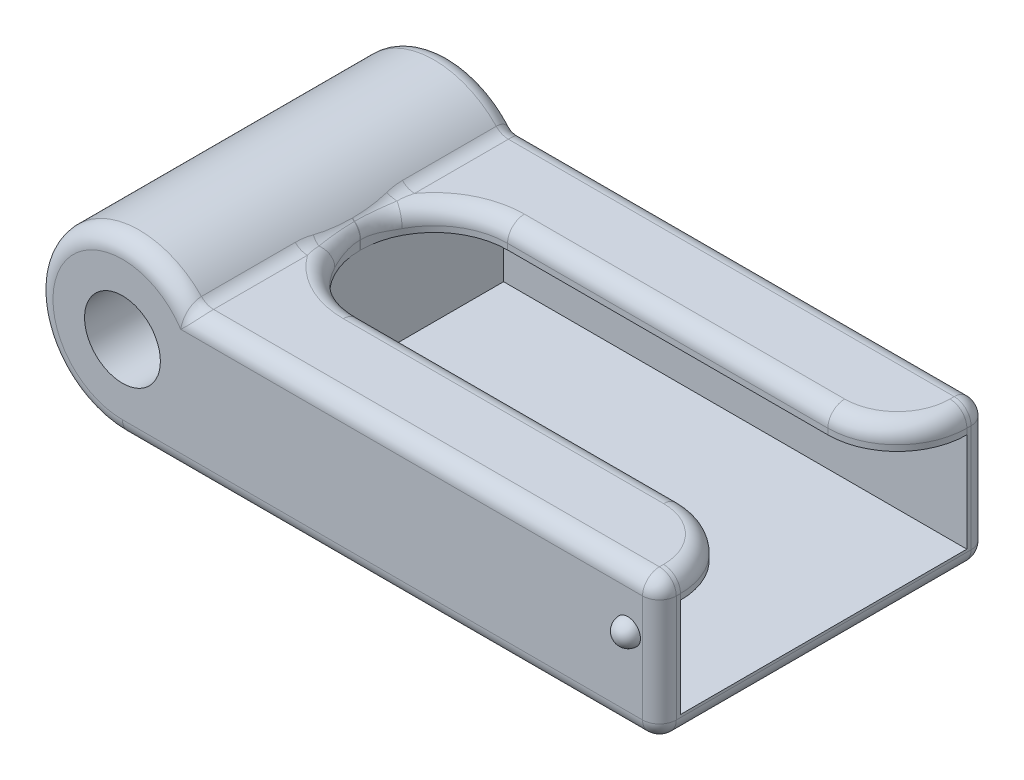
ISO-10303-21;
HEADER;
FILE_DESCRIPTION(('STEP AP214'),'2;1');
FILE_NAME('part.step','',(''),(''),'','','');
FILE_SCHEMA(('AUTOMOTIVE_DESIGN { 1 0 10303 214 1 1 1 1 }'));
ENDSEC;
DATA;
#1=APPLICATION_CONTEXT('core data for automotive mechanical design processes');
#2=APPLICATION_PROTOCOL_DEFINITION('international standard','automotive_design',2000,#1);
#3=PRODUCT_CONTEXT('',#1,'mechanical');
#4=PRODUCT('Part','Part','',(#3));
#5=PRODUCT_RELATED_PRODUCT_CATEGORY('part','',(#4));
#6=PRODUCT_DEFINITION_FORMATION('','',#4);
#7=PRODUCT_DEFINITION_CONTEXT('part definition',#1,'design');
#8=PRODUCT_DEFINITION('design','',#6,#7);
#9=PRODUCT_DEFINITION_SHAPE('','',#8);
#10=(LENGTH_UNIT() NAMED_UNIT(*) SI_UNIT(.MILLI.,.METRE.));
#11=(NAMED_UNIT(*) PLANE_ANGLE_UNIT() SI_UNIT($,.RADIAN.));
#12=(NAMED_UNIT(*) SI_UNIT($,.STERADIAN.) SOLID_ANGLE_UNIT());
#13=UNCERTAINTY_MEASURE_WITH_UNIT(LENGTH_MEASURE(1.E-05),#10,'distance_accuracy_value','');
#14=(GEOMETRIC_REPRESENTATION_CONTEXT(3) GLOBAL_UNCERTAINTY_ASSIGNED_CONTEXT((#13)) GLOBAL_UNIT_ASSIGNED_CONTEXT((#10,
#11,#12)) REPRESENTATION_CONTEXT('',''));
#15=CARTESIAN_POINT('',(0.,0.,0.));
#16=DIRECTION('',(0.,0.,1.));
#17=DIRECTION('',(1.,0.,0.));
#18=AXIS2_PLACEMENT_3D('',#15,#16,#17);
#19=CARTESIAN_POINT('',(25.5,2.6,7.8));
#20=DIRECTION('',(0.,-1.,0.));
#21=DIRECTION('',(1.,0.,0.));
#22=AXIS2_PLACEMENT_3D('',#19,#20,#21);
#23=PLANE('',#22);
#24=DIRECTION('',(-1.,0.,0.));
#25=VECTOR('',#24,1.);
#26=CARTESIAN_POINT('',(25.5,2.6,-7.));
#27=LINE('',#26,#25);
#28=CARTESIAN_POINT('',(24.7,2.6,-7.));
#29=VERTEX_POINT('',#28);
#30=CARTESIAN_POINT('',(3.52845575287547,2.6,-7.));
#31=VERTEX_POINT('',#30);
#32=EDGE_CURVE('E346',#29,#31,#27,.T.);
#33=ORIENTED_EDGE('',*,*,#32,.T.);
#34=DIRECTION('',(0.,0.,1.));
#35=VECTOR('',#34,1.);
#36=CARTESIAN_POINT('',(3.52845575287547,2.6,-1.96269697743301));
#37=LINE('',#36,#35);
#38=CARTESIAN_POINT('',(3.52845575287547,2.6,-2.54412932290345));
#39=VERTEX_POINT('',#38);
#40=EDGE_CURVE('E55',#31,#39,#37,.T.);
#41=ORIENTED_EDGE('',*,*,#40,.T.);
#42=CARTESIAN_POINT('',(6.99,2.6,-0.00999999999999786));
#43=DIRECTION('',(0.,-1.,0.));
#44=DIRECTION('',(1.,0.,0.));
#45=AXIS2_PLACEMENT_3D('',#42,#43,#44);
#46=CIRCLE('',#45,4.29);
#47=CARTESIAN_POINT('',(6.99000000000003,2.6,-4.3));
#48=VERTEX_POINT('',#47);
#49=EDGE_CURVE('E354',#39,#48,#46,.T.);
#50=ORIENTED_EDGE('',*,*,#49,.T.);
#51=DIRECTION('',(-1.,0.,0.));
#52=VECTOR('',#51,1.);
#53=CARTESIAN_POINT('',(25.5,2.6,-4.3));
#54=LINE('',#53,#52);
#55=CARTESIAN_POINT('',(22.2,2.6,-4.3));
#56=VERTEX_POINT('',#55);
#57=EDGE_CURVE('E352',#48,#56,#54,.F.);
#58=ORIENTED_EDGE('',*,*,#57,.T.);
#59=CARTESIAN_POINT('',(22.2,2.6,-6.8));
#60=DIRECTION('',(0.,-1.,0.));
#61=DIRECTION('',(1.,0.,0.));
#62=AXIS2_PLACEMENT_3D('',#59,#60,#61);
#63=CIRCLE('',#62,2.5);
#64=CARTESIAN_POINT('',(24.7,2.6,-6.8));
#65=VERTEX_POINT('',#64);
#66=EDGE_CURVE('E350',#56,#65,#63,.F.);
#67=ORIENTED_EDGE('',*,*,#66,.T.);
#68=DIRECTION('',(0.,0.,-1.));
#69=VECTOR('',#68,1.);
#70=CARTESIAN_POINT('',(24.7,2.6,7.8));
#71=LINE('',#70,#69);
#72=EDGE_CURVE('E348',#65,#29,#71,.T.);
#73=ORIENTED_EDGE('',*,*,#72,.T.);
#74=EDGE_LOOP('',(#33,#41,#50,#58,#67,#73));
#75=FACE_BOUND('',#74,.T.);
#76=ADVANCED_FACE('F40',(#75),#23,.F.);
#77=CARTESIAN_POINT('',(3.5,1.52535265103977,6.8));
#78=DIRECTION('',(0.,1.,0.));
#79=DIRECTION('',(0.,0.,1.));
#80=AXIS2_PLACEMENT_3D('',#77,#78,#79);
#81=PLANE('',#80);
#82=DIRECTION('',(1.,0.,0.));
#83=VECTOR('',#82,1.);
#84=CARTESIAN_POINT('',(3.5,1.52535265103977,-6.8));
#85=LINE('',#84,#83);
#86=CARTESIAN_POINT('',(3.5,1.52535265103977,-6.8));
#87=VERTEX_POINT('',#86);
#88=CARTESIAN_POINT('',(25.5,1.52535265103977,-6.8));
#89=VERTEX_POINT('',#88);
#90=EDGE_CURVE('E291',#87,#89,#85,.T.);
#91=ORIENTED_EDGE('',*,*,#90,.T.);
#92=CARTESIAN_POINT('',(22.2,1.52535265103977,-6.8));
#93=DIRECTION('',(0.,1.,0.));
#94=DIRECTION('',(0.,0.,1.));
#95=AXIS2_PLACEMENT_3D('',#92,#93,#94);
#96=CIRCLE('',#95,3.3);
#97=CARTESIAN_POINT('',(22.2,1.52535265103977,-3.5));
#98=VERTEX_POINT('',#97);
#99=EDGE_CURVE('E329',#89,#98,#96,.F.);
#100=ORIENTED_EDGE('',*,*,#99,.T.);
#101=DIRECTION('',(-1.,0.,0.));
#102=VECTOR('',#101,1.);
#103=CARTESIAN_POINT('',(3.49999999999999,1.52535265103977,-3.5));
#104=LINE('',#103,#102);
#105=CARTESIAN_POINT('',(6.99000000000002,1.52535265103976,-3.5));
#106=VERTEX_POINT('',#105);
#107=EDGE_CURVE('E318',#98,#106,#104,.T.);
#108=ORIENTED_EDGE('',*,*,#107,.T.);
#109=CARTESIAN_POINT('',(6.99,1.52535265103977,-0.00999999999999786));
#110=DIRECTION('',(0.,1.,0.));
#111=DIRECTION('',(0.,0.,1.));
#112=AXIS2_PLACEMENT_3D('',#109,#110,#111);
#113=CIRCLE('',#112,3.49);
#114=CARTESIAN_POINT('',(3.5,1.52535265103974,-0.0099999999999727));
#115=VERTEX_POINT('',#114);
#116=EDGE_CURVE('E262',#106,#115,#113,.T.);
#117=ORIENTED_EDGE('',*,*,#116,.T.);
#118=DIRECTION('',(0.,0.,1.));
#119=VECTOR('',#118,1.);
#120=CARTESIAN_POINT('',(3.5,1.52535265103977,6.8));
#121=LINE('',#120,#119);
#122=EDGE_CURVE('E278',#87,#115,#121,.T.);
#123=ORIENTED_EDGE('',*,*,#122,.F.);
#124=EDGE_LOOP('',(#91,#100,#108,#117,#123));
#125=FACE_BOUND('',#124,.T.);
#126=ADVANCED_FACE('F887',(#125),#81,.F.);
#127=CARTESIAN_POINT('',(0.,0.,7.8));
#128=DIRECTION('',(0.,0.,1.));
#129=DIRECTION('',(1.,0.,0.));
#130=AXIS2_PLACEMENT_3D('',#127,#128,#129);
#131=PLANE('',#130);
#132=CARTESIAN_POINT('',(24.,0.,7.8));
#133=DIRECTION('',(0.,0.,1.));
#134=DIRECTION('',(1.,0.,0.));
#135=AXIS2_PLACEMENT_3D('',#132,#133,#134);
#136=CIRCLE('',#135,0.599666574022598);
#137=CARTESIAN_POINT('',(24.5996665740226,0.,7.8));
#138=VERTEX_POINT('',#137);
#139=EDGE_CURVE('E11',#138,#138,#136,.T.);
#140=ORIENTED_EDGE('',*,*,#139,.F.);
#141=EDGE_LOOP('',(#140));
#142=FACE_BOUND('',#141,.T.);
#143=CARTESIAN_POINT('',(0.,0.,7.8));
#144=DIRECTION('',(0.,0.,1.));
#145=DIRECTION('',(1.,0.,0.));
#146=AXIS2_PLACEMENT_3D('',#143,#144,#145);
#147=CIRCLE('',#146,3.3);
#148=CARTESIAN_POINT('',(2.76586333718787,1.8,7.8));
#149=VERTEX_POINT('',#148);
#150=CARTESIAN_POINT('',(0.,-3.3,7.8));
#151=VERTEX_POINT('',#150);
#152=EDGE_CURVE('E925',#149,#151,#147,.T.);
#153=ORIENTED_EDGE('',*,*,#152,.T.);
#154=DIRECTION('',(1.,0.,0.));
#155=VECTOR('',#154,1.);
#156=CARTESIAN_POINT('',(25.5,-3.3,7.8));
#157=LINE('',#156,#155);
#158=CARTESIAN_POINT('',(24.7,-3.3,7.8));
#159=VERTEX_POINT('',#158);
#160=EDGE_CURVE('E932',#151,#159,#157,.T.);
#161=ORIENTED_EDGE('',*,*,#160,.T.);
#162=DIRECTION('',(0.,1.,0.));
#163=VECTOR('',#162,1.);
#164=CARTESIAN_POINT('',(24.7,2.6,7.8));
#165=LINE('',#164,#163);
#166=CARTESIAN_POINT('',(24.7,1.8,7.8));
#167=VERTEX_POINT('',#166);
#168=EDGE_CURVE('E927',#159,#167,#165,.T.);
#169=ORIENTED_EDGE('',*,*,#168,.T.);
#170=DIRECTION('',(-1.,0.,0.));
#171=VECTOR('',#170,1.);
#172=CARTESIAN_POINT('',(3.17017349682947,1.8,7.8));
#173=LINE('',#172,#171);
#174=EDGE_CURVE('E919',#167,#149,#173,.T.);
#175=ORIENTED_EDGE('',*,*,#174,.T.);
#176=EDGE_LOOP('',(#153,#161,#169,#175));
#177=FACE_BOUND('',#176,.T.);
#178=CARTESIAN_POINT('',(0.,0.,7.8));
#179=DIRECTION('',(0.,0.,1.));
#180=DIRECTION('',(1.,0.,0.));
#181=AXIS2_PLACEMENT_3D('',#178,#179,#180);
#182=CIRCLE('',#181,1.8);
#183=CARTESIAN_POINT('',(1.8,0.,7.8));
#184=VERTEX_POINT('',#183);
#185=EDGE_CURVE('E308',#184,#184,#182,.T.);
#186=ORIENTED_EDGE('',*,*,#185,.F.);
#187=EDGE_LOOP('',(#186));
#188=FACE_BOUND('',#187,.T.);
#189=ADVANCED_FACE('F892',(#142,#177,#188),#131,.T.);
#190=CARTESIAN_POINT('',(0.,0.,-7.8));
#191=DIRECTION('',(0.,0.,1.));
#192=DIRECTION('',(1.,0.,0.));
#193=AXIS2_PLACEMENT_3D('',#190,#191,#192);
#194=PLANE('',#193);
#195=CARTESIAN_POINT('',(24.,0.,-7.8));
#196=DIRECTION('',(0.,0.,1.));
#197=DIRECTION('',(1.,0.,0.));
#198=AXIS2_PLACEMENT_3D('',#195,#196,#197);
#199=CIRCLE('',#198,0.6);
#200=CARTESIAN_POINT('',(24.6,0.,-7.8));
#201=VERTEX_POINT('',#200);
#202=EDGE_CURVE('E641',#201,#201,#199,.T.);
#203=ORIENTED_EDGE('',*,*,#202,.T.);
#204=EDGE_LOOP('',(#203));
#205=FACE_BOUND('',#204,.T.);
#206=DIRECTION('',(0.,1.,0.));
#207=VECTOR('',#206,1.);
#208=CARTESIAN_POINT('',(24.7,0.,-7.8));
#209=LINE('',#208,#207);
#210=CARTESIAN_POINT('',(24.7,1.8,-7.8));
#211=VERTEX_POINT('',#210);
#212=CARTESIAN_POINT('',(24.7,-3.3,-7.8));
#213=VERTEX_POINT('',#212);
#214=EDGE_CURVE('E760',#211,#213,#209,.F.);
#215=ORIENTED_EDGE('',*,*,#214,.T.);
#216=DIRECTION('',(1.,0.,0.));
#217=VECTOR('',#216,1.);
#218=CARTESIAN_POINT('',(0.,-3.3,-7.8));
#219=LINE('',#218,#217);
#220=CARTESIAN_POINT('',(0.,-3.3,-7.8));
#221=VERTEX_POINT('',#220);
#222=EDGE_CURVE('E765',#213,#221,#219,.F.);
#223=ORIENTED_EDGE('',*,*,#222,.T.);
#224=CARTESIAN_POINT('',(0.,0.,-7.8));
#225=DIRECTION('',(0.,0.,1.));
#226=DIRECTION('',(1.,0.,0.));
#227=AXIS2_PLACEMENT_3D('',#224,#225,#226);
#228=CIRCLE('',#227,3.3);
#229=CARTESIAN_POINT('',(2.76586333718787,1.8,-7.8));
#230=VERTEX_POINT('',#229);
#231=EDGE_CURVE('E749',#221,#230,#228,.F.);
#232=ORIENTED_EDGE('',*,*,#231,.T.);
#233=DIRECTION('',(-1.,0.,0.));
#234=VECTOR('',#233,1.);
#235=CARTESIAN_POINT('',(0.,1.8,-7.8));
#236=LINE('',#235,#234);
#237=EDGE_CURVE('E755',#230,#211,#236,.F.);
#238=ORIENTED_EDGE('',*,*,#237,.T.);
#239=EDGE_LOOP('',(#215,#223,#232,#238));
#240=FACE_BOUND('',#239,.T.);
#241=CARTESIAN_POINT('',(0.,0.,-7.8));
#242=DIRECTION('',(0.,0.,1.));
#243=DIRECTION('',(1.,0.,0.));
#244=AXIS2_PLACEMENT_3D('',#241,#242,#243);
#245=CIRCLE('',#244,1.8);
#246=CARTESIAN_POINT('',(1.8,0.,-7.8));
#247=VERTEX_POINT('',#246);
#248=EDGE_CURVE('E302',#247,#247,#245,.T.);
#249=ORIENTED_EDGE('',*,*,#248,.T.);
#250=EDGE_LOOP('',(#249));
#251=FACE_BOUND('',#250,.T.);
#252=ADVANCED_FACE('F762',(#205,#240,#251),#194,.F.);
#253=CARTESIAN_POINT('',(0.,0.,7.8));
#254=DIRECTION('',(0.,0.,-1.));
#255=DIRECTION('',(-1.,0.,0.));
#256=AXIS2_PLACEMENT_3D('',#253,#254,#255);
#257=CYLINDRICAL_SURFACE('',#256,4.1);
#258=CARTESIAN_POINT('',(0.,0.,7.));
#259=DIRECTION('',(0.,0.,1.));
#260=DIRECTION('',(1.,0.,0.));
#261=AXIS2_PLACEMENT_3D('',#258,#259,#260);
#262=CIRCLE('',#261,4.1);
#263=CARTESIAN_POINT('',(0.,-4.1,7.));
#264=VERTEX_POINT('',#263);
#265=CARTESIAN_POINT('',(2.95238134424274,2.84489795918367,7.));
#266=VERTEX_POINT('',#265);
#267=EDGE_CURVE('E771',#264,#266,#262,.F.);
#268=ORIENTED_EDGE('',*,*,#267,.T.);
#269=DIRECTION('',(0.,0.,-1.));
#270=VECTOR('',#269,1.);
#271=CARTESIAN_POINT('',(2.95238134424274,2.84489795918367,7.8));
#272=LINE('',#271,#270);
#273=CARTESIAN_POINT('',(2.95238134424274,2.84489795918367,2.54412932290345));
#274=VERTEX_POINT('',#273);
#275=EDGE_CURVE('E710',#266,#274,#272,.T.);
#276=ORIENTED_EDGE('',*,*,#275,.T.);
#277=CARTESIAN_POINT('',(3.06110773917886,2.72756657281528,3.66427078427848));
#278=CARTESIAN_POINT('',(3.38956939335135,2.3589389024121,3.49152255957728));
#279=CARTESIAN_POINT('',(3.87905149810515,2.52988734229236,3.42224581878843));
#280=CARTESIAN_POINT('',(3.04365368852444,2.74713281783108,3.57468636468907));
#281=CARTESIAN_POINT('',(3.36687524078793,2.38911179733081,3.42228523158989));
#282=CARTESIAN_POINT('',(3.84433775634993,2.54157936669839,3.35531376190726));
#283=CARTESIAN_POINT('',(3.02812303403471,2.76420578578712,3.48379460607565));
#284=CARTESIAN_POINT('',(3.34509728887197,2.41703671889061,3.34945503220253));
#285=CARTESIAN_POINT('',(3.81076799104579,2.55178150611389,3.28670149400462));
#286=CARTESIAN_POINT('',(3.00117358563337,2.79345400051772,3.29999384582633));
#287=CARTESIAN_POINT('',(3.30455404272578,2.46756536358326,3.19913407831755));
#288=CARTESIAN_POINT('',(3.74627188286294,2.56925909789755,3.14633460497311));
#289=CARTESIAN_POINT('',(2.98975657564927,2.80562712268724,3.20708398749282));
#290=CARTESIAN_POINT('',(3.28570190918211,2.49030401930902,3.12159122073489));
#291=CARTESIAN_POINT('',(3.71534669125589,2.57653328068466,3.07457863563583));
#292=CARTESIAN_POINT('',(2.97127366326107,2.82519150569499,3.01950288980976));
#293=CARTESIAN_POINT('',(3.25148689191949,2.53053657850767,2.96248075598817));
#294=CARTESIAN_POINT('',(3.65639382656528,2.58822419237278,2.92787212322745));
#295=CARTESIAN_POINT('',(2.96422753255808,2.83256104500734,2.92482561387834));
#296=CARTESIAN_POINT('',(3.23605528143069,2.54812395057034,2.88081798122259));
#297=CARTESIAN_POINT('',(3.62837979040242,2.59262794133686,2.85290868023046));
#298=CARTESIAN_POINT('',(2.95478149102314,2.84241315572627,2.73481597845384));
#299=CARTESIAN_POINT('',(3.20921351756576,2.57794768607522,2.7147115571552));
#300=CARTESIAN_POINT('',(3.57577326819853,2.59851517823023,2.70039613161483));
#301=CARTESIAN_POINT('',(2.95238010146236,2.84489728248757,2.63948383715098));
#302=CARTESIAN_POINT('',(3.19772721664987,2.59028094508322,2.63018180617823));
#303=CARTESIAN_POINT('',(3.55117969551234,2.59999959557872,2.62284785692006));
#304=CARTESIAN_POINT('',(2.95238310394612,2.84489891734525,2.4091129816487));
#305=CARTESIAN_POINT('',(3.17529711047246,2.61356256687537,2.42404639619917));
#306=CARTESIAN_POINT('',(3.49627999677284,2.60000057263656,2.43266854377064));
#307=CARTESIAN_POINT('',(2.95720187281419,2.83992083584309,2.27405178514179));
#308=CARTESIAN_POINT('',(3.16633155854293,2.62206802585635,2.30068325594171));
#309=CARTESIAN_POINT('',(3.46785263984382,2.5970258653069,2.31886152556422));
#310=CARTESIAN_POINT('',(2.97667131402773,2.819509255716,2.00648440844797));
#311=CARTESIAN_POINT('',(3.15790451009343,2.62808909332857,2.05281520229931));
#312=CARTESIAN_POINT('',(3.41949639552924,2.58482870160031,2.08807073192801));
#313=CARTESIAN_POINT('',(2.99128811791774,2.80411177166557,1.87397103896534));
#314=CARTESIAN_POINT('',(3.15826952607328,2.62580099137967,1.92804239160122));
#315=CARTESIAN_POINT('',(3.39953861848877,2.57562776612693,1.97109922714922));
#316=CARTESIAN_POINT('',(3.02054813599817,2.77245102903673,1.67853336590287));
#317=CARTESIAN_POINT('',(3.16618594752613,2.61373368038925,1.74105409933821));
#318=CARTESIAN_POINT('',(3.37650072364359,2.55670854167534,1.79411460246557));
#319=CARTESIAN_POINT('',(3.03155660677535,2.76043374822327,1.61380286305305));
#320=CARTESIAN_POINT('',(3.17003903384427,2.60828941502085,1.67882733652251));
#321=CARTESIAN_POINT('',(3.36996443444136,2.54952748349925,1.73473158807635));
#322=CARTESIAN_POINT('',(3.05601550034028,2.73333234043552,1.48596260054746));
#323=CARTESIAN_POINT('',(3.18023314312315,2.59438879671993,1.5550897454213));
#324=CARTESIAN_POINT('',(3.35934630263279,2.53333273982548,1.61587614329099));
#325=CARTESIAN_POINT('',(3.06946453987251,2.71824995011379,1.42285194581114));
#326=CARTESIAN_POINT('',(3.18656273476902,2.58594586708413,1.49354179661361));
#327=CARTESIAN_POINT('',(3.35526307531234,2.52432009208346,1.55640378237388));
#328=CARTESIAN_POINT('',(3.09892950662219,2.68461178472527,1.29832548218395));
#329=CARTESIAN_POINT('',(3.20182357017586,2.56575921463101,1.37128157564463));
#330=CARTESIAN_POINT('',(3.34968948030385,2.50421923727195,1.43743759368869));
#331=CARTESIAN_POINT('',(3.11496173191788,2.66603382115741,1.23692354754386));
#332=CARTESIAN_POINT('',(3.21076422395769,2.55400332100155,1.31053655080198));
#333=CARTESIAN_POINT('',(3.34821633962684,2.49311777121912,1.37794619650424));
#334=CARTESIAN_POINT('',(3.14098171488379,2.63522569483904,1.14700979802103));
#335=CARTESIAN_POINT('',(3.22623396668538,2.53358718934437,1.2209208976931));
#336=CARTESIAN_POINT('',(3.34818098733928,2.47470803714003,1.2896373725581));
#337=CARTESIAN_POINT('',(3.14999347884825,2.62445408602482,1.11737536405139));
#338=CARTESIAN_POINT('',(3.23173135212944,2.52632118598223,1.19130784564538));
#339=CARTESIAN_POINT('',(3.34853301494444,2.46827134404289,1.26032746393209));
#340=CARTESIAN_POINT('',(3.16871651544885,2.60181647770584,1.05901413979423));
#341=CARTESIAN_POINT('',(3.24344611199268,2.51077703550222,1.13280574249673));
#342=CARTESIAN_POINT('',(3.35001879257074,2.45474399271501,1.20222578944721));
#343=CARTESIAN_POINT('',(3.17842816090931,2.589949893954,1.03028784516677));
#344=CARTESIAN_POINT('',(3.2496634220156,2.50249904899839,1.10391129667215));
#345=CARTESIAN_POINT('',(3.3511529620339,2.44765298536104,1.17343431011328));
#346=CARTESIAN_POINT('',(3.18850765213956,2.57748306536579,1.00210930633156));
#347=CARTESIAN_POINT('',(3.2562641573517,2.49366403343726,1.07545819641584));
#348=CARTESIAN_POINT('',(3.35270509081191,2.44020329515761,1.14501198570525));
#349=(BOUNDED_SURFACE() B_SPLINE_SURFACE(3,2,((#277,#278,#279),(#280,#281,#282),(#283,#284,
#285),(#286,#287,#288),(#289,#290,#291),(#292,#293,#294),(#295,#296,#297),(#298,#299,#300),
(#301,#302,#303),(#304,#305,#306),(#307,#308,#309),(#310,#311,#312),(#313,#314,#315),(#316,#317,
#318),(#319,#320,#321),(#322,#323,#324),(#325,#326,#327),(#328,#329,#330),(#331,#332,#333),
(#334,#335,#336),(#337,#338,#339),(#340,#341,#342),(#343,#344,#345),(#346,#347,#348)),
.UNSPECIFIED.,.F.,.F.,.F.) B_SPLINE_SURFACE_WITH_KNOTS((4,2,2,2,2,2,2,2,2,2,2,4),(3,3),(0.,
0.284629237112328,0.569381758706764,0.855413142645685,1.14135344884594,1.54622797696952,
1.94971016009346,2.15235325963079,2.35488186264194,2.55874227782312,2.66087341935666,
2.76305937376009),(0.,1.),
.UNSPECIFIED.) GEOMETRIC_REPRESENTATION_ITEM() RATIONAL_B_SPLINE_SURFACE(((1.,0.836966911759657,
1.),(1.,0.845390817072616,1.),(1.,0.853418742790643,1.),(1.,0.868718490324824,1.),(1.,
0.875989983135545,1.),(1.,0.889836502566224,1.),(1.,0.896408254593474,1.),(1.,0.908857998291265,
1.),(1.,0.914736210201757,1.),(1.,0.928160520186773,1.),(1.,0.935383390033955,1.),(1.,
0.948639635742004,1.),(1.,0.954677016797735,1.),(1.,0.962941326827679,1.),(1.,0.965569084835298,
1.),(1.,0.97056007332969,1.),(1.,0.972923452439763,1.),(1.,0.977401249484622,1.),(1.,
0.9795139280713,1.),(1.,0.982474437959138,1.),(1.,0.98342735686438,1.),(1.,0.985259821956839,
1.),(1.,0.986139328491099,1.),(1.,0.986980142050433,1.))) REPRESENTATION_ITEM('') SURFACE());
#350=CARTESIAN_POINT('',(3.06110773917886,2.72756657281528,3.66427078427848));
#351=CARTESIAN_POINT('',(3.04365368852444,2.74713281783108,3.57468636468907));
#352=CARTESIAN_POINT('',(3.02812303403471,2.76420578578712,3.48379460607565));
#353=CARTESIAN_POINT('',(3.00117358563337,2.79345400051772,3.29999384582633));
#354=CARTESIAN_POINT('',(2.98975657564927,2.80562712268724,3.20708398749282));
#355=CARTESIAN_POINT('',(2.97127366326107,2.82519150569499,3.01950288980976));
#356=CARTESIAN_POINT('',(2.96422753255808,2.83256104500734,2.92482561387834));
#357=CARTESIAN_POINT('',(2.95478149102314,2.84241315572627,2.73481597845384));
#358=CARTESIAN_POINT('',(2.95238010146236,2.84489728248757,2.63948383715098));
#359=CARTESIAN_POINT('',(2.95238310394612,2.84489891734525,2.4091129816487));
#360=CARTESIAN_POINT('',(2.95720187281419,2.83992083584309,2.27405178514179));
#361=CARTESIAN_POINT('',(2.97667131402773,2.819509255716,2.00648440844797));
#362=CARTESIAN_POINT('',(2.99128811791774,2.80411177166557,1.87397103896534));
#363=CARTESIAN_POINT('',(3.02054813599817,2.77245102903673,1.67853336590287));
#364=CARTESIAN_POINT('',(3.03155660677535,2.76043374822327,1.61380286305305));
#365=CARTESIAN_POINT('',(3.05601550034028,2.73333234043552,1.48596260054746));
#366=CARTESIAN_POINT('',(3.06946453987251,2.71824995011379,1.42285194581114));
#367=CARTESIAN_POINT('',(3.09892950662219,2.68461178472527,1.29832548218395));
#368=CARTESIAN_POINT('',(3.11496173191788,2.66603382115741,1.23692354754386));
#369=CARTESIAN_POINT('',(3.14098171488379,2.63522569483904,1.14700979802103));
#370=CARTESIAN_POINT('',(3.14999347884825,2.62445408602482,1.11737536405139));
#371=CARTESIAN_POINT('',(3.16871651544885,2.60181647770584,1.05901413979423));
#372=CARTESIAN_POINT('',(3.17842816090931,2.589949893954,1.03028784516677));
#373=CARTESIAN_POINT('',(3.18850765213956,2.57748306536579,1.00210930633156));
#374=B_SPLINE_CURVE_WITH_KNOTS('',3,(#350,#351,#352,#353,#354,#355,#356,#357,#358,#359,#360,
#361,#362,#363,#364,#365,#366,#367,#368,#369,#370,#371,#372,#373),.UNSPECIFIED.,.F.,.F.,(4,2,2,
2,2,2,2,2,2,2,2,4),(0.,0.284629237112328,0.569381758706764,0.855413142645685,1.14135344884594,
1.54622797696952,1.94971016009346,2.15235325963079,2.35488186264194,2.55874227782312,
2.66087341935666,2.76305937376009),.UNSPECIFIED.);
#375=CARTESIAN_POINT('',(3.01076576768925,2.78303602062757,1.74387315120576));
#376=VERTEX_POINT('',#375);
#377=EDGE_CURVE('E705',#274,#376,#374,.T.);
#378=ORIENTED_EDGE('',*,*,#377,.T.);
#379=CARTESIAN_POINT('',(3.17017349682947,2.6,-0.248769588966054));
#380=CARTESIAN_POINT('',(3.50742163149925,2.36115615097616,-0.21816815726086));
#381=CARTESIAN_POINT('',(3.50635481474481,1.9471436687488,-0.200514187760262));
#382=CARTESIAN_POINT('',(3.17017349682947,2.6,-0.188594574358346));
#383=CARTESIAN_POINT('',(3.50396301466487,2.36080000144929,-0.165291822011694));
#384=CARTESIAN_POINT('',(3.50339460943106,1.94974473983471,-0.151560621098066));
#385=CARTESIAN_POINT('',(3.17017349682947,2.6,-0.128303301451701));
#386=CARTESIAN_POINT('',(3.50171425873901,2.36057501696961,-0.112066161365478));
#387=CARTESIAN_POINT('',(3.50146823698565,1.9514445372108,-0.102512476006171));
#388=CARTESIAN_POINT('',(3.17017349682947,2.6,-0.00766367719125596));
#389=CARTESIAN_POINT('',(3.49963559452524,2.36036904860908,-0.0056218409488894));
#390=CARTESIAN_POINT('',(3.49968508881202,1.95302013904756,-0.00436975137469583));
#391=CARTESIAN_POINT('',(3.17017349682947,2.6,0.0526846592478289));
#392=CARTESIAN_POINT('',(3.49980054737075,2.36038755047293,0.0477150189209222));
#393=CARTESIAN_POINT('',(3.49982787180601,1.95289633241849,0.0447248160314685));
#394=CARTESIAN_POINT('',(3.17017349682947,2.6,0.173118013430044));
#395=CARTESIAN_POINT('',(3.50254965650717,2.36065043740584,0.153956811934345));
#396=CARTESIAN_POINT('',(3.50218036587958,1.95080737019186,0.142699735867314));
#397=CARTESIAN_POINT('',(3.17017349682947,2.6,0.233203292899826));
#398=CARTESIAN_POINT('',(3.50513305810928,2.36089475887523,0.206980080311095));
#399=CARTESIAN_POINT('',(3.50438422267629,1.94884742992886,0.191580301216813));
#400=CARTESIAN_POINT('',(3.17017349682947,2.6,0.353125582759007));
#401=CARTESIAN_POINT('',(3.51265148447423,2.36174476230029,0.312468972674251));
#402=CARTESIAN_POINT('',(3.51083743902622,1.94325851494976,0.289139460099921));
#403=CARTESIAN_POINT('',(3.17017349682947,2.6,0.412962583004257));
#404=CARTESIAN_POINT('',(3.5176031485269,2.36235266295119,0.365049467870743));
#405=CARTESIAN_POINT('',(3.51508688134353,1.93962947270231,0.337818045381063));
#406=CARTESIAN_POINT('',(3.17017349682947,2.6,0.58908166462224));
#407=CARTESIAN_POINT('',(3.53565695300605,2.36502366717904,0.519505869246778));
#408=CARTESIAN_POINT('',(3.53062913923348,1.92682742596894,0.481094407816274));
#409=CARTESIAN_POINT('',(3.17017349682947,2.6,0.704858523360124));
#410=CARTESIAN_POINT('',(3.55209295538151,2.36793936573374,0.620455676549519));
#411=CARTESIAN_POINT('',(3.54477576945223,1.91566583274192,0.575281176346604));
#412=CARTESIAN_POINT('',(3.17017349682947,2.6,0.934352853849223));
#413=CARTESIAN_POINT('',(3.59262089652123,2.37860436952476,0.817044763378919));
#414=CARTESIAN_POINT('',(3.58064731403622,1.89080232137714,0.761979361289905));
#415=CARTESIAN_POINT('',(3.17017349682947,2.6,1.0480687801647));
#416=CARTESIAN_POINT('',(3.61704942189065,2.38650190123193,0.913418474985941));
#417=CARTESIAN_POINT('',(3.60237768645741,1.8770985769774,0.854489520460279));
#418=CARTESIAN_POINT('',(3.17017349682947,2.6,1.33030903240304));
#419=CARTESIAN_POINT('',(3.68674286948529,2.41719475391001,1.14774585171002));
#420=CARTESIAN_POINT('',(3.66630815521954,1.84367069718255,1.08409755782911));
#421=CARTESIAN_POINT('',(3.17017349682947,2.6,1.49733937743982));
#422=CARTESIAN_POINT('',(3.73680795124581,2.44627242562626,1.28109176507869));
#423=CARTESIAN_POINT('',(3.71329929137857,1.82442343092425,1.2199800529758));
#424=CARTESIAN_POINT('',(3.17017349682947,2.6,1.74377201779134));
#425=CARTESIAN_POINT('',(3.81317621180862,2.51426524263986,1.45704323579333));
#426=CARTESIAN_POINT('',(3.79687062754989,1.80617157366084,1.42045788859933));
#427=CARTESIAN_POINT('',(3.17017349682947,2.6,1.82596995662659));
#428=CARTESIAN_POINT('',(3.84001905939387,2.54261171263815,1.51372380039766));
#429=CARTESIAN_POINT('',(3.82725176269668,1.80186865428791,1.48732754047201));
#430=CARTESIAN_POINT('',(3.17017349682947,2.6,1.98813826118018));
#431=CARTESIAN_POINT('',(3.89123160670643,2.61030656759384,1.61659751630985));
#432=CARTESIAN_POINT('',(3.89228416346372,1.79910730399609,1.61925466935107));
#433=CARTESIAN_POINT('',(3.17017349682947,2.6,2.068101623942));
#434=CARTESIAN_POINT('',(3.91562952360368,2.65039091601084,1.66257713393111));
#435=CARTESIAN_POINT('',(3.92694733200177,1.80066553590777,1.68430644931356));
#436=CARTESIAN_POINT('',(3.17017349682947,2.6,2.14657807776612));
#437=CARTESIAN_POINT('',(3.93589135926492,2.69620466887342,1.69985844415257));
#438=CARTESIAN_POINT('',(3.96362602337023,1.80624036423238,1.74814859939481));
#439=(BOUNDED_SURFACE() B_SPLINE_SURFACE(3,2,((#379,#380,#381),(#382,#383,#384),(#385,#386,
#387),(#388,#389,#390),(#391,#392,#393),(#394,#395,#396),(#397,#398,#399),(#400,#401,#402),
(#403,#404,#405),(#406,#407,#408),(#409,#410,#411),(#412,#413,#414),(#415,#416,#417),(#418,#419,
#420),(#421,#422,#423),(#424,#425,#426),(#427,#428,#429),(#430,#431,#432),(#433,#434,#435),
(#436,#437,#438)),.UNSPECIFIED.,.F.,.F.,.F.) B_SPLINE_SURFACE_WITH_KNOTS((4,2,2,2,2,2,2,2,2,4),
(3,3),(0.,0.181003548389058,0.361968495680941,0.542420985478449,0.722880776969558,
1.07517101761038,1.42771532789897,1.95929791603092,2.23013894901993,2.50175054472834),(0.,1.),
.UNSPECIFIED.) GEOMETRIC_REPRESENTATION_ITEM() RATIONAL_B_SPLINE_SURFACE(((1.,0.887947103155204,
1.),(1.,0.889363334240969,1.),(1.,0.890284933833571,1.),(1.,0.891138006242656,1.),(1.,
0.891069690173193,1.),(1.,0.889944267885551,1.),(1.,0.888889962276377,1.),(1.,0.885802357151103,
1.),(1.,0.883769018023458,1.),(1.,0.876330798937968,1.),(1.,0.869559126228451,1.),(1.,
0.852375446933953,1.),(1.,0.841960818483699,1.),(1.,0.81128948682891,1.),(1.,0.788720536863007,
1.),(1.,0.748462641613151,1.),(1.,0.733809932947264,1.),(1.,0.702380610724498,1.),(1.,
0.68559807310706,1.),(1.,0.667795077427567,1.))) REPRESENTATION_ITEM('') SURFACE());
#440=CARTESIAN_POINT('',(2.9919013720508,2.80330629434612,1.85952943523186));
#441=CARTESIAN_POINT('',(3.16596787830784,2.61752929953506,1.93838581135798));
#442=CARTESIAN_POINT('',(3.4218949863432,2.57815720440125,2.00148669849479));
#443=CARTESIAN_POINT('',(2.99528786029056,2.79969195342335,1.84036801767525));
#444=CARTESIAN_POINT('',(3.16540463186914,2.61768197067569,1.91536592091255));
#445=CARTESIAN_POINT('',(3.41477975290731,2.57489315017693,1.97596005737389));
#446=CARTESIAN_POINT('',(2.99854736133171,2.79620012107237,1.82114236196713));
#447=CARTESIAN_POINT('',(3.16494706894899,2.61775163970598,1.89262289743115));
#448=CARTESIAN_POINT('',(3.40815995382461,2.5720613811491,1.95093700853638));
#449=CARTESIAN_POINT('',(3.0048293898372,2.78944823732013,1.78258496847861));
#450=CARTESIAN_POINT('',(3.16418359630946,2.61778252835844,1.84768285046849));
#451=CARTESIAN_POINT('',(3.39572229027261,2.56708483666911,1.90172034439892));
#452=CARTESIAN_POINT('',(3.00785199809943,2.78618810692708,1.76325326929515));
#453=CARTESIAN_POINT('',(3.16387677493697,2.61774422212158,1.82546798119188));
#454=CARTESIAN_POINT('',(3.38990415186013,2.56493982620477,1.87752644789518));
#455=CARTESIAN_POINT('',(3.01840179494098,2.77477544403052,1.69308426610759));
#456=CARTESIAN_POINT('',(3.16292958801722,2.61751457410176,1.74596825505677));
#457=CARTESIAN_POINT('',(3.36993998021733,2.55809206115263,1.79107690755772));
#458=CARTESIAN_POINT('',(3.02529032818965,2.76725690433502,1.64196284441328));
#459=CARTESIAN_POINT('',(3.16254277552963,2.61717574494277,1.68947935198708));
#460=CARTESIAN_POINT('',(3.35757892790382,2.55487806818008,1.73068270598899));
#461=CARTESIAN_POINT('',(3.03809636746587,2.75319070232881,1.53935379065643));
#462=CARTESIAN_POINT('',(3.16213265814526,2.61628915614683,1.57818227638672));
#463=CARTESIAN_POINT('',(3.33557427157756,2.55022638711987,1.61266800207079));
#464=CARTESIAN_POINT('',(3.04401360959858,2.74664330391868,1.48786606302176));
#465=CARTESIAN_POINT('',(3.16210692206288,2.61574168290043,1.52325456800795));
#466=CARTESIAN_POINT('',(3.32593140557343,2.54878918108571,1.55504825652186));
#467=CARTESIAN_POINT('',(3.05507000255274,2.73434010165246,1.38457583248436));
#468=CARTESIAN_POINT('',(3.16214469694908,2.61468327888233,1.41392535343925));
#469=CARTESIAN_POINT('',(3.30827397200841,2.54706320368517,1.44073731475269));
#470=CARTESIAN_POINT('',(3.06020826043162,2.72858520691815,1.33277303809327));
#471=CARTESIAN_POINT('',(3.16220795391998,2.61417159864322,1.35945650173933));
#472=CARTESIAN_POINT('',(3.30026126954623,2.54677574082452,1.38404724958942));
#473=CARTESIAN_POINT('',(3.06977493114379,2.71781783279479,1.22897173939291));
#474=CARTESIAN_POINT('',(3.16239033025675,2.61319136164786,1.25105682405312));
#475=CARTESIAN_POINT('',(3.28567420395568,2.54693834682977,1.27165356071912));
#476=CARTESIAN_POINT('',(3.07420342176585,2.7128052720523,1.17697325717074));
#477=CARTESIAN_POINT('',(3.1625093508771,2.61272221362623,1.19707443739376));
#478=CARTESIAN_POINT('',(3.27909968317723,2.54738833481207,1.21594982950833));
#479=CARTESIAN_POINT('',(3.08382271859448,2.70187092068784,1.05557065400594));
#480=CARTESIAN_POINT('',(3.16283456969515,2.61166633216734,1.07166745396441));
#481=CARTESIAN_POINT('',(3.26516521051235,2.54891340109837,1.08684179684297));
#482=CARTESIAN_POINT('',(3.08877993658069,2.69619816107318,0.98610796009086));
#483=CARTESIAN_POINT('',(3.1630567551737,2.61109081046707,1.00024821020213));
#484=CARTESIAN_POINT('',(3.25826678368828,2.55014619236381,1.01368797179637));
#485=CARTESIAN_POINT('',(3.09767403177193,2.68597494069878,0.846967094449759));
#486=CARTESIAN_POINT('',(3.16350888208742,2.61003370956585,0.857795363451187));
#487=CARTESIAN_POINT('',(3.24622827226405,2.55285610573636,0.868144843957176));
#488=CARTESIAN_POINT('',(3.10161083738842,2.68142455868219,0.777288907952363));
#489=CARTESIAN_POINT('',(3.16373900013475,2.60955148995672,0.786700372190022));
#490=CARTESIAN_POINT('',(3.24108831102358,2.55433324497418,0.79575559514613));
#491=CARTESIAN_POINT('',(3.10845862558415,2.67348321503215,0.637816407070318));
#492=CARTESIAN_POINT('',(3.16415220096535,2.60871903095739,0.644760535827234));
#493=CARTESIAN_POINT('',(3.23231529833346,2.55720640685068,0.651455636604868));
#494=CARTESIAN_POINT('',(3.11137033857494,2.67009142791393,0.568022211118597));
#495=CARTESIAN_POINT('',(3.16433550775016,2.60836826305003,0.573871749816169));
#496=CARTESIAN_POINT('',(3.22868117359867,2.55860248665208,0.579544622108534));
#497=CARTESIAN_POINT('',(3.11617711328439,2.66448003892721,0.428320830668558));
#498=CARTESIAN_POINT('',(3.16465721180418,2.60777668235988,0.432346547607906));
#499=CARTESIAN_POINT('',(3.22279689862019,2.56101736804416,0.436246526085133));
#500=CARTESIAN_POINT('',(3.11807224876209,2.66226035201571,0.358413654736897));
#501=CARTESIAN_POINT('',(3.16479572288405,2.60753563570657,0.361677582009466));
#502=CARTESIAN_POINT('',(3.22054664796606,2.56203619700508,0.364859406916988));
#503=CARTESIAN_POINT('',(3.12036636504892,2.65957056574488,0.242081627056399));
#504=CARTESIAN_POINT('',(3.1649648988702,2.6072442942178,0.244169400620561));
#505=CARTESIAN_POINT('',(3.21784295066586,2.56329937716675,0.24621411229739));
#506=CARTESIAN_POINT('',(3.12105425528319,2.65876301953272,0.195675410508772));
#507=CARTESIAN_POINT('',(3.16501619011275,2.60715706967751,0.197314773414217));
#508=CARTESIAN_POINT('',(3.21703962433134,2.56368899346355,0.198924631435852));
#509=CARTESIAN_POINT('',(3.12197337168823,2.65768373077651,0.102845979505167));
#510=CARTESIAN_POINT('',(3.16508674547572,2.60703838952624,0.103653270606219));
#511=CARTESIAN_POINT('',(3.21597114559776,2.56420708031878,0.104443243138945));
#512=CARTESIAN_POINT('',(3.1222045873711,2.6574120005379,0.0564227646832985));
#513=CARTESIAN_POINT('',(3.16510601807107,2.60700691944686,0.0568399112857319));
#514=CARTESIAN_POINT('',(3.21570600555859,2.56433554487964,0.0572513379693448));
#515=CARTESIAN_POINT('',(3.12220172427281,2.6574153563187,-0.0202721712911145));
#516=CARTESIAN_POINT('',(3.1651041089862,2.60700927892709,-0.0205424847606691));
#517=CARTESIAN_POINT('',(3.21570558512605,2.56433753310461,-0.0208090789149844));
#518=CARTESIAN_POINT('',(3.12210153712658,2.65753309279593,-0.050544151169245));
#519=CARTESIAN_POINT('',(3.16509466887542,2.60702419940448,-0.0510990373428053));
#520=CARTESIAN_POINT('',(3.21581805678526,2.56428420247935,-0.0516446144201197));
#521=CARTESIAN_POINT('',(3.12170914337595,2.65799399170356,-0.111082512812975));
#522=CARTESIAN_POINT('',(3.16506291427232,2.60707668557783,-0.112189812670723));
#523=CARTESIAN_POINT('',(3.21627176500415,2.56406730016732,-0.113280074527));
#524=CARTESIAN_POINT('',(3.12141694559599,2.65833714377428,-0.141348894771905));
#525=CARTESIAN_POINT('',(3.16504059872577,2.60711425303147,-0.142725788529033));
#526=CARTESIAN_POINT('',(3.21661299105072,2.56390373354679,-0.144080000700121));
#527=CARTESIAN_POINT('',(3.12103178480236,2.65878931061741,-0.171611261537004));
#528=CARTESIAN_POINT('',(3.16501409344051,2.60716047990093,-0.173227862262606));
#529=CARTESIAN_POINT('',(3.21707034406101,2.56368404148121,-0.174821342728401));
#530=(BOUNDED_SURFACE() B_SPLINE_SURFACE(3,2,((#440,#441,#442),(#443,#444,#445),(#446,#447,
#448),(#449,#450,#451),(#452,#453,#454),(#455,#456,#457),(#458,#459,#460),(#461,#462,#463),
(#464,#465,#466),(#467,#468,#469),(#470,#471,#472),(#473,#474,#475),(#476,#477,#478),(#479,#480,
#481),(#482,#483,#484),(#485,#486,#487),(#488,#489,#490),(#491,#492,#493),(#494,#495,#496),
(#497,#498,#499),(#500,#501,#502),(#503,#504,#505),(#506,#507,#508),(#509,#510,#511),(#512,#513,
#514),(#515,#516,#517),(#518,#519,#520),(#521,#522,#523),(#524,#525,#526),(#527,#528,#529)),
.UNSPECIFIED.,.F.,.F.,.F.) B_SPLINE_SURFACE_WITH_KNOTS((4,2,2,2,2,2,2,2,2,2,2,2,2,2,4),(3,3),
(0.,0.0601622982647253,0.120303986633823,0.277915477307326,0.435569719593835,0.593403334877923,
0.751219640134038,0.961325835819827,1.17144676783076,1.38141767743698,1.59137335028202,
1.7306371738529,1.86990419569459,1.96071987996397,2.05153139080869),(0.,1.),
.UNSPECIFIED.) GEOMETRIC_REPRESENTATION_ITEM() RATIONAL_B_SPLINE_SURFACE(((1.,0.948737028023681,
1.),(1.,0.950997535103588,1.),(1.,0.953049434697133,1.),(1.,0.956820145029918,1.),(1.,
0.958539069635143,1.),(1.,0.96431461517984,1.),(1.,0.967644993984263,1.),(1.,0.973342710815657,
1.),(1.,0.975709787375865,1.),(1.,0.979861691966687,1.),(1.,0.981645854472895,1.),(1.,
0.984760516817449,1.),(1.,0.986091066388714,1.),(1.,0.988803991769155,1.),(1.,0.990057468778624,
1.),(1.,0.992142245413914,1.),(1.,0.992973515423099,1.),(1.,0.99432956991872,1.),(1.,
0.994854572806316,1.),(1.,0.995676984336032,1.),(1.,0.995974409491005,1.),(1.,0.996325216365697,
1.),(1.,0.996427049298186,1.),(1.,0.996561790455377,1.),(1.,0.996594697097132,1.),(1.,
0.996594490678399,1.),(1.,0.996580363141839,1.),(1.,0.996523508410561,1.),(1.,0.996480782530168,
1.),(1.,0.996423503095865,1.))) REPRESENTATION_ITEM('') SURFACE());
#531=CARTESIAN_POINT('',(2.9919013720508,2.80330629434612,1.85952943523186));
#532=CARTESIAN_POINT('',(2.99528786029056,2.79969195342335,1.84036801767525));
#533=CARTESIAN_POINT('',(2.99854736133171,2.79620012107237,1.82114236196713));
#534=CARTESIAN_POINT('',(3.0048293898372,2.78944823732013,1.78258496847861));
#535=CARTESIAN_POINT('',(3.00785199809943,2.78618810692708,1.76325326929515));
#536=CARTESIAN_POINT('',(3.01840179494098,2.77477544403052,1.69308426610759));
#537=CARTESIAN_POINT('',(3.02529032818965,2.76725690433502,1.64196284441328));
#538=CARTESIAN_POINT('',(3.03809636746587,2.75319070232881,1.53935379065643));
#539=CARTESIAN_POINT('',(3.04401360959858,2.74664330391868,1.48786606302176));
#540=CARTESIAN_POINT('',(3.05507000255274,2.73434010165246,1.38457583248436));
#541=CARTESIAN_POINT('',(3.06020826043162,2.72858520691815,1.33277303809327));
#542=CARTESIAN_POINT('',(3.06977493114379,2.71781783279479,1.22897173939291));
#543=CARTESIAN_POINT('',(3.07420342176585,2.7128052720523,1.17697325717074));
#544=CARTESIAN_POINT('',(3.08382271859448,2.70187092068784,1.05557065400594));
#545=CARTESIAN_POINT('',(3.08877993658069,2.69619816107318,0.98610796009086));
#546=CARTESIAN_POINT('',(3.09767403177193,2.68597494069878,0.846967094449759));
#547=CARTESIAN_POINT('',(3.10161083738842,2.68142455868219,0.777288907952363));
#548=CARTESIAN_POINT('',(3.10845862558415,2.67348321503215,0.637816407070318));
#549=CARTESIAN_POINT('',(3.11137033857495,2.67009142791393,0.568022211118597));
#550=CARTESIAN_POINT('',(3.11617711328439,2.66448003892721,0.428320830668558));
#551=CARTESIAN_POINT('',(3.11807224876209,2.66226035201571,0.358413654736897));
#552=CARTESIAN_POINT('',(3.12036636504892,2.65957056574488,0.242081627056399));
#553=CARTESIAN_POINT('',(3.12105425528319,2.65876301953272,0.195675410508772));
#554=CARTESIAN_POINT('',(3.12197337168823,2.65768373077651,0.102845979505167));
#555=CARTESIAN_POINT('',(3.1222045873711,2.6574120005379,0.0564227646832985));
#556=CARTESIAN_POINT('',(3.12220172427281,2.6574153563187,-0.0202721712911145));
#557=CARTESIAN_POINT('',(3.12210153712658,2.65753309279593,-0.050544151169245));
#558=CARTESIAN_POINT('',(3.12170914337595,2.65799399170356,-0.111082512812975));
#559=CARTESIAN_POINT('',(3.12141694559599,2.65833714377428,-0.141348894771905));
#560=CARTESIAN_POINT('',(3.12103178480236,2.65878931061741,-0.171611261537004));
#561=B_SPLINE_CURVE_WITH_KNOTS('',3,(#531,#532,#533,#534,#535,#536,#537,#538,#539,#540,#541,
#542,#543,#544,#545,#546,#547,#548,#549,#550,#551,#552,#553,#554,#555,#556,#557,#558,#559,#560),
.UNSPECIFIED.,.F.,.F.,(4,2,2,2,2,2,2,2,2,2,2,2,2,2,4),(0.,0.0601622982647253,0.120303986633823,
0.277915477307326,0.435569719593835,0.593403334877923,0.751219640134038,0.961325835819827,
1.17144676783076,1.38141767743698,1.59137335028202,1.7306371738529,1.86990419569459,
1.96071987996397,2.05153139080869),.UNSPECIFIED.);
#562=CARTESIAN_POINT('',(3.12220285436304,2.65741403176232,0.00999999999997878));
#563=VERTEX_POINT('',#562);
#564=EDGE_CURVE('E700',#376,#563,#561,.T.);
#565=ORIENTED_EDGE('',*,*,#564,.T.);
#566=DIRECTION('',(0.,0.,-1.));
#567=VECTOR('',#566,1.);
#568=CARTESIAN_POINT('',(3.12220285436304,2.65741403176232,7.8));
#569=LINE('',#568,#567);
#570=CARTESIAN_POINT('',(3.12220285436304,2.65741403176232,-0.00999999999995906));
#571=VERTEX_POINT('',#570);
#572=EDGE_CURVE('E679',#563,#571,#569,.T.);
#573=ORIENTED_EDGE('',*,*,#572,.T.);
#574=CARTESIAN_POINT('',(3.50635481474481,1.9471436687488,0.200514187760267));
#575=CARTESIAN_POINT('',(3.50742163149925,2.36115615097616,0.218168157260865));
#576=CARTESIAN_POINT('',(3.17017349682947,2.6,0.248769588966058));
#577=CARTESIAN_POINT('',(3.50339460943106,1.94974473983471,0.151560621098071));
#578=CARTESIAN_POINT('',(3.50396301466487,2.36080000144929,0.165291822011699));
#579=CARTESIAN_POINT('',(3.17017349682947,2.6,0.188594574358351));
#580=CARTESIAN_POINT('',(3.50146823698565,1.9514445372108,0.102512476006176));
#581=CARTESIAN_POINT('',(3.50171425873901,2.36057501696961,0.112066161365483));
#582=CARTESIAN_POINT('',(3.17017349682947,2.6,0.128303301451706));
#583=CARTESIAN_POINT('',(3.49968508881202,1.95302013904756,0.00436975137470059));
#584=CARTESIAN_POINT('',(3.49963559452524,2.36036904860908,0.00562184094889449));
#585=CARTESIAN_POINT('',(3.17017349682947,2.6,0.0076636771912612));
#586=CARTESIAN_POINT('',(3.49982787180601,1.95289633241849,-0.0447248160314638));
#587=CARTESIAN_POINT('',(3.49980054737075,2.36038755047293,-0.0477150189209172));
#588=CARTESIAN_POINT('',(3.17017349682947,2.6,-0.0526846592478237));
#589=CARTESIAN_POINT('',(3.50218036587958,1.95080737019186,-0.14269973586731));
#590=CARTESIAN_POINT('',(3.50254965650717,2.36065043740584,-0.15395681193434));
#591=CARTESIAN_POINT('',(3.17017349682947,2.6,-0.173118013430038));
#592=CARTESIAN_POINT('',(3.50438422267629,1.94884742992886,-0.191580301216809));
#593=CARTESIAN_POINT('',(3.50513305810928,2.36089475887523,-0.20698008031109));
#594=CARTESIAN_POINT('',(3.17017349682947,2.6,-0.233203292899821));
#595=CARTESIAN_POINT('',(3.51083743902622,1.94325851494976,-0.289139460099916));
#596=CARTESIAN_POINT('',(3.51265148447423,2.36174476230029,-0.312468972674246));
#597=CARTESIAN_POINT('',(3.17017349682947,2.6,-0.353125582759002));
#598=CARTESIAN_POINT('',(3.51508688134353,1.93962947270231,-0.337818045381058));
#599=CARTESIAN_POINT('',(3.5176031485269,2.36235266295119,-0.365049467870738));
#600=CARTESIAN_POINT('',(3.17017349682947,2.6,-0.412962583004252));
#601=CARTESIAN_POINT('',(3.53062913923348,1.92682742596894,-0.481094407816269));
#602=CARTESIAN_POINT('',(3.53565695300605,2.36502366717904,-0.519505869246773));
#603=CARTESIAN_POINT('',(3.17017349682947,2.6,-0.589081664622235));
#604=CARTESIAN_POINT('',(3.54477576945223,1.91566583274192,-0.5752811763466));
#605=CARTESIAN_POINT('',(3.55209295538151,2.36793936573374,-0.620455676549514));
#606=CARTESIAN_POINT('',(3.17017349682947,2.6,-0.704858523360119));
#607=CARTESIAN_POINT('',(3.58064731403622,1.89080232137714,-0.7619793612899));
#608=CARTESIAN_POINT('',(3.59262089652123,2.37860436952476,-0.817044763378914));
#609=CARTESIAN_POINT('',(3.17017349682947,2.6,-0.934352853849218));
#610=CARTESIAN_POINT('',(3.60237768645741,1.8770985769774,-0.854489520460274));
#611=CARTESIAN_POINT('',(3.61704942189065,2.38650190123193,-0.913418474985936));
#612=CARTESIAN_POINT('',(3.17017349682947,2.6,-1.04806878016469));
#613=CARTESIAN_POINT('',(3.66630815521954,1.84367069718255,-1.0840975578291));
#614=CARTESIAN_POINT('',(3.68674286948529,2.41719475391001,-1.14774585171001));
#615=CARTESIAN_POINT('',(3.17017349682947,2.6,-1.33030903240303));
#616=CARTESIAN_POINT('',(3.71329929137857,1.82442343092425,-1.2199800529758));
#617=CARTESIAN_POINT('',(3.73680795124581,2.44627242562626,-1.28109176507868));
#618=CARTESIAN_POINT('',(3.17017349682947,2.6,-1.49733937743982));
#619=CARTESIAN_POINT('',(3.79687062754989,1.80617157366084,-1.42045788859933));
#620=CARTESIAN_POINT('',(3.81317621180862,2.51426524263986,-1.45704323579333));
#621=CARTESIAN_POINT('',(3.17017349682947,2.6,-1.74377201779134));
#622=CARTESIAN_POINT('',(3.82725176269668,1.80186865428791,-1.48732754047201));
#623=CARTESIAN_POINT('',(3.84001905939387,2.54261171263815,-1.51372380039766));
#624=CARTESIAN_POINT('',(3.17017349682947,2.6,-1.82596995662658));
#625=CARTESIAN_POINT('',(3.89228416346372,1.79910730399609,-1.61925466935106));
#626=CARTESIAN_POINT('',(3.89123160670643,2.61030656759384,-1.61659751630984));
#627=CARTESIAN_POINT('',(3.17017349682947,2.6,-1.98813826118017));
#628=CARTESIAN_POINT('',(3.92694733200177,1.80066553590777,-1.68430644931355));
#629=CARTESIAN_POINT('',(3.91562952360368,2.65039091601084,-1.66257713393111));
#630=CARTESIAN_POINT('',(3.17017349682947,2.6,-2.068101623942));
#631=CARTESIAN_POINT('',(3.96362602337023,1.80624036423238,-1.7481485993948));
#632=CARTESIAN_POINT('',(3.93589135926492,2.69620466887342,-1.69985844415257));
#633=CARTESIAN_POINT('',(3.17017349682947,2.6,-2.14657807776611));
#634=(BOUNDED_SURFACE() B_SPLINE_SURFACE(3,2,((#574,#575,#576),(#577,#578,#579),(#580,#581,
#582),(#583,#584,#585),(#586,#587,#588),(#589,#590,#591),(#592,#593,#594),(#595,#596,#597),
(#598,#599,#600),(#601,#602,#603),(#604,#605,#606),(#607,#608,#609),(#610,#611,#612),(#613,#614,
#615),(#616,#617,#618),(#619,#620,#621),(#622,#623,#624),(#625,#626,#627),(#628,#629,#630),
(#631,#632,#633)),.UNSPECIFIED.,.F.,.F.,.F.) B_SPLINE_SURFACE_WITH_KNOTS((4,2,2,2,2,2,2,2,2,4),
(3,3),(0.,0.181003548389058,0.361968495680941,0.542420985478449,0.722880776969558,
1.07517101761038,1.42771532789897,1.95929791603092,2.23013894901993,2.50175054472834),(0.,1.),
.UNSPECIFIED.) GEOMETRIC_REPRESENTATION_ITEM() RATIONAL_B_SPLINE_SURFACE(((1.,0.887947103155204,
1.),(1.,0.889363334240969,1.),(1.,0.890284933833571,1.),(1.,0.891138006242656,1.),(1.,
0.891069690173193,1.),(1.,0.889944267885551,1.),(1.,0.888889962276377,1.),(1.,0.885802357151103,
1.),(1.,0.883769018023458,1.),(1.,0.876330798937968,1.),(1.,0.869559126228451,1.),(1.,
0.852375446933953,1.),(1.,0.841960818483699,1.),(1.,0.811289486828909,1.),(1.,0.788720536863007,
1.),(1.,0.748462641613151,1.),(1.,0.733809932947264,1.),(1.,0.702380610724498,1.),(1.,
0.68559807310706,1.),(1.,0.667795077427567,1.))) REPRESENTATION_ITEM('') SURFACE());
#635=CARTESIAN_POINT('',(3.12078279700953,2.65908155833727,0.190000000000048));
#636=CARTESIAN_POINT('',(3.16499448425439,2.60719331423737,0.191763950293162));
#637=CARTESIAN_POINT('',(3.21735873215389,2.56354542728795,0.19350241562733));
#638=CARTESIAN_POINT('',(3.12124829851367,2.65853517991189,0.156669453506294));
#639=CARTESIAN_POINT('',(3.16502565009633,2.60713838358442,0.158177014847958));
#640=CARTESIAN_POINT('',(3.21680390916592,2.56381211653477,0.15965882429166));
#641=CARTESIAN_POINT('',(3.12160214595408,2.65811966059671,0.123333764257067));
#642=CARTESIAN_POINT('',(3.16505235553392,2.60709323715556,0.124549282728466));
#643=CARTESIAN_POINT('',(3.21639027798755,2.56401105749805,0.125745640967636));
#644=CARTESIAN_POINT('',(3.12207819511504,2.65756052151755,0.0566655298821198));
#645=CARTESIAN_POINT('',(3.16509106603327,2.60702932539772,0.0572782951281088));
#646=CARTESIAN_POINT('',(3.21584088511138,2.56427444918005,0.0578803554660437));
#647=CARTESIAN_POINT('',(3.12220045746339,2.6574168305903,0.0233329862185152));
#648=CARTESIAN_POINT('',(3.16510307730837,2.60701054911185,0.0236327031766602));
#649=CARTESIAN_POINT('',(3.21570505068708,2.56433893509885,0.0239282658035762));
#650=CARTESIAN_POINT('',(3.12220754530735,2.65740855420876,-0.0752355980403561));
#651=CARTESIAN_POINT('',(3.16510835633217,2.60700403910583,-0.0758252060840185));
#652=CARTESIAN_POINT('',(3.21570712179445,2.56433246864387,-0.0764067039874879));
#653=CARTESIAN_POINT('',(3.12175312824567,2.65794272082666,-0.140472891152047));
#654=CARTESIAN_POINT('',(3.16507268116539,2.60706321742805,-0.141616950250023));
#655=CARTESIAN_POINT('',(3.21623144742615,2.56407281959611,-0.142727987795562));
#656=CARTESIAN_POINT('',(3.11993631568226,2.66007503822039,-0.270907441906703));
#657=CARTESIAN_POINT('',(3.1649318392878,2.60730027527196,-0.273262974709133));
#658=CARTESIAN_POINT('',(3.21834556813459,2.56306270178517,-0.275565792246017));
#659=CARTESIAN_POINT('',(3.11857385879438,2.66167326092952,-0.336104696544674));
#660=CARTESIAN_POINT('',(3.16482662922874,2.60747822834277,-0.339135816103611));
#661=CARTESIAN_POINT('',(3.21993543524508,2.56231219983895,-0.342082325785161));
#662=CARTESIAN_POINT('',(3.11497684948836,2.66588204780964,-0.466485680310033));
#663=CARTESIAN_POINT('',(3.1645779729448,2.60792247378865,-0.471007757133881));
#664=CARTESIAN_POINT('',(3.22426463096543,2.56040299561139,-0.475410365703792));
#665=CARTESIAN_POINT('',(3.11274140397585,2.66849364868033,-0.531669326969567));
#666=CARTESIAN_POINT('',(3.16443442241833,2.6081889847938,-0.537029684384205));
#667=CARTESIAN_POINT('',(3.22700513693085,2.55924387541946,-0.542222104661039));
#668=CARTESIAN_POINT('',(3.10735933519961,2.67475880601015,-0.661905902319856));
#669=CARTESIAN_POINT('',(3.16408785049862,2.60884967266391,-0.66921193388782));
#670=CARTESIAN_POINT('',(3.23372315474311,2.55673187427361,-0.676284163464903));
#671=CARTESIAN_POINT('',(3.1042127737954,2.67841229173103,-0.726958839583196));
#672=CARTESIAN_POINT('',(3.16388469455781,2.60924411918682,-0.735402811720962));
#673=CARTESIAN_POINT('',(3.23770058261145,2.5553790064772,-0.743534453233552));
#674=CARTESIAN_POINT('',(3.096215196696,2.68765655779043,-0.872108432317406));
#675=CARTESIAN_POINT('',(3.16342462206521,2.61021492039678,-0.883485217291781));
#676=CARTESIAN_POINT('',(3.24815542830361,2.5523686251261,-0.894343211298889));
#677=CARTESIAN_POINT('',(3.09113765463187,2.69350059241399,-0.952164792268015));
#678=CARTESIAN_POINT('',(3.16316611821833,2.61081269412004,-0.965464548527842));
#679=CARTESIAN_POINT('',(3.25499999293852,2.55071386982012,-0.978036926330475));
#680=CARTESIAN_POINT('',(3.0824782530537,2.70339540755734,-1.07201910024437));
#681=CARTESIAN_POINT('',(3.16280223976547,2.61180167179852,-1.08863725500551));
#682=CARTESIAN_POINT('',(3.26716083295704,2.54873773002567,-1.10443287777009));
#683=CARTESIAN_POINT('',(3.07941730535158,2.7068825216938,-1.1119391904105));
#684=CARTESIAN_POINT('',(3.16268472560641,2.61214739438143,-1.12980369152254));
#685=CARTESIAN_POINT('',(3.27153105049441,2.54816329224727,-1.14671496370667));
#686=CARTESIAN_POINT('',(3.07292979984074,2.71424513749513,-1.19168518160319));
#687=CARTESIAN_POINT('',(3.1624783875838,2.61285471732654,-1.21232988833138));
#688=CARTESIAN_POINT('',(3.28100566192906,2.54728149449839,-1.23173079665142));
#689=CARTESIAN_POINT('',(3.06950325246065,2.71812062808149,-1.23151108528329));
#690=CARTESIAN_POINT('',(3.16238957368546,2.61321649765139,-1.25370753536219));
#691=CARTESIAN_POINT('',(3.28611003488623,2.54697412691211,-1.27446453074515));
#692=CARTESIAN_POINT('',(3.06224527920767,2.72629485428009,-1.31099221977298));
#693=CARTESIAN_POINT('',(3.16224382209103,2.61396396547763,-1.33664762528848));
#694=CARTESIAN_POINT('',(3.29713966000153,2.54677863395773,-1.36041727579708));
#695=CARTESIAN_POINT('',(3.05841441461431,2.73059300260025,-1.35064760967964));
#696=CARTESIAN_POINT('',(3.1621868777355,2.61434987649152,-1.37823237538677));
#697=CARTESIAN_POINT('',(3.30306377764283,2.54688993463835,-1.40363554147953));
#698=CARTESIAN_POINT('',(3.05030371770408,2.73965039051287,-1.42982161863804));
#699=CARTESIAN_POINT('',(3.16211690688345,2.61514625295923,-1.46167385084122));
#700=CARTESIAN_POINT('',(3.31583986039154,2.54771844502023,-1.49065902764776));
#701=CARTESIAN_POINT('',(3.04602384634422,2.74440967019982,-1.46934022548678));
#702=CARTESIAN_POINT('',(3.16210399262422,2.61555705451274,-1.50355871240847));
#703=CARTESIAN_POINT('',(3.32269190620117,2.54843570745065,-1.53446429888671));
#704=CARTESIAN_POINT('',(3.03696566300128,2.75443008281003,-1.5481825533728));
#705=CARTESIAN_POINT('',(3.16218792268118,2.6163480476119,-1.58778205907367));
#706=CARTESIAN_POINT('',(3.33757808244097,2.55068096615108,-1.62300305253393));
#707=CARTESIAN_POINT('',(3.03218761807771,2.75969094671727,-1.5875063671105));
#708=CARTESIAN_POINT('',(3.16228515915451,2.61672848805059,-1.63015906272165));
#709=CARTESIAN_POINT('',(3.34561158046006,2.55220852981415,-1.66773602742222));
#710=CARTESIAN_POINT('',(3.02201581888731,2.77082627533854,-1.66591374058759));
#711=CARTESIAN_POINT('',(3.16274022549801,2.61732526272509,-1.71593704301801));
#712=CARTESIAN_POINT('',(3.36349325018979,2.55649488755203,-1.75911381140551));
#713=CARTESIAN_POINT('',(3.01662218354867,2.77670062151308,-1.70499734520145));
#714=CARTESIAN_POINT('',(3.16309959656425,2.61754122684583,-1.75940116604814));
#715=CARTESIAN_POINT('',(3.37334107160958,2.55925344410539,-1.8057582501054));
#716=CARTESIAN_POINT('',(3.00833844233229,2.78566187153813,-1.75998611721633));
#717=CARTESIAN_POINT('',(3.16382825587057,2.61773852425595,-1.82174391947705));
#718=CARTESIAN_POINT('',(3.38896977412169,2.56462148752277,-1.87349951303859));
#719=CARTESIAN_POINT('',(3.00583161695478,2.78836692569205,-1.77606338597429));
#720=CARTESIAN_POINT('',(3.16406949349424,2.61778327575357,-1.8401794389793));
#721=CARTESIAN_POINT('',(3.39375571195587,2.56637250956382,-1.89356348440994));
#722=CARTESIAN_POINT('',(3.00069580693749,2.7938932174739,-1.80816117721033));
#723=CARTESIAN_POINT('',(3.16468300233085,2.61776281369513,-1.87741902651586));
#724=CARTESIAN_POINT('',(3.40390149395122,2.5703178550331,-1.93427872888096));
#725=CARTESIAN_POINT('',(2.99806682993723,2.79671444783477,-1.82418170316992));
#726=CARTESIAN_POINT('',(3.16505582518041,2.6176972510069,-1.89623282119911));
#727=CARTESIAN_POINT('',(3.40926130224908,2.57251215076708,-1.95492996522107));
#728=CARTESIAN_POINT('',(2.9946228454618,2.800399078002,-1.84412647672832));
#729=CARTESIAN_POINT('',(3.16555739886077,2.61760888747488,-1.91993015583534));
#730=CARTESIAN_POINT('',(3.41630108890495,2.5756126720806,-1.98109336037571));
#731=CARTESIAN_POINT('',(2.99392623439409,2.80114382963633,-1.84811097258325));
#732=CARTESIAN_POINT('',(3.16565967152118,2.61759086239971,-1.92468684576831));
#733=CARTESIAN_POINT('',(3.41772589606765,2.57625058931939,-1.98634295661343));
#734=CARTESIAN_POINT('',(2.99287174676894,2.80227032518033,-1.8540827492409));
#735=CARTESIAN_POINT('',(3.16581867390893,2.61756001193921,-1.93184015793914));
#736=CARTESIAN_POINT('',(3.41989338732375,2.57723574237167,-1.99424793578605));
#737=CARTESIAN_POINT('',(2.99251865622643,2.80264738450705,-1.85607251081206));
#738=CARTESIAN_POINT('',(3.16587262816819,2.6175490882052,-1.9342285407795));
#739=CARTESIAN_POINT('',(3.42062093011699,2.57756883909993,-1.99688802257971));
#740=CARTESIAN_POINT('',(2.99211936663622,2.80307361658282,-1.85830991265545));
#741=CARTESIAN_POINT('',(3.16593417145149,2.6175363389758,-1.93691849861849));
#742=CARTESIAN_POINT('',(3.42144489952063,2.57794904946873,-1.99986364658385));
#743=CARTESIAN_POINT('',(2.99207497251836,2.80312100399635,-1.85855849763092));
#744=CARTESIAN_POINT('',(3.16594102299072,2.61753491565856,-1.93721749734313));
#745=CARTESIAN_POINT('',(3.42153652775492,2.57799137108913,-2.00019434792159));
#746=CARTESIAN_POINT('',(2.99200834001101,2.80319212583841,-1.85893135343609));
#747=CARTESIAN_POINT('',(3.16595131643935,2.61753277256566,-1.93766605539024));
#748=CARTESIAN_POINT('',(3.42167407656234,2.57805496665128,-2.00069049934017));
#749=CARTESIAN_POINT('',(2.99198612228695,2.80321583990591,-1.85905563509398));
#750=CARTESIAN_POINT('',(3.16595475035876,2.61753205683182,-1.93781558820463));
#751=CARTESIAN_POINT('',(3.42171994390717,2.57807618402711,-2.00085589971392));
#752=CARTESIAN_POINT('',(2.99195278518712,2.80325142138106,-1.85924205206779));
#753=CARTESIAN_POINT('',(3.16595991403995,2.61753097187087,-1.93803993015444));
#754=CARTESIAN_POINT('',(3.42178879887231,2.5781080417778,-2.00110407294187));
#755=CARTESIAN_POINT('',(2.99194167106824,2.80326328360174,-1.85930419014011));
#756=CARTESIAN_POINT('',(3.16596163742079,2.61753060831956,-1.93811471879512));
#757=CARTESIAN_POINT('',(3.42181175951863,2.57811866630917,-2.00118680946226));
#758=CARTESIAN_POINT('',(2.99192499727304,2.80328107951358,-1.859397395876));
#759=CARTESIAN_POINT('',(3.1659642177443,2.61753006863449,-1.93822688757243));
#760=CARTESIAN_POINT('',(3.42184618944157,2.57813460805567,-2.00131088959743));
#761=CARTESIAN_POINT('',(2.99191943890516,2.80328701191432,-1.85942846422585));
#762=CARTESIAN_POINT('',(3.16596507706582,2.61752988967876,-1.93826427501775));
#763=CARTESIAN_POINT('',(3.42185766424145,2.57813992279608,-2.00135224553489));
#764=CARTESIAN_POINT('',(2.99191110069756,2.8032959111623,-1.8594750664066));
#765=CARTESIAN_POINT('',(3.16596637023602,2.61752961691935,-1.93832036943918));
#766=CARTESIAN_POINT('',(3.42187489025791,2.57814789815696,-2.00141430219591));
#767=CARTESIAN_POINT('',(2.99190832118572,2.8032988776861,-1.85949060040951));
#768=CARTESIAN_POINT('',(3.16596680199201,2.6175295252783,-1.93833906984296));
#769=CARTESIAN_POINT('',(3.42188063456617,2.5781505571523,-2.00143499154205));
#770=CARTESIAN_POINT('',(2.99190415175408,2.80330332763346,-1.85951390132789));
#771=CARTESIAN_POINT('',(3.16596744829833,2.61752938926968,-1.93836711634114));
#772=CARTESIAN_POINT('',(3.42188924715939,2.57815454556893,-2.00146601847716));
#773=CARTESIAN_POINT('',(2.99190276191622,2.80330481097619,-1.85952166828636));
#774=CARTESIAN_POINT('',(3.16596766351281,2.61752934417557,-1.93837646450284));
#775=CARTESIAN_POINT('',(3.42189211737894,2.57815587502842,-2.00147635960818));
#776=CARTESIAN_POINT('',(2.99190137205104,2.80330629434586,-1.85952943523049));
#777=CARTESIAN_POINT('',(3.16596787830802,2.61752929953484,-1.93838581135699));
#778=CARTESIAN_POINT('',(3.42189498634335,2.57815720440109,-2.00148669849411));
#779=(BOUNDED_SURFACE() B_SPLINE_SURFACE(3,2,((#635,#636,#637),(#638,#639,#640),(#641,#642,
#643),(#644,#645,#646),(#647,#648,#649),(#650,#651,#652),(#653,#654,#655),(#656,#657,#658),
(#659,#660,#661),(#662,#663,#664),(#665,#666,#667),(#668,#669,#670),(#671,#672,#673),(#674,#675,
#676),(#677,#678,#679),(#680,#681,#682),(#683,#684,#685),(#686,#687,#688),(#689,#690,#691),
(#692,#693,#694),(#695,#696,#697),(#698,#699,#700),(#701,#702,#703),(#704,#705,#706),(#707,#708,
#709),(#710,#711,#712),(#713,#714,#715),(#716,#717,#718),(#719,#720,#721),(#722,#723,#724),
(#725,#726,#727),(#728,#729,#730),(#731,#732,#733),(#734,#735,#736),(#737,#738,#739),(#740,#741,
#742),(#743,#744,#745),(#746,#747,#748),(#749,#750,#751),(#752,#753,#754),(#755,#756,#757),
(#758,#759,#760),(#761,#762,#763),(#764,#765,#766),(#767,#768,#769),(#770,#771,#772),(#773,#774,
#775),(#776,#777,#778)),.UNSPECIFIED.,.F.,.F.,.F.) B_SPLINE_SURFACE_WITH_KNOTS((4,2,2,2,2,2,2,2,
2,2,2,2,2,2,2,2,2,2,2,2,2,2,2,4),(3,3),(0.,0.100023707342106,0.200021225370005,
0.395725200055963,0.591442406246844,0.787360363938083,0.983265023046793,1.22499211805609,
1.34589835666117,1.46680114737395,1.58753825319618,1.70828586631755,1.82896907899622,
1.94962901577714,1.99963928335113,2.04964642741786,2.06214647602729,2.06839648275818,
2.06917773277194,2.06956835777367,2.06976367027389,2.06986132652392,2.06991015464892,
2.06993456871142),(0.,1.),
.UNSPECIFIED.) GEOMETRIC_REPRESENTATION_ITEM() RATIONAL_B_SPLINE_SURFACE(((1.,0.996386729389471,
1.),(1.,0.996456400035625,1.),(1.,0.996508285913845,1.),(1.,0.996577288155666,1.),(1.,
0.996594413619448,1.),(1.,0.996594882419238,1.),(1.,0.996530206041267,1.),(1.,0.99626056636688,
1.),(1.,0.99605559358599,1.),(1.,0.995473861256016,1.),(1.,0.995096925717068,1.),(1.,
0.994114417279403,1.),(1.,0.993508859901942,1.),(1.,0.991818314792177,1.),(1.,0.990654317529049,
1.),(1.,0.988407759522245,1.),(1.,0.987575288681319,1.),(1.,0.985701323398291,1.),(1.,
0.984659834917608,1.),(1.,0.982318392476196,1.),(1.,0.981018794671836,1.),(1.,0.978099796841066,
1.),(1.,0.976480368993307,1.),(1.,0.972816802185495,1.),(1.,0.970772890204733,1.),(1.,
0.966031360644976,1.),(1.,0.963333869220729,1.),(1.,0.958808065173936,1.),(1.,0.957395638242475,
1.),(1.,0.954351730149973,1.),(1.,0.952720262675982,1.),(1.,0.950513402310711,1.),(1.,
0.950063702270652,1.),(1.,0.949375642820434,1.),(1.,0.949144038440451,1.),(1.,0.948880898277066,
1.),(1.,0.948851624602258,1.),(1.,0.948807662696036,1.),(1.,0.948793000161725,1.),(1.,
0.948770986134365,1.),(1.,0.948763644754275,1.),(1.,0.94875263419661,1.),(1.,0.948748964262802,
1.),(1.,0.948743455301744,1.),(1.,0.948741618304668,1.),(1.,0.948738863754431,1.),(1.,
0.948737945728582,1.),(1.,0.948737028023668,1.))) REPRESENTATION_ITEM('') SURFACE());
#780=CARTESIAN_POINT('',(3.12078279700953,2.65908155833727,0.190000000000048));
#781=CARTESIAN_POINT('',(3.12124829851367,2.65853517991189,0.156669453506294));
#782=CARTESIAN_POINT('',(3.12160214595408,2.65811966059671,0.123333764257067));
#783=CARTESIAN_POINT('',(3.12207819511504,2.65756052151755,0.0566655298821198));
#784=CARTESIAN_POINT('',(3.12220045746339,2.6574168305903,0.0233329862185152));
#785=CARTESIAN_POINT('',(3.12220754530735,2.65740855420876,-0.0752355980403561));
#786=CARTESIAN_POINT('',(3.12175312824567,2.65794272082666,-0.140472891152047));
#787=CARTESIAN_POINT('',(3.11993631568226,2.66007503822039,-0.270907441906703));
#788=CARTESIAN_POINT('',(3.11857385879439,2.66167326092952,-0.336104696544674));
#789=CARTESIAN_POINT('',(3.11497684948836,2.66588204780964,-0.466485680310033));
#790=CARTESIAN_POINT('',(3.11274140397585,2.66849364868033,-0.531669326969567));
#791=CARTESIAN_POINT('',(3.10735933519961,2.67475880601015,-0.661905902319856));
#792=CARTESIAN_POINT('',(3.1042127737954,2.67841229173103,-0.726958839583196));
#793=CARTESIAN_POINT('',(3.096215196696,2.68765655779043,-0.872108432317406));
#794=CARTESIAN_POINT('',(3.09113765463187,2.69350059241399,-0.952164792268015));
#795=CARTESIAN_POINT('',(3.0824782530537,2.70339540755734,-1.07201910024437));
#796=CARTESIAN_POINT('',(3.07941730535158,2.7068825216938,-1.1119391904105));
#797=CARTESIAN_POINT('',(3.07292979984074,2.71424513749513,-1.19168518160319));
#798=CARTESIAN_POINT('',(3.06950325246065,2.71812062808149,-1.23151108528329));
#799=CARTESIAN_POINT('',(3.06224527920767,2.72629485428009,-1.31099221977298));
#800=CARTESIAN_POINT('',(3.05841441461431,2.73059300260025,-1.35064760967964));
#801=CARTESIAN_POINT('',(3.05030371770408,2.73965039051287,-1.42982161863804));
#802=CARTESIAN_POINT('',(3.04602384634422,2.74440967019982,-1.46934022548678));
#803=CARTESIAN_POINT('',(3.03696566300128,2.75443008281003,-1.5481825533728));
#804=CARTESIAN_POINT('',(3.03218761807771,2.75969094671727,-1.5875063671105));
#805=CARTESIAN_POINT('',(3.02201581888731,2.77082627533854,-1.66591374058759));
#806=CARTESIAN_POINT('',(3.01662218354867,2.77670062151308,-1.70499734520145));
#807=CARTESIAN_POINT('',(3.00833844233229,2.78566187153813,-1.75998611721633));
#808=CARTESIAN_POINT('',(3.00583161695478,2.78836692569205,-1.77606338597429));
#809=CARTESIAN_POINT('',(3.00069580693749,2.7938932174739,-1.80816117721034));
#810=CARTESIAN_POINT('',(2.99806682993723,2.79671444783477,-1.82418170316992));
#811=CARTESIAN_POINT('',(2.9946228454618,2.800399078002,-1.84412647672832));
#812=CARTESIAN_POINT('',(2.99392623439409,2.80114382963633,-1.84811097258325));
#813=CARTESIAN_POINT('',(2.99287174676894,2.80227032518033,-1.8540827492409));
#814=CARTESIAN_POINT('',(2.99251865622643,2.80264738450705,-1.85607251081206));
#815=CARTESIAN_POINT('',(2.99211936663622,2.80307361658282,-1.85830991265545));
#816=CARTESIAN_POINT('',(2.99207497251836,2.80312100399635,-1.85855849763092));
#817=CARTESIAN_POINT('',(2.99200834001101,2.80319212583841,-1.85893135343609));
#818=CARTESIAN_POINT('',(2.99198612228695,2.80321583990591,-1.85905563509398));
#819=CARTESIAN_POINT('',(2.99195278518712,2.80325142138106,-1.85924205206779));
#820=CARTESIAN_POINT('',(2.99194167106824,2.80326328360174,-1.85930419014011));
#821=CARTESIAN_POINT('',(2.99192499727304,2.80328107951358,-1.859397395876));
#822=CARTESIAN_POINT('',(2.99191943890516,2.80328701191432,-1.85942846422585));
#823=CARTESIAN_POINT('',(2.99191110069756,2.8032959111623,-1.8594750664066));
#824=CARTESIAN_POINT('',(2.99190832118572,2.8032988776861,-1.85949060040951));
#825=CARTESIAN_POINT('',(2.99190415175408,2.80330332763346,-1.85951390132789));
#826=CARTESIAN_POINT('',(2.99190276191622,2.80330481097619,-1.85952166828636));
#827=CARTESIAN_POINT('',(2.99190137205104,2.80330629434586,-1.85952943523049));
#828=B_SPLINE_CURVE_WITH_KNOTS('',3,(#780,#781,#782,#783,#784,#785,#786,#787,#788,#789,#790,
#791,#792,#793,#794,#795,#796,#797,#798,#799,#800,#801,#802,#803,#804,#805,#806,#807,#808,#809,
#810,#811,#812,#813,#814,#815,#816,#817,#818,#819,#820,#821,#822,#823,#824,#825,#826,#827),
.UNSPECIFIED.,.F.,.F.,(4,2,2,2,2,2,2,2,2,2,2,2,2,2,2,2,2,2,2,2,2,2,2,4),(0.,0.100023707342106,
0.200021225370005,0.395725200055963,0.591442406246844,0.787360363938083,0.983265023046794,
1.22499211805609,1.34589835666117,1.46680114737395,1.58753825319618,1.70828586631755,
1.82896907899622,1.94962901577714,1.99963928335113,2.04964642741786,2.06214647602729,
2.06839648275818,2.06917773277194,2.06956835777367,2.06976367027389,2.06986132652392,
2.06991015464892,2.06993456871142),.UNSPECIFIED.);
#829=CARTESIAN_POINT('',(3.01076576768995,2.78303602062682,-1.74387315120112));
#830=VERTEX_POINT('',#829);
#831=EDGE_CURVE('E668',#571,#830,#828,.T.);
#832=ORIENTED_EDGE('',*,*,#831,.T.);
#833=CARTESIAN_POINT('',(3.18850765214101,2.577483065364,-1.0021093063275));
#834=CARTESIAN_POINT('',(3.25626415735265,2.49366403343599,-1.07545819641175));
#835=CARTESIAN_POINT('',(3.35270509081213,2.44020329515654,-1.14501198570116));
#836=CARTESIAN_POINT('',(3.17842816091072,2.58994989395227,-1.03028784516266));
#837=CARTESIAN_POINT('',(3.24966342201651,2.50249904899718,-1.10391129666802));
#838=CARTESIAN_POINT('',(3.35115296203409,2.44765298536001,-1.17343431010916));
#839=CARTESIAN_POINT('',(3.16871651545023,2.60181647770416,-1.05901413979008));
#840=CARTESIAN_POINT('',(3.24344611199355,2.51077703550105,-1.13280574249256));
#841=CARTESIAN_POINT('',(3.35001879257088,2.45474399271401,-1.20222578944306));
#842=CARTESIAN_POINT('',(3.14999347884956,2.62445408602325,-1.11737536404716));
#843=CARTESIAN_POINT('',(3.23173135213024,2.52632118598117,-1.19130784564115));
#844=CARTESIAN_POINT('',(3.34853301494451,2.46827134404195,-1.26032746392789));
#845=CARTESIAN_POINT('',(3.14098171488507,2.63522569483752,-1.14700979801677));
#846=CARTESIAN_POINT('',(3.22623396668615,2.53358718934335,-1.22092089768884));
#847=CARTESIAN_POINT('',(3.34818098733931,2.47470803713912,-1.2896373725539));
#848=CARTESIAN_POINT('',(3.11496173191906,2.66603382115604,-1.2369235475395));
#849=CARTESIAN_POINT('',(3.21076422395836,2.55400332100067,-1.31053655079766));
#850=CARTESIAN_POINT('',(3.34821633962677,2.49311777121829,-1.37794619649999));
#851=CARTESIAN_POINT('',(3.0989295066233,2.68461178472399,-1.29832548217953));
#852=CARTESIAN_POINT('',(3.20182357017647,2.5657592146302,-1.37128157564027));
#853=CARTESIAN_POINT('',(3.34968948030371,2.50421923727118,-1.43743759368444));
#854=CARTESIAN_POINT('',(3.06946453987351,2.71824995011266,-1.42285194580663));
#855=CARTESIAN_POINT('',(3.1865627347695,2.58594586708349,-1.49354179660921));
#856=CARTESIAN_POINT('',(3.35526307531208,2.52432009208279,-1.55640378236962));
#857=CARTESIAN_POINT('',(3.05601550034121,2.73333234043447,-1.48596260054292));
#858=CARTESIAN_POINT('',(3.18023314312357,2.59438879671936,-1.55508974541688));
#859=CARTESIAN_POINT('',(3.35934630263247,2.53333273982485,-1.61587614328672));
#860=CARTESIAN_POINT('',(3.03155660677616,2.76043374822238,-1.61380286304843));
#861=CARTESIAN_POINT('',(3.17003903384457,2.60828941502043,-1.67882733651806));
#862=CARTESIAN_POINT('',(3.36996443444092,2.54952748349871,-1.7347315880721));
#863=CARTESIAN_POINT('',(3.02054813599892,2.77245102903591,-1.67853336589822));
#864=CARTESIAN_POINT('',(3.16618594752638,2.61373368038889,-1.74105409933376));
#865=CARTESIAN_POINT('',(3.3765007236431,2.55670854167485,-1.79411460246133));
#866=CARTESIAN_POINT('',(2.99128811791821,2.80411177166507,-1.87397103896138));
#867=CARTESIAN_POINT('',(3.15826952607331,2.62580099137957,-1.9280423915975));
#868=CARTESIAN_POINT('',(3.3995386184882,2.57562776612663,-1.97109922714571));
#869=CARTESIAN_POINT('',(2.97667131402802,2.81950925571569,-2.00648440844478));
#870=CARTESIAN_POINT('',(3.15790451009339,2.62808909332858,-2.05281520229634));
#871=CARTESIAN_POINT('',(3.41949639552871,2.58482870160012,-2.08807073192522));
#872=CARTESIAN_POINT('',(2.95720187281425,2.83992083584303,-2.27405178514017));
#873=CARTESIAN_POINT('',(3.16633155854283,2.62206802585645,-2.30068325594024));
#874=CARTESIAN_POINT('',(3.46785263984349,2.59702586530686,-2.31886152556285));
#875=CARTESIAN_POINT('',(2.95238310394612,2.84489891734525,-2.40911298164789));
#876=CARTESIAN_POINT('',(3.17529711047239,2.61356256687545,-2.42404639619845));
#877=CARTESIAN_POINT('',(3.49627999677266,2.60000057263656,-2.43266854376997));
#878=CARTESIAN_POINT('',(2.95238010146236,2.84489728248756,-2.63948383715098));
#879=CARTESIAN_POINT('',(3.19772721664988,2.59028094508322,-2.63018180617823));
#880=CARTESIAN_POINT('',(3.55117969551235,2.59999959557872,-2.62284785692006));
#881=CARTESIAN_POINT('',(2.95478149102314,2.84241315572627,-2.73481597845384));
#882=CARTESIAN_POINT('',(3.20921351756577,2.57794768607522,-2.7147115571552));
#883=CARTESIAN_POINT('',(3.57577326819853,2.59851517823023,-2.70039613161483));
#884=CARTESIAN_POINT('',(2.96422753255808,2.83256104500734,-2.92482561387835));
#885=CARTESIAN_POINT('',(3.23605528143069,2.54812395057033,-2.8808179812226));
#886=CARTESIAN_POINT('',(3.62837979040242,2.59262794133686,-2.85290868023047));
#887=CARTESIAN_POINT('',(2.97127366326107,2.82519150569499,-3.01950288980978));
#888=CARTESIAN_POINT('',(3.2514868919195,2.53053657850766,-2.96248075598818));
#889=CARTESIAN_POINT('',(3.65639382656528,2.58822419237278,-2.92787212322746));
#890=CARTESIAN_POINT('',(2.98975657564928,2.80562712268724,-3.20708398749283));
#891=CARTESIAN_POINT('',(3.28570190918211,2.49030401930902,-3.1215912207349));
#892=CARTESIAN_POINT('',(3.7153466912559,2.57653328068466,-3.07457863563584));
#893=CARTESIAN_POINT('',(3.00117358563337,2.79345400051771,-3.29999384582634));
#894=CARTESIAN_POINT('',(3.30455404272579,2.46756536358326,-3.19913407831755));
#895=CARTESIAN_POINT('',(3.74627188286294,2.56925909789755,-3.14633460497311));
#896=CARTESIAN_POINT('',(3.02812303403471,2.76420578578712,-3.48379460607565));
#897=CARTESIAN_POINT('',(3.34509728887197,2.41703671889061,-3.34945503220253));
#898=CARTESIAN_POINT('',(3.81076799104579,2.55178150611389,-3.28670149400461));
#899=CARTESIAN_POINT('',(3.04365368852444,2.74713281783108,-3.57468636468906));
#900=CARTESIAN_POINT('',(3.36687524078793,2.38911179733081,-3.42228523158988));
#901=CARTESIAN_POINT('',(3.84433775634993,2.54157936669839,-3.35531376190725));
#902=CARTESIAN_POINT('',(3.06110773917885,2.72756657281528,-3.66427078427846));
#903=CARTESIAN_POINT('',(3.38956939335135,2.3589389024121,-3.49152255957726));
#904=CARTESIAN_POINT('',(3.87905149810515,2.52988734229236,-3.42224581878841));
#905=(BOUNDED_SURFACE() B_SPLINE_SURFACE(3,2,((#833,#834,#835),(#836,#837,#838),(#839,#840,
#841),(#842,#843,#844),(#845,#846,#847),(#848,#849,#850),(#851,#852,#853),(#854,#855,#856),
(#857,#858,#859),(#860,#861,#862),(#863,#864,#865),(#866,#867,#868),(#869,#870,#871),(#872,#873,
#874),(#875,#876,#877),(#878,#879,#880),(#881,#882,#883),(#884,#885,#886),(#887,#888,#889),
(#890,#891,#892),(#893,#894,#895),(#896,#897,#898),(#899,#900,#901),(#902,#903,#904)),
.UNSPECIFIED.,.F.,.F.,.F.) B_SPLINE_SURFACE_WITH_KNOTS((4,2,2,2,2,2,2,2,2,2,2,4),(3,3),(0.,
0.102185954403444,0.204317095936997,0.408177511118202,0.610706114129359,0.813349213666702,
1.21683139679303,1.62170592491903,1.9076462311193,2.19367761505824,2.47843013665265,
2.76305937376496),(0.,1.),
.UNSPECIFIED.) GEOMETRIC_REPRESENTATION_ITEM() RATIONAL_B_SPLINE_SURFACE(((1.,0.986980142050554,
1.),(1.,0.986139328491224,1.),(1.,0.985259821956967,1.),(1.,0.983427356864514,1.),(1.,
0.982474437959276,1.),(1.,0.979513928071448,1.),(1.,0.977401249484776,1.),(1.,0.972923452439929,
1.),(1.,0.970560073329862,1.),(1.,0.965569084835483,1.),(1.,0.96294132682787,1.),(1.,
0.954677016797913,1.),(1.,0.948639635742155,1.),(1.,0.935383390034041,1.),(1.,0.928160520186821,
1.),(1.,0.914736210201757,1.),(1.,0.908857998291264,1.),(1.,0.896408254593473,1.),(1.,
0.889836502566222,1.),(1.,0.875989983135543,1.),(1.,0.868718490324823,1.),(1.,0.853418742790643,
1.),(1.,0.845390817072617,1.),(1.,0.836966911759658,1.))) REPRESENTATION_ITEM('') SURFACE());
#906=CARTESIAN_POINT('',(3.18850765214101,2.577483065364,-1.0021093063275));
#907=CARTESIAN_POINT('',(3.17842816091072,2.58994989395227,-1.03028784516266));
#908=CARTESIAN_POINT('',(3.16871651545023,2.60181647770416,-1.05901413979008));
#909=CARTESIAN_POINT('',(3.14999347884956,2.62445408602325,-1.11737536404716));
#910=CARTESIAN_POINT('',(3.14098171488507,2.63522569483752,-1.14700979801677));
#911=CARTESIAN_POINT('',(3.11496173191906,2.66603382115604,-1.2369235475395));
#912=CARTESIAN_POINT('',(3.0989295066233,2.68461178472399,-1.29832548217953));
#913=CARTESIAN_POINT('',(3.06946453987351,2.71824995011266,-1.42285194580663));
#914=CARTESIAN_POINT('',(3.05601550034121,2.73333234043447,-1.48596260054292));
#915=CARTESIAN_POINT('',(3.03155660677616,2.76043374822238,-1.61380286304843));
#916=CARTESIAN_POINT('',(3.02054813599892,2.77245102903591,-1.67853336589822));
#917=CARTESIAN_POINT('',(2.99128811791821,2.80411177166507,-1.87397103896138));
#918=CARTESIAN_POINT('',(2.97667131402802,2.81950925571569,-2.00648440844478));
#919=CARTESIAN_POINT('',(2.95720187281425,2.83992083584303,-2.27405178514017));
#920=CARTESIAN_POINT('',(2.95238310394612,2.84489891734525,-2.40911298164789));
#921=CARTESIAN_POINT('',(2.95238010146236,2.84489728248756,-2.63948383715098));
#922=CARTESIAN_POINT('',(2.95478149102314,2.84241315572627,-2.73481597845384));
#923=CARTESIAN_POINT('',(2.96422753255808,2.83256104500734,-2.92482561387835));
#924=CARTESIAN_POINT('',(2.97127366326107,2.82519150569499,-3.01950288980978));
#925=CARTESIAN_POINT('',(2.98975657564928,2.80562712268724,-3.20708398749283));
#926=CARTESIAN_POINT('',(3.00117358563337,2.79345400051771,-3.29999384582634));
#927=CARTESIAN_POINT('',(3.02812303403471,2.76420578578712,-3.48379460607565));
#928=CARTESIAN_POINT('',(3.04365368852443,2.74713281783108,-3.57468636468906));
#929=CARTESIAN_POINT('',(3.06110773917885,2.72756657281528,-3.66427078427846));
#930=B_SPLINE_CURVE_WITH_KNOTS('',3,(#906,#907,#908,#909,#910,#911,#912,#913,#914,#915,#916,
#917,#918,#919,#920,#921,#922,#923,#924,#925,#926,#927,#928,#929),.UNSPECIFIED.,.F.,.F.,(4,2,2,
2,2,2,2,2,2,2,2,4),(0.,0.102185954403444,0.204317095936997,0.408177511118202,0.610706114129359,
0.813349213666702,1.21683139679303,1.62170592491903,1.9076462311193,2.19367761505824,
2.47843013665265,2.76305937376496),.UNSPECIFIED.);
#931=CARTESIAN_POINT('',(2.95238134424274,2.84489795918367,-2.54412932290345));
#932=VERTEX_POINT('',#931);
#933=EDGE_CURVE('E673',#830,#932,#930,.T.);
#934=ORIENTED_EDGE('',*,*,#933,.T.);
#935=DIRECTION('',(0.,0.,-1.));
#936=VECTOR('',#935,1.);
#937=CARTESIAN_POINT('',(2.95238134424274,2.84489795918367,7.8));
#938=LINE('',#937,#936);
#939=CARTESIAN_POINT('',(2.95238134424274,2.84489795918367,-7.));
#940=VERTEX_POINT('',#939);
#941=EDGE_CURVE('E677',#932,#940,#938,.T.);
#942=ORIENTED_EDGE('',*,*,#941,.T.);
#943=CARTESIAN_POINT('',(0.,0.,-7.));
#944=DIRECTION('',(0.,0.,1.));
#945=DIRECTION('',(1.,0.,0.));
#946=AXIS2_PLACEMENT_3D('',#943,#944,#945);
#947=CIRCLE('',#946,4.1);
#948=CARTESIAN_POINT('',(0.,-4.1,-7.));
#949=VERTEX_POINT('',#948);
#950=EDGE_CURVE('E751',#940,#949,#947,.T.);
#951=ORIENTED_EDGE('',*,*,#950,.T.);
#952=DIRECTION('',(0.,0.,-1.));
#953=VECTOR('',#952,1.);
#954=CARTESIAN_POINT('',(0.,-4.1,7.8));
#955=LINE('',#954,#953);
#956=EDGE_CURVE('E311',#264,#949,#955,.T.);
#957=ORIENTED_EDGE('',*,*,#956,.F.);
#958=EDGE_LOOP('',(#268,#276,#378,#565,#573,#832,#934,#942,#951,#957));
#959=FACE_BOUND('',#958,.T.);
#960=ADVANCED_FACE('F552',(#959),#257,.T.);
#961=CARTESIAN_POINT('',(0.,-4.1,7.8));
#962=DIRECTION('',(0.,1.,0.));
#963=DIRECTION('',(0.,0.,1.));
#964=AXIS2_PLACEMENT_3D('',#961,#962,#963);
#965=PLANE('',#964);
#966=ORIENTED_EDGE('',*,*,#956,.T.);
#967=DIRECTION('',(1.,0.,0.));
#968=VECTOR('',#967,1.);
#969=CARTESIAN_POINT('',(0.,-4.1,-7.));
#970=LINE('',#969,#968);
#971=CARTESIAN_POINT('',(24.7,-4.1,-7.));
#972=VERTEX_POINT('',#971);
#973=EDGE_CURVE('E776',#949,#972,#970,.T.);
#974=ORIENTED_EDGE('',*,*,#973,.T.);
#975=DIRECTION('',(0.,0.,-1.));
#976=VECTOR('',#975,1.);
#977=CARTESIAN_POINT('',(24.7,-4.1,7.8));
#978=LINE('',#977,#976);
#979=CARTESIAN_POINT('',(24.7,-4.1,7.));
#980=VERTEX_POINT('',#979);
#981=EDGE_CURVE('E786',#972,#980,#978,.F.);
#982=ORIENTED_EDGE('',*,*,#981,.T.);
#983=DIRECTION('',(1.,0.,0.));
#984=VECTOR('',#983,1.);
#985=CARTESIAN_POINT('',(0.,-4.1,7.));
#986=LINE('',#985,#984);
#987=EDGE_CURVE('E779',#980,#264,#986,.F.);
#988=ORIENTED_EDGE('',*,*,#987,.T.);
#989=EDGE_LOOP('',(#966,#974,#982,#988));
#990=FACE_BOUND('',#989,.T.);
#991=ADVANCED_FACE('F774',(#990),#965,.F.);
#992=CARTESIAN_POINT('',(25.5,-4.1,7.8));
#993=DIRECTION('',(-1.,0.,0.));
#994=DIRECTION('',(0.,0.,1.));
#995=AXIS2_PLACEMENT_3D('',#992,#993,#994);
#996=PLANE('',#995);
#997=DIRECTION('',(0.,1.,0.));
#998=VECTOR('',#997,1.);
#999=CARTESIAN_POINT('',(25.5,-4.1,6.8));
#1000=LINE('',#999,#998);
#1001=CARTESIAN_POINT('',(25.5,1.52535265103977,6.8));
#1002=VERTEX_POINT('',#1001);
#1003=CARTESIAN_POINT('',(25.5,1.8,6.8));
#1004=VERTEX_POINT('',#1003);
#1005=EDGE_CURVE('E322',#1002,#1004,#1000,.T.);
#1006=ORIENTED_EDGE('',*,*,#1005,.T.);
#1007=DIRECTION('',(0.,0.,-1.));
#1008=VECTOR('',#1007,1.);
#1009=CARTESIAN_POINT('',(25.5,1.8,7.8));
#1010=LINE('',#1009,#1008);
#1011=CARTESIAN_POINT('',(25.5,1.8,7.));
#1012=VERTEX_POINT('',#1011);
#1013=EDGE_CURVE('E364',#1004,#1012,#1010,.F.);
#1014=ORIENTED_EDGE('',*,*,#1013,.T.);
#1015=DIRECTION('',(0.,1.,0.));
#1016=VECTOR('',#1015,1.);
#1017=CARTESIAN_POINT('',(25.5,-4.1,7.));
#1018=LINE('',#1017,#1016);
#1019=CARTESIAN_POINT('',(25.5,-3.3,7.));
#1020=VERTEX_POINT('',#1019);
#1021=EDGE_CURVE('E362',#1012,#1020,#1018,.F.);
#1022=ORIENTED_EDGE('',*,*,#1021,.T.);
#1023=DIRECTION('',(0.,0.,-1.));
#1024=VECTOR('',#1023,1.);
#1025=CARTESIAN_POINT('',(25.5,-3.3,7.8));
#1026=LINE('',#1025,#1024);
#1027=CARTESIAN_POINT('',(25.5,-3.3,-7.));
#1028=VERTEX_POINT('',#1027);
#1029=EDGE_CURVE('E358',#1020,#1028,#1026,.T.);
#1030=ORIENTED_EDGE('',*,*,#1029,.T.);
#1031=DIRECTION('',(0.,1.,0.));
#1032=VECTOR('',#1031,1.);
#1033=CARTESIAN_POINT('',(25.5,-4.1,-7.));
#1034=LINE('',#1033,#1032);
#1035=CARTESIAN_POINT('',(25.5,1.8,-7.));
#1036=VERTEX_POINT('',#1035);
#1037=EDGE_CURVE('E356',#1028,#1036,#1034,.T.);
#1038=ORIENTED_EDGE('',*,*,#1037,.T.);
#1039=DIRECTION('',(0.,0.,-1.));
#1040=VECTOR('',#1039,1.);
#1041=CARTESIAN_POINT('',(25.5,1.8,7.8));
#1042=LINE('',#1041,#1040);
#1043=CARTESIAN_POINT('',(25.5,1.8,-6.8));
#1044=VERTEX_POINT('',#1043);
#1045=EDGE_CURVE('E360',#1036,#1044,#1042,.F.);
#1046=ORIENTED_EDGE('',*,*,#1045,.T.);
#1047=DIRECTION('',(0.,-1.,0.));
#1048=VECTOR('',#1047,1.);
#1049=CARTESIAN_POINT('',(25.5,-4.1,-6.8));
#1050=LINE('',#1049,#1048);
#1051=EDGE_CURVE('E320',#1044,#89,#1050,.T.);
#1052=ORIENTED_EDGE('',*,*,#1051,.T.);
#1053=DIRECTION('',(0.,1.,0.));
#1054=VECTOR('',#1053,1.);
#1055=CARTESIAN_POINT('',(25.5,-3.17464734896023,-6.8));
#1056=LINE('',#1055,#1054);
#1057=CARTESIAN_POINT('',(25.5,-3.17464734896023,-6.8));
#1058=VERTEX_POINT('',#1057);
#1059=EDGE_CURVE('E292',#1058,#89,#1056,.T.);
#1060=ORIENTED_EDGE('',*,*,#1059,.F.);
#1061=DIRECTION('',(0.,0.,-1.));
#1062=VECTOR('',#1061,1.);
#1063=CARTESIAN_POINT('',(25.5,-3.17464734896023,6.8));
#1064=LINE('',#1063,#1062);
#1065=CARTESIAN_POINT('',(25.5,-3.17464734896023,6.8));
#1066=VERTEX_POINT('',#1065);
#1067=EDGE_CURVE('E284',#1066,#1058,#1064,.T.);
#1068=ORIENTED_EDGE('',*,*,#1067,.F.);
#1069=DIRECTION('',(0.,-1.,0.));
#1070=VECTOR('',#1069,1.);
#1071=CARTESIAN_POINT('',(25.5,-3.17464734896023,6.8));
#1072=LINE('',#1071,#1070);
#1073=EDGE_CURVE('E295',#1002,#1066,#1072,.T.);
#1074=ORIENTED_EDGE('',*,*,#1073,.F.);
#1075=EDGE_LOOP('',(#1006,#1014,#1022,#1030,#1038,#1046,#1052,#1060,#1068,#1074));
#1076=FACE_BOUND('',#1075,.T.);
#1077=ADVANCED_FACE('F900',(#1076),#996,.F.);
#1078=CARTESIAN_POINT('',(6.99,2.6,0.0100000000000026));
#1079=DIRECTION('',(0.,-1.,0.));
#1080=DIRECTION('',(1.,0.,0.));
#1081=AXIS2_PLACEMENT_3D('',#1078,#1079,#1080);
#1082=CIRCLE('',#1081,4.29);
#1083=CARTESIAN_POINT('',(6.99000000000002,2.6,4.3));
#1084=VERTEX_POINT('',#1083);
#1085=CARTESIAN_POINT('',(3.52845575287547,2.6,2.54412932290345));
#1086=VERTEX_POINT('',#1085);
#1087=EDGE_CURVE('E343',#1084,#1086,#1082,.T.);
#1088=ORIENTED_EDGE('',*,*,#1087,.T.);
#1089=DIRECTION('',(0.,0.,1.));
#1090=VECTOR('',#1089,1.);
#1091=CARTESIAN_POINT('',(3.52845575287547,2.6,7.));
#1092=LINE('',#1091,#1090);
#1093=CARTESIAN_POINT('',(3.52845575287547,2.6,7.));
#1094=VERTEX_POINT('',#1093);
#1095=EDGE_CURVE('E712',#1086,#1094,#1092,.T.);
#1096=ORIENTED_EDGE('',*,*,#1095,.T.);
#1097=DIRECTION('',(-1.,0.,0.));
#1098=VECTOR('',#1097,1.);
#1099=CARTESIAN_POINT('',(25.5,2.6,7.));
#1100=LINE('',#1099,#1098);
#1101=CARTESIAN_POINT('',(24.7,2.6,7.));
#1102=VERTEX_POINT('',#1101);
#1103=EDGE_CURVE('E334',#1094,#1102,#1100,.F.);
#1104=ORIENTED_EDGE('',*,*,#1103,.T.);
#1105=DIRECTION('',(0.,0.,-1.));
#1106=VECTOR('',#1105,1.);
#1107=CARTESIAN_POINT('',(24.7,2.6,7.8));
#1108=LINE('',#1107,#1106);
#1109=CARTESIAN_POINT('',(24.7,2.6,6.8));
#1110=VERTEX_POINT('',#1109);
#1111=EDGE_CURVE('E336',#1102,#1110,#1108,.T.);
#1112=ORIENTED_EDGE('',*,*,#1111,.T.);
#1113=CARTESIAN_POINT('',(22.2,2.6,6.8));
#1114=DIRECTION('',(0.,-1.,0.));
#1115=DIRECTION('',(1.,0.,0.));
#1116=AXIS2_PLACEMENT_3D('',#1113,#1114,#1115);
#1117=CIRCLE('',#1116,2.5);
#1118=CARTESIAN_POINT('',(22.2,2.6,4.3));
#1119=VERTEX_POINT('',#1118);
#1120=EDGE_CURVE('E339',#1110,#1119,#1117,.F.);
#1121=ORIENTED_EDGE('',*,*,#1120,.T.);
#1122=DIRECTION('',(1.,0.,0.));
#1123=VECTOR('',#1122,1.);
#1124=CARTESIAN_POINT('',(25.5,2.6,4.3));
#1125=LINE('',#1124,#1123);
#1126=EDGE_CURVE('E341',#1119,#1084,#1125,.F.);
#1127=ORIENTED_EDGE('',*,*,#1126,.T.);
#1128=EDGE_LOOP('',(#1088,#1096,#1104,#1112,#1121,#1127));
#1129=FACE_BOUND('',#1128,.T.);
#1130=ADVANCED_FACE('F888',(#1129),#23,.F.);
#1131=CARTESIAN_POINT('',(0.,0.,7.8));
#1132=DIRECTION('',(0.,0.,-1.));
#1133=DIRECTION('',(-1.,0.,0.));
#1134=AXIS2_PLACEMENT_3D('',#1131,#1132,#1133);
#1135=CYLINDRICAL_SURFACE('',#1134,1.8);
#1136=ORIENTED_EDGE('',*,*,#185,.T.);
#1137=EDGE_LOOP('',(#1136));
#1138=FACE_BOUND('',#1137,.T.);
#1139=ORIENTED_EDGE('',*,*,#248,.F.);
#1140=EDGE_LOOP('',(#1139));
#1141=FACE_BOUND('',#1140,.T.);
#1142=ADVANCED_FACE('F899',(#1138,#1141),#1135,.F.);
#1143=CARTESIAN_POINT('',(3.5,-3.17464734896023,-6.8));
#1144=DIRECTION('',(0.,0.,-1.));
#1145=DIRECTION('',(-1.,0.,0.));
#1146=AXIS2_PLACEMENT_3D('',#1143,#1144,#1145);
#1147=PLANE('',#1146);
#1148=ORIENTED_EDGE('',*,*,#1059,.T.);
#1149=ORIENTED_EDGE('',*,*,#90,.F.);
#1150=DIRECTION('',(0.,1.,0.));
#1151=VECTOR('',#1150,1.);
#1152=CARTESIAN_POINT('',(3.5,-3.17464734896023,-6.8));
#1153=LINE('',#1152,#1151);
#1154=CARTESIAN_POINT('',(3.5,-3.17464734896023,-6.8));
#1155=VERTEX_POINT('',#1154);
#1156=EDGE_CURVE('E279',#1155,#87,#1153,.T.);
#1157=ORIENTED_EDGE('',*,*,#1156,.F.);
#1158=DIRECTION('',(1.,0.,0.));
#1159=VECTOR('',#1158,1.);
#1160=CARTESIAN_POINT('',(3.5,-3.17464734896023,-6.8));
#1161=LINE('',#1160,#1159);
#1162=EDGE_CURVE('E299',#1155,#1058,#1161,.T.);
#1163=ORIENTED_EDGE('',*,*,#1162,.T.);
#1164=EDGE_LOOP('',(#1148,#1149,#1157,#1163));
#1165=FACE_BOUND('',#1164,.T.);
#1166=ADVANCED_FACE('F906',(#1165),#1147,.F.);
#1167=CARTESIAN_POINT('',(3.5,-3.17464734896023,6.8));
#1168=DIRECTION('',(0.,-1.,0.));
#1169=DIRECTION('',(0.,0.,-1.));
#1170=AXIS2_PLACEMENT_3D('',#1167,#1168,#1169);
#1171=PLANE('',#1170);
#1172=ORIENTED_EDGE('',*,*,#1067,.T.);
#1173=ORIENTED_EDGE('',*,*,#1162,.F.);
#1174=DIRECTION('',(0.,0.,-1.));
#1175=VECTOR('',#1174,1.);
#1176=CARTESIAN_POINT('',(3.5,-3.17464734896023,6.8));
#1177=LINE('',#1176,#1175);
#1178=CARTESIAN_POINT('',(3.5,-3.17464734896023,6.8));
#1179=VERTEX_POINT('',#1178);
#1180=EDGE_CURVE('E289',#1179,#1155,#1177,.T.);
#1181=ORIENTED_EDGE('',*,*,#1180,.F.);
#1182=DIRECTION('',(1.,0.,0.));
#1183=VECTOR('',#1182,1.);
#1184=CARTESIAN_POINT('',(3.5,-3.17464734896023,6.8));
#1185=LINE('',#1184,#1183);
#1186=EDGE_CURVE('E303',#1179,#1066,#1185,.T.);
#1187=ORIENTED_EDGE('',*,*,#1186,.T.);
#1188=EDGE_LOOP('',(#1172,#1173,#1181,#1187));
#1189=FACE_BOUND('',#1188,.T.);
#1190=ADVANCED_FACE('F1288',(#1189),#1171,.F.);
#1191=CARTESIAN_POINT('',(3.5,-3.17464734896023,6.8));
#1192=DIRECTION('',(0.,0.,1.));
#1193=DIRECTION('',(0.,-1.,0.));
#1194=AXIS2_PLACEMENT_3D('',#1191,#1192,#1193);
#1195=PLANE('',#1194);
#1196=ORIENTED_EDGE('',*,*,#1073,.T.);
#1197=ORIENTED_EDGE('',*,*,#1186,.F.);
#1198=DIRECTION('',(0.,-1.,0.));
#1199=VECTOR('',#1198,1.);
#1200=CARTESIAN_POINT('',(3.5,-3.17464734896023,6.8));
#1201=LINE('',#1200,#1199);
#1202=CARTESIAN_POINT('',(3.5,1.52535265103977,6.8));
#1203=VERTEX_POINT('',#1202);
#1204=EDGE_CURVE('E282',#1203,#1179,#1201,.T.);
#1205=ORIENTED_EDGE('',*,*,#1204,.F.);
#1206=DIRECTION('',(1.,0.,0.));
#1207=VECTOR('',#1206,1.);
#1208=CARTESIAN_POINT('',(3.5,1.52535265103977,6.8));
#1209=LINE('',#1208,#1207);
#1210=EDGE_CURVE('E276',#1203,#1002,#1209,.T.);
#1211=ORIENTED_EDGE('',*,*,#1210,.T.);
#1212=EDGE_LOOP('',(#1196,#1197,#1205,#1211));
#1213=FACE_BOUND('',#1212,.T.);
#1214=ADVANCED_FACE('F1303',(#1213),#1195,.F.);
#1215=DIRECTION('',(1.,0.,0.));
#1216=VECTOR('',#1215,1.);
#1217=CARTESIAN_POINT('',(3.5,1.52535265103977,3.5));
#1218=LINE('',#1217,#1216);
#1219=CARTESIAN_POINT('',(6.99000000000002,1.52535265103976,3.5));
#1220=VERTEX_POINT('',#1219);
#1221=CARTESIAN_POINT('',(22.2,1.52535265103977,3.5));
#1222=VERTEX_POINT('',#1221);
#1223=EDGE_CURVE('E316',#1220,#1222,#1218,.T.);
#1224=ORIENTED_EDGE('',*,*,#1223,.T.);
#1225=CARTESIAN_POINT('',(22.2,1.52535265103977,6.8));
#1226=DIRECTION('',(0.,1.,0.));
#1227=DIRECTION('',(0.,0.,1.));
#1228=AXIS2_PLACEMENT_3D('',#1225,#1226,#1227);
#1229=CIRCLE('',#1228,3.3);
#1230=EDGE_CURVE('E327',#1222,#1002,#1229,.F.);
#1231=ORIENTED_EDGE('',*,*,#1230,.T.);
#1232=ORIENTED_EDGE('',*,*,#1210,.F.);
#1233=CARTESIAN_POINT('',(3.5,1.52535265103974,0.00999999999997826));
#1234=VERTEX_POINT('',#1233);
#1235=EDGE_CURVE('E268',#1234,#1203,#121,.T.);
#1236=ORIENTED_EDGE('',*,*,#1235,.F.);
#1237=CARTESIAN_POINT('',(6.99,1.52535265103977,0.0100000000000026));
#1238=DIRECTION('',(0.,1.,0.));
#1239=DIRECTION('',(0.,0.,1.));
#1240=AXIS2_PLACEMENT_3D('',#1237,#1238,#1239);
#1241=CIRCLE('',#1240,3.49);
#1242=EDGE_CURVE('E252',#1234,#1220,#1241,.T.);
#1243=ORIENTED_EDGE('',*,*,#1242,.T.);
#1244=EDGE_LOOP('',(#1224,#1231,#1232,#1236,#1243));
#1245=FACE_BOUND('',#1244,.T.);
#1246=ADVANCED_FACE('F274',(#1245),#81,.F.);
#1247=CARTESIAN_POINT('',(3.5,0.,0.));
#1248=DIRECTION('',(-1.,0.,0.));
#1249=DIRECTION('',(0.,0.,1.));
#1250=AXIS2_PLACEMENT_3D('',#1247,#1248,#1249);
#1251=PLANE('',#1250);
#1252=DIRECTION('',(0.,1.,0.));
#1253=VECTOR('',#1252,1.);
#1254=CARTESIAN_POINT('',(3.5,-38.5950521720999,-0.0099999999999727));
#1255=LINE('',#1254,#1253);
#1256=CARTESIAN_POINT('',(3.5,1.95274666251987,-0.0099999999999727));
#1257=VERTEX_POINT('',#1256);
#1258=EDGE_CURVE('E272',#115,#1257,#1255,.T.);
#1259=ORIENTED_EDGE('',*,*,#1258,.T.);
#1260=DIRECTION('',(0.,0.,-1.));
#1261=VECTOR('',#1260,1.);
#1262=CARTESIAN_POINT('',(3.5,1.95274666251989,0.));
#1263=LINE('',#1262,#1261);
#1264=CARTESIAN_POINT('',(3.5,1.95274666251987,0.00999999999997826));
#1265=VERTEX_POINT('',#1264);
#1266=EDGE_CURVE('E271',#1257,#1265,#1263,.F.);
#1267=ORIENTED_EDGE('',*,*,#1266,.T.);
#1268=DIRECTION('',(0.,1.,0.));
#1269=VECTOR('',#1268,1.);
#1270=CARTESIAN_POINT('',(3.5,-38.5950521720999,0.00999999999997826));
#1271=LINE('',#1270,#1269);
#1272=EDGE_CURVE('E255',#1234,#1265,#1271,.T.);
#1273=ORIENTED_EDGE('',*,*,#1272,.F.);
#1274=ORIENTED_EDGE('',*,*,#1235,.T.);
#1275=ORIENTED_EDGE('',*,*,#1204,.T.);
#1276=ORIENTED_EDGE('',*,*,#1180,.T.);
#1277=ORIENTED_EDGE('',*,*,#1156,.T.);
#1278=ORIENTED_EDGE('',*,*,#122,.T.);
#1279=EDGE_LOOP('',(#1259,#1267,#1273,#1274,#1275,#1276,#1277,#1278));
#1280=FACE_BOUND('',#1279,.T.);
#1281=ADVANCED_FACE('F266',(#1280),#1251,.F.);
#1282=CARTESIAN_POINT('',(38.2218242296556,-38.5950521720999,-3.5));
#1283=DIRECTION('',(0.,0.,-1.));
#1284=DIRECTION('',(-1.,0.,0.));
#1285=AXIS2_PLACEMENT_3D('',#1282,#1283,#1284);
#1286=PLANE('',#1285);
#1287=DIRECTION('',(0.,-1.,0.));
#1288=VECTOR('',#1287,1.);
#1289=CARTESIAN_POINT('',(22.2,-38.5950521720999,-3.5));
#1290=LINE('',#1289,#1288);
#1291=CARTESIAN_POINT('',(22.2,1.8,-3.5));
#1292=VERTEX_POINT('',#1291);
#1293=EDGE_CURVE('E331',#98,#1292,#1290,.F.);
#1294=ORIENTED_EDGE('',*,*,#1293,.T.);
#1295=DIRECTION('',(-1.,0.,0.));
#1296=VECTOR('',#1295,1.);
#1297=CARTESIAN_POINT('',(38.2218242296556,1.8,-3.5));
#1298=LINE('',#1297,#1296);
#1299=CARTESIAN_POINT('',(6.99000000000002,1.79999999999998,-3.5));
#1300=VERTEX_POINT('',#1299);
#1301=EDGE_CURVE('E850',#1292,#1300,#1298,.T.);
#1302=ORIENTED_EDGE('',*,*,#1301,.T.);
#1303=DIRECTION('',(0.,1.,0.));
#1304=VECTOR('',#1303,1.);
#1305=CARTESIAN_POINT('',(6.99000000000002,-38.5950521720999,-3.5));
#1306=LINE('',#1305,#1304);
#1307=EDGE_CURVE('E857',#106,#1300,#1306,.T.);
#1308=ORIENTED_EDGE('',*,*,#1307,.F.);
#1309=ORIENTED_EDGE('',*,*,#107,.F.);
#1310=EDGE_LOOP('',(#1294,#1302,#1308,#1309));
#1311=FACE_BOUND('',#1310,.T.);
#1312=ADVANCED_FACE('F1259',(#1311),#1286,.F.);
#1313=CARTESIAN_POINT('',(38.2218242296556,-38.5950521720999,3.5));
#1314=DIRECTION('',(0.,0.,1.));
#1315=DIRECTION('',(1.,0.,0.));
#1316=AXIS2_PLACEMENT_3D('',#1313,#1314,#1315);
#1317=PLANE('',#1316);
#1318=DIRECTION('',(0.,1.,0.));
#1319=VECTOR('',#1318,1.);
#1320=CARTESIAN_POINT('',(6.99000000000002,-38.5950521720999,3.5));
#1321=LINE('',#1320,#1319);
#1322=CARTESIAN_POINT('',(6.99000000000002,1.79999999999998,3.5));
#1323=VERTEX_POINT('',#1322);
#1324=EDGE_CURVE('E258',#1220,#1323,#1321,.T.);
#1325=ORIENTED_EDGE('',*,*,#1324,.T.);
#1326=DIRECTION('',(1.,0.,0.));
#1327=VECTOR('',#1326,1.);
#1328=CARTESIAN_POINT('',(38.2218242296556,1.8,3.5));
#1329=LINE('',#1328,#1327);
#1330=CARTESIAN_POINT('',(22.2,1.8,3.5));
#1331=VERTEX_POINT('',#1330);
#1332=EDGE_CURVE('E369',#1323,#1331,#1329,.T.);
#1333=ORIENTED_EDGE('',*,*,#1332,.T.);
#1334=DIRECTION('',(0.,1.,0.));
#1335=VECTOR('',#1334,1.);
#1336=CARTESIAN_POINT('',(22.2,-38.5950521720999,3.5));
#1337=LINE('',#1336,#1335);
#1338=EDGE_CURVE('E325',#1331,#1222,#1337,.F.);
#1339=ORIENTED_EDGE('',*,*,#1338,.T.);
#1340=ORIENTED_EDGE('',*,*,#1223,.F.);
#1341=EDGE_LOOP('',(#1325,#1333,#1339,#1340));
#1342=FACE_BOUND('',#1341,.T.);
#1343=ADVANCED_FACE('F950',(#1342),#1317,.F.);
#1344=CARTESIAN_POINT('',(6.99,-38.5950521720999,-0.00999999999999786));
#1345=DIRECTION('',(0.,1.,0.));
#1346=DIRECTION('',(-1.,0.,0.));
#1347=AXIS2_PLACEMENT_3D('',#1344,#1345,#1346);
#1348=CYLINDRICAL_SURFACE('',#1347,3.49);
#1349=ORIENTED_EDGE('',*,*,#1307,.T.);
#1350=CARTESIAN_POINT('',(6.99,1.8,-0.00999999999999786));
#1351=DIRECTION('',(0.,-1.,0.));
#1352=DIRECTION('',(1.,0.,0.));
#1353=AXIS2_PLACEMENT_3D('',#1350,#1351,#1352);
#1354=CIRCLE('',#1353,3.49);
#1355=CARTESIAN_POINT('',(3.88249545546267,1.8,-1.59855768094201));
#1356=VERTEX_POINT('',#1355);
#1357=EDGE_CURVE('E839',#1300,#1356,#1354,.F.);
#1358=ORIENTED_EDGE('',*,*,#1357,.T.);
#1359=CARTESIAN_POINT('',(3.96362602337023,1.80624036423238,-1.7481485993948));
#1360=CARTESIAN_POINT('',(3.92694733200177,1.80066553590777,-1.68430644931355));
#1361=CARTESIAN_POINT('',(3.89228416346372,1.79910730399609,-1.61925466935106));
#1362=CARTESIAN_POINT('',(3.82725176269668,1.80186865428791,-1.48732754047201));
#1363=CARTESIAN_POINT('',(3.79687062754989,1.80617157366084,-1.42045788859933));
#1364=CARTESIAN_POINT('',(3.71329929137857,1.82442343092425,-1.2199800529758));
#1365=CARTESIAN_POINT('',(3.66630815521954,1.84367069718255,-1.0840975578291));
#1366=CARTESIAN_POINT('',(3.60237768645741,1.8770985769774,-0.854489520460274));
#1367=CARTESIAN_POINT('',(3.58064731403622,1.89080232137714,-0.7619793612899));
#1368=CARTESIAN_POINT('',(3.54477576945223,1.91566583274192,-0.5752811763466));
#1369=CARTESIAN_POINT('',(3.53062913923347,1.92682742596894,-0.481094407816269));
#1370=CARTESIAN_POINT('',(3.51508688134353,1.93962947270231,-0.337818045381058));
#1371=CARTESIAN_POINT('',(3.51083743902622,1.94325851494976,-0.289139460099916));
#1372=CARTESIAN_POINT('',(3.50438422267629,1.94884742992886,-0.191580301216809));
#1373=CARTESIAN_POINT('',(3.50218036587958,1.95080737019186,-0.14269973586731));
#1374=CARTESIAN_POINT('',(3.49982787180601,1.95289633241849,-0.0447248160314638));
#1375=CARTESIAN_POINT('',(3.49968508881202,1.95302013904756,0.00436975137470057));
#1376=CARTESIAN_POINT('',(3.50146823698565,1.9514445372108,0.102512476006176));
#1377=CARTESIAN_POINT('',(3.50339460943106,1.94974473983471,0.151560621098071));
#1378=CARTESIAN_POINT('',(3.50635481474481,1.9471436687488,0.200514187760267));
#1379=B_SPLINE_CURVE_WITH_KNOTS('',3,(#1359,#1360,#1361,#1362,#1363,#1364,#1365,#1366,#1367,
#1368,#1369,#1370,#1371,#1372,#1373,#1374,#1375,#1376,#1377,#1378),.UNSPECIFIED.,.F.,.F.,(4,2,2,
2,2,2,2,2,2,4),(0.,0.271611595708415,0.542452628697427,1.07403521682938,1.42657952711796,
1.77886976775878,1.95932955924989,2.1397820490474,2.32074699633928,2.50175054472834),.UNSPECIFIED.);
#1380=EDGE_CURVE('E380',#1356,#1257,#1379,.T.);
#1381=ORIENTED_EDGE('',*,*,#1380,.T.);
#1382=ORIENTED_EDGE('',*,*,#1258,.F.);
#1383=ORIENTED_EDGE('',*,*,#116,.F.);
#1384=EDGE_LOOP('',(#1349,#1358,#1381,#1382,#1383));
#1385=FACE_BOUND('',#1384,.T.);
#1386=ADVANCED_FACE('F454',(#1385),#1348,.F.);
#1387=CARTESIAN_POINT('',(6.99,-38.5950521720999,0.0100000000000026));
#1388=DIRECTION('',(0.,1.,0.));
#1389=DIRECTION('',(-1.,0.,0.));
#1390=AXIS2_PLACEMENT_3D('',#1387,#1388,#1389);
#1391=CYLINDRICAL_SURFACE('',#1390,3.49);
#1392=ORIENTED_EDGE('',*,*,#1272,.T.);
#1393=CARTESIAN_POINT('',(3.50635481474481,1.9471436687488,-0.200514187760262));
#1394=CARTESIAN_POINT('',(3.50339460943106,1.94974473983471,-0.151560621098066));
#1395=CARTESIAN_POINT('',(3.50146823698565,1.9514445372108,-0.102512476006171));
#1396=CARTESIAN_POINT('',(3.49968508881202,1.95302013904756,-0.00436975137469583));
#1397=CARTESIAN_POINT('',(3.49982787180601,1.95289633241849,0.0447248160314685));
#1398=CARTESIAN_POINT('',(3.50218036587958,1.95080737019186,0.142699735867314));
#1399=CARTESIAN_POINT('',(3.50438422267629,1.94884742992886,0.191580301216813));
#1400=CARTESIAN_POINT('',(3.51083743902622,1.94325851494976,0.289139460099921));
#1401=CARTESIAN_POINT('',(3.51508688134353,1.93962947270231,0.337818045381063));
#1402=CARTESIAN_POINT('',(3.53062913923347,1.92682742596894,0.481094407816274));
#1403=CARTESIAN_POINT('',(3.54477576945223,1.91566583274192,0.575281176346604));
#1404=CARTESIAN_POINT('',(3.58064731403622,1.89080232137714,0.761979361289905));
#1405=CARTESIAN_POINT('',(3.60237768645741,1.8770985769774,0.854489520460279));
#1406=CARTESIAN_POINT('',(3.66630815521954,1.84367069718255,1.08409755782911));
#1407=CARTESIAN_POINT('',(3.71329929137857,1.82442343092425,1.2199800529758));
#1408=CARTESIAN_POINT('',(3.79687062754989,1.80617157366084,1.42045788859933));
#1409=CARTESIAN_POINT('',(3.82725176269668,1.80186865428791,1.48732754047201));
#1410=CARTESIAN_POINT('',(3.89228416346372,1.79910730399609,1.61925466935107));
#1411=CARTESIAN_POINT('',(3.92694733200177,1.80066553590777,1.68430644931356));
#1412=CARTESIAN_POINT('',(3.96362602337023,1.80624036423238,1.74814859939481));
#1413=B_SPLINE_CURVE_WITH_KNOTS('',3,(#1393,#1394,#1395,#1396,#1397,#1398,#1399,#1400,#1401,
#1402,#1403,#1404,#1405,#1406,#1407,#1408,#1409,#1410,#1411,#1412),.UNSPECIFIED.,.F.,.F.,(4,2,2,
2,2,2,2,2,2,4),(0.,0.181003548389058,0.361968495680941,0.542420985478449,0.722880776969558,
1.07517101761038,1.42771532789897,1.95929791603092,2.23013894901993,2.50175054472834),.UNSPECIFIED.);
#1414=CARTESIAN_POINT('',(3.88249545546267,1.8,1.59855768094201));
#1415=VERTEX_POINT('',#1414);
#1416=EDGE_CURVE('E373',#1265,#1415,#1413,.T.);
#1417=ORIENTED_EDGE('',*,*,#1416,.T.);
#1418=CARTESIAN_POINT('',(6.99,1.8,0.0100000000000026));
#1419=DIRECTION('',(0.,-1.,0.));
#1420=DIRECTION('',(1.,0.,0.));
#1421=AXIS2_PLACEMENT_3D('',#1418,#1419,#1420);
#1422=CIRCLE('',#1421,3.49);
#1423=EDGE_CURVE('E371',#1415,#1323,#1422,.F.);
#1424=ORIENTED_EDGE('',*,*,#1423,.T.);
#1425=ORIENTED_EDGE('',*,*,#1324,.F.);
#1426=ORIENTED_EDGE('',*,*,#1242,.F.);
#1427=EDGE_LOOP('',(#1392,#1417,#1424,#1425,#1426));
#1428=FACE_BOUND('',#1427,.T.);
#1429=ADVANCED_FACE('F254',(#1428),#1391,.F.);
#1430=CARTESIAN_POINT('',(22.2,-4.1,6.8));
#1431=DIRECTION('',(0.,1.,0.));
#1432=DIRECTION('',(0.,0.,1.));
#1433=AXIS2_PLACEMENT_3D('',#1430,#1431,#1432);
#1434=CYLINDRICAL_SURFACE('',#1433,3.3);
#1435=ORIENTED_EDGE('',*,*,#1338,.F.);
#1436=CARTESIAN_POINT('',(22.2,1.8,6.8));
#1437=DIRECTION('',(0.,-1.,0.));
#1438=DIRECTION('',(1.,0.,0.));
#1439=AXIS2_PLACEMENT_3D('',#1436,#1437,#1438);
#1440=CIRCLE('',#1439,3.3);
#1441=EDGE_CURVE('E367',#1331,#1004,#1440,.T.);
#1442=ORIENTED_EDGE('',*,*,#1441,.T.);
#1443=ORIENTED_EDGE('',*,*,#1005,.F.);
#1444=ORIENTED_EDGE('',*,*,#1230,.F.);
#1445=EDGE_LOOP('',(#1435,#1442,#1443,#1444));
#1446=FACE_BOUND('',#1445,.T.);
#1447=ADVANCED_FACE('F964',(#1446),#1434,.T.);
#1448=CARTESIAN_POINT('',(22.2,-4.1,-6.8));
#1449=DIRECTION('',(0.,-1.,0.));
#1450=DIRECTION('',(0.,0.,-1.));
#1451=AXIS2_PLACEMENT_3D('',#1448,#1449,#1450);
#1452=CYLINDRICAL_SURFACE('',#1451,3.3);
#1453=ORIENTED_EDGE('',*,*,#1051,.F.);
#1454=CARTESIAN_POINT('',(22.2,1.8,-6.8));
#1455=DIRECTION('',(0.,-1.,0.));
#1456=DIRECTION('',(1.,0.,0.));
#1457=AXIS2_PLACEMENT_3D('',#1454,#1455,#1456);
#1458=CIRCLE('',#1457,3.3);
#1459=EDGE_CURVE('E785',#1044,#1292,#1458,.T.);
#1460=ORIENTED_EDGE('',*,*,#1459,.T.);
#1461=ORIENTED_EDGE('',*,*,#1293,.F.);
#1462=ORIENTED_EDGE('',*,*,#99,.F.);
#1463=EDGE_LOOP('',(#1453,#1460,#1461,#1462));
#1464=FACE_BOUND('',#1463,.T.);
#1465=ADVANCED_FACE('F392',(#1464),#1452,.T.);
#1466=CARTESIAN_POINT('',(22.2,1.8,-6.8));
#1467=DIRECTION('',(0.,-1.,0.));
#1468=DIRECTION('',(1.,0.,0.));
#1469=AXIS2_PLACEMENT_3D('',#1466,#1467,#1468);
#1470=TOROIDAL_SURFACE('',#1469,2.5,0.8);
#1471=CARTESIAN_POINT('',(22.2,1.8,-4.3));
#1472=DIRECTION('',(-1.,0.,0.));
#1473=DIRECTION('',(0.,0.,1.));
#1474=AXIS2_PLACEMENT_3D('',#1471,#1472,#1473);
#1475=CIRCLE('',#1474,0.8);
#1476=EDGE_CURVE('E849',#1292,#56,#1475,.T.);
#1477=ORIENTED_EDGE('',*,*,#1476,.F.);
#1478=ORIENTED_EDGE('',*,*,#1459,.F.);
#1479=CARTESIAN_POINT('',(24.7,1.8,-6.8));
#1480=DIRECTION('',(0.,0.,-1.));
#1481=DIRECTION('',(-1.,0.,0.));
#1482=AXIS2_PLACEMENT_3D('',#1479,#1480,#1481);
#1483=CIRCLE('',#1482,0.8);
#1484=EDGE_CURVE('E853',#65,#1044,#1483,.T.);
#1485=ORIENTED_EDGE('',*,*,#1484,.F.);
#1486=ORIENTED_EDGE('',*,*,#66,.F.);
#1487=EDGE_LOOP('',(#1477,#1478,#1485,#1486));
#1488=FACE_BOUND('',#1487,.T.);
#1489=ADVANCED_FACE('F872',(#1488),#1470,.T.);
#1490=CARTESIAN_POINT('',(24.7,1.8,7.8));
#1491=DIRECTION('',(0.,0.,-1.));
#1492=DIRECTION('',(-1.,0.,0.));
#1493=AXIS2_PLACEMENT_3D('',#1490,#1491,#1492);
#1494=CYLINDRICAL_SURFACE('',#1493,0.8);
#1495=ORIENTED_EDGE('',*,*,#1484,.T.);
#1496=ORIENTED_EDGE('',*,*,#1045,.F.);
#1497=CARTESIAN_POINT('',(24.7,1.8,-7.));
#1498=DIRECTION('',(0.,0.,-1.));
#1499=DIRECTION('',(-1.,0.,0.));
#1500=AXIS2_PLACEMENT_3D('',#1497,#1498,#1499);
#1501=CIRCLE('',#1500,0.8);
#1502=EDGE_CURVE('E854',#29,#1036,#1501,.T.);
#1503=ORIENTED_EDGE('',*,*,#1502,.F.);
#1504=ORIENTED_EDGE('',*,*,#72,.F.);
#1505=EDGE_LOOP('',(#1495,#1496,#1503,#1504));
#1506=FACE_BOUND('',#1505,.T.);
#1507=ADVANCED_FACE('F875',(#1506),#1494,.T.);
#1508=CARTESIAN_POINT('',(25.5,1.8,-7.));
#1509=DIRECTION('',(-1.,0.,0.));
#1510=DIRECTION('',(0.,-1.,0.));
#1511=AXIS2_PLACEMENT_3D('',#1508,#1509,#1510);
#1512=CYLINDRICAL_SURFACE('',#1511,0.8);
#1513=ORIENTED_EDGE('',*,*,#237,.F.);
#1514=CARTESIAN_POINT('',(2.76586333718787,1.8,-7.8));
#1515=CARTESIAN_POINT('',(2.76586333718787,1.8,-7.8));
#1516=CARTESIAN_POINT('',(2.76586333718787,1.8,-7.8));
#1517=CARTESIAN_POINT('',(2.76725189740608,1.8012801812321,-7.80000000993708));
#1518=CARTESIAN_POINT('',(2.76671542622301,1.80157116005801,-7.80000004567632));
#1519=CARTESIAN_POINT('',(2.76617891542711,1.80186208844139,-7.80000000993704));
#1520=CARTESIAN_POINT('',(2.76863971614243,1.80256065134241,-7.79999693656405));
#1521=CARTESIAN_POINT('',(2.76756707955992,1.80314197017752,-7.79999557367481));
#1522=CARTESIAN_POINT('',(2.76649440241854,1.80372323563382,-7.79999693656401));
#1523=CARTESIAN_POINT('',(2.82179561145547,1.85164202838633,-7.79976089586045));
#1524=CARTESIAN_POINT('',(2.8001893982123,1.86332862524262,-7.7996514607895));
#1525=CARTESIAN_POINT('',(2.77858109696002,1.87501057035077,-7.79976089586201));
#1526=CARTESIAN_POINT('',(2.87251488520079,1.89982364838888,-7.79523237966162));
#1527=CARTESIAN_POINT('',(2.83140852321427,1.9215548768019,-7.7930291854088));
#1528=CARTESIAN_POINT('',(2.79022243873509,1.94310755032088,-7.79523237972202));
#1529=CARTESIAN_POINT('',(2.97066108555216,1.99540180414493,-7.77729486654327));
#1530=CARTESIAN_POINT('',(2.89108734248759,2.03383554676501,-7.76819438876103));
#1531=CARTESIAN_POINT('',(2.81304447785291,2.07529187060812,-7.77729486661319));
#1532=CARTESIAN_POINT('',(3.01808441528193,2.04279744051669,-7.76387633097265));
#1533=CARTESIAN_POINT('',(2.91964398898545,2.08807803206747,-7.74987082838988));
#1534=CARTESIAN_POINT('',(2.82422466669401,2.13937482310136,-7.76387633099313));
#1535=CARTESIAN_POINT('',(3.10882623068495,2.13545539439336,-7.72797611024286));
#1536=CARTESIAN_POINT('',(2.97317132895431,2.19030667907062,-7.70314249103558));
#1537=CARTESIAN_POINT('',(2.84592057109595,2.26253007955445,-7.72797611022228));
#1538=CARTESIAN_POINT('',(3.15212248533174,2.18070556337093,-7.70544842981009));
#1539=CARTESIAN_POINT('',(2.99816290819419,2.23834040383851,-7.67454828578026));
#1540=CARTESIAN_POINT('',(2.85643259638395,2.32157508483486,-7.70544842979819));
#1541=CARTESIAN_POINT('',(3.23308784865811,2.266870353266,-7.65161278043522));
#1542=CARTESIAN_POINT('',(3.04361944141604,2.3258128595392,-7.60965243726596));
#1543=CARTESIAN_POINT('',(2.87635441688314,2.43253262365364,-7.65161278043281));
#1544=CARTESIAN_POINT('',(3.27077590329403,2.30779942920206,-7.62033545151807));
#1545=CARTESIAN_POINT('',(3.0640867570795,2.36525686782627,-7.57325763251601));
#1546=CARTESIAN_POINT('',(2.88576789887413,2.48446912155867,-7.62033545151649));
#1547=CARTESIAN_POINT('',(3.33026687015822,2.37334071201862,-7.55921008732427));
#1548=CARTESIAN_POINT('',(3.09533878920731,2.42528453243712,-7.50595606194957));
#1549=CARTESIAN_POINT('',(2.90079534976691,2.56683424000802,-7.55921008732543));
#1550=CARTESIAN_POINT('',(3.35361407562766,2.39937832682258,-7.53124665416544));
#1551=CARTESIAN_POINT('',(3.10725455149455,2.44810053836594,-7.47611966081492));
#1552=CARTESIAN_POINT('',(2.90674973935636,2.59928786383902,-7.53124665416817));
#1553=CARTESIAN_POINT('',(3.39815524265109,2.44948715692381,-7.46892561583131));
#1554=CARTESIAN_POINT('',(3.12943756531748,2.49037385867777,-7.41211870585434));
#1555=CARTESIAN_POINT('',(2.91818920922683,2.66139441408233,-7.46892561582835));
#1556=CARTESIAN_POINT('',(3.41901184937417,2.4732180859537,-7.43423057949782));
#1557=CARTESIAN_POINT('',(3.13944874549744,2.50932252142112,-7.37782854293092));
#1558=CARTESIAN_POINT('',(2.92359484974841,2.690594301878,-7.43423057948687));
#1559=CARTESIAN_POINT('',(3.45563136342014,2.51517518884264,-7.36098267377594));
#1560=CARTESIAN_POINT('',(3.15659925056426,2.54156056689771,-7.30823443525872));
#1561=CARTESIAN_POINT('',(2.93314011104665,2.74200017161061,-7.36098267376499));
#1562=CARTESIAN_POINT('',(3.47138840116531,2.53339501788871,-7.32242542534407));
#1563=CARTESIAN_POINT('',(3.16370243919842,2.55477986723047,-7.27297246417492));
#1564=CARTESIAN_POINT('',(2.93727827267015,2.76419809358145,-7.32242542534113));
#1565=CARTESIAN_POINT('',(3.49738189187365,2.56358493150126,-7.24242059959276));
#1566=CARTESIAN_POINT('',(3.17520937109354,2.57605227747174,-7.20211791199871));
#1567=CARTESIAN_POINT('',(2.94412981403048,2.8008826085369,-7.2424205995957));
#1568=CARTESIAN_POINT('',(3.50760988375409,2.57554543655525,-7.20096870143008));
#1569=CARTESIAN_POINT('',(3.17958245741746,2.58404748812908,-7.16659599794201));
#1570=CARTESIAN_POINT('',(2.94684100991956,2.81535738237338,-7.20096870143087));
#1571=CARTESIAN_POINT('',(3.52221344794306,2.59265590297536,-7.11643413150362));
#1572=CARTESIAN_POINT('',(3.18577795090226,2.59533106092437,-7.09555896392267));
#1573=CARTESIAN_POINT('',(2.95071830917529,2.83604131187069,-7.11643413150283));
#1574=CARTESIAN_POINT('',(3.52659030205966,2.5978073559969,-7.0733518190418));
#1575=CARTESIAN_POINT('',(3.18758513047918,2.59859150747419,-7.06013165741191));
#1576=CARTESIAN_POINT('',(2.9518847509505,2.84225227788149,-7.07335181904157));
#1577=CARTESIAN_POINT('',(3.52931100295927,2.60100461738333,-6.98831396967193));
#1578=CARTESIAN_POINT('',(3.18872231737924,2.60064978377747,-6.99038524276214));
#1579=CARTESIAN_POINT('',(2.95260889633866,2.8461105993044,-6.98831396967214));
#1580=CARTESIAN_POINT('',(3.52784988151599,2.59928013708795,-6.94636837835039));
#1581=CARTESIAN_POINT('',(3.18812954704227,2.59958671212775,-6.95615491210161));
#1582=CARTESIAN_POINT('',(2.95221860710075,2.8440347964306,-6.9463683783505));
#1583=CARTESIAN_POINT('',(3.51939897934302,2.58936291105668,-6.86333363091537));
#1584=CARTESIAN_POINT('',(3.18456959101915,2.59312435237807,-6.88752167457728));
#1585=CARTESIAN_POINT('',(2.94997192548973,2.83205733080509,-6.86333363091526));
#1586=CARTESIAN_POINT('',(3.51240170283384,2.581161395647,-6.82224571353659));
#1587=CARTESIAN_POINT('',(3.18160785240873,2.58773496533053,-6.85320091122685));
#1588=CARTESIAN_POINT('',(2.94811354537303,2.82214505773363,-6.82224571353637));
#1589=CARTESIAN_POINT('',(3.50267271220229,2.56978602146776,-6.78221689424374));
#1590=CARTESIAN_POINT('',(3.17743644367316,2.58010790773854,-6.81870110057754));
#1591=CARTESIAN_POINT('',(2.94553491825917,2.80837716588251,-6.78221689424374));
#1592=(BOUNDED_SURFACE() B_SPLINE_SURFACE(3,2,((#1514,#1515,#1516),(#1517,#1518,#1519),(#1520,
#1521,#1522),(#1523,#1524,#1525),(#1526,#1527,#1528),(#1529,#1530,#1531),(#1532,#1533,#1534),
(#1535,#1536,#1537),(#1538,#1539,#1540),(#1541,#1542,#1543),(#1544,#1545,#1546),(#1547,#1548,
#1549),(#1550,#1551,#1552),(#1553,#1554,#1555),(#1556,#1557,#1558),(#1559,#1560,#1561),(#1562,
#1563,#1564),(#1565,#1566,#1567),(#1568,#1569,#1570),(#1571,#1572,#1573),(#1574,#1575,#1576),
(#1577,#1578,#1579),(#1580,#1581,#1582),(#1583,#1584,#1585),(#1586,#1587,#1588),(#1589,#1590,
#1591)),.UNSPECIFIED.,.F.,.F.,.F.) B_SPLINE_SURFACE_WITH_KNOTS((4,2,2,2,2,2,2,2,2,2,2,2,4),(3,
3),(0.,0.00873841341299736,0.334878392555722,0.661368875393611,0.989528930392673,
1.31655389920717,1.55548556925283,1.81416112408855,2.07313336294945,2.33250079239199,
2.59181139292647,2.84253273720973,3.09359413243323),(0.,1.),
.UNSPECIFIED.) GEOMETRIC_REPRESENTATION_ITEM() RATIONAL_B_SPLINE_SURFACE(((1.,1.,1.),(1.,
1.00000000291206,1.),(1.,0.999999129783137,1.),(1.,0.999932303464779,1.),(1.,0.998654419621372,
1.),(1.,0.994230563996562,1.),(1.,0.991082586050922,1.),(1.,0.98349659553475,1.),(1.,
0.979052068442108,1.),(1.,0.969543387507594,1.),(1.,0.964481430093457,1.),(1.,0.955770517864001,
1.),(1.,0.952108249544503,1.),(1.,0.944784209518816,1.),(1.,0.941147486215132,1.),(1.,
0.934534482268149,1.),(1.,0.931558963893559,1.),(1.,0.926544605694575,1.),(1.,0.924507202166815,
1.),(1.,0.921571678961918,1.),(1.,0.920673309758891,1.),(1.,0.920118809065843,1.),(1.,
0.920422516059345,1.),(1.,0.922133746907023,1.),(1.,0.92354276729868,1.),(1.,0.925479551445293,1.))) REPRESENTATION_ITEM('') SURFACE());
#1593=CARTESIAN_POINT('',(3.50267271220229,2.56978602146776,-6.78221689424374));
#1594=CARTESIAN_POINT('',(3.51240170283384,2.581161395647,-6.82224571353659));
#1595=CARTESIAN_POINT('',(3.51939897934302,2.58936291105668,-6.86333363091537));
#1596=CARTESIAN_POINT('',(3.52784988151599,2.59928013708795,-6.94636837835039));
#1597=CARTESIAN_POINT('',(3.52931100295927,2.60100461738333,-6.98831396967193));
#1598=CARTESIAN_POINT('',(3.52659030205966,2.5978073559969,-7.0733518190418));
#1599=CARTESIAN_POINT('',(3.52221344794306,2.59265590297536,-7.11643413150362));
#1600=CARTESIAN_POINT('',(3.50760988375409,2.57554543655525,-7.20096870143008));
#1601=CARTESIAN_POINT('',(3.49738189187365,2.56358493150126,-7.24242059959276));
#1602=CARTESIAN_POINT('',(3.47138840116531,2.53339501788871,-7.32242542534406));
#1603=CARTESIAN_POINT('',(3.45563136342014,2.51517518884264,-7.36098267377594));
#1604=CARTESIAN_POINT('',(3.41901184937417,2.4732180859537,-7.43423057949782));
#1605=CARTESIAN_POINT('',(3.39815524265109,2.44948715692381,-7.46892561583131));
#1606=CARTESIAN_POINT('',(3.35361407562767,2.39937832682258,-7.53124665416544));
#1607=CARTESIAN_POINT('',(3.33026687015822,2.37334071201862,-7.55921008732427));
#1608=CARTESIAN_POINT('',(3.27077590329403,2.30779942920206,-7.62033545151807));
#1609=CARTESIAN_POINT('',(3.23308784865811,2.266870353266,-7.65161278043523));
#1610=CARTESIAN_POINT('',(3.15212248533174,2.18070556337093,-7.70544842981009));
#1611=CARTESIAN_POINT('',(3.10882623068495,2.13545539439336,-7.72797611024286));
#1612=CARTESIAN_POINT('',(3.01808441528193,2.04279744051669,-7.76387633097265));
#1613=CARTESIAN_POINT('',(2.97066108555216,1.99540180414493,-7.77729486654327));
#1614=CARTESIAN_POINT('',(2.87251488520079,1.89982364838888,-7.79523237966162));
#1615=CARTESIAN_POINT('',(2.82179561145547,1.85164202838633,-7.79976089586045));
#1616=CARTESIAN_POINT('',(2.76863971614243,1.80256065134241,-7.79999693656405));
#1617=CARTESIAN_POINT('',(2.76725189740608,1.8012801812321,-7.80000000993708));
#1618=CARTESIAN_POINT('',(2.76586333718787,1.8,-7.8));
#1619=B_SPLINE_CURVE_WITH_KNOTS('',3,(#1593,#1594,#1595,#1596,#1597,#1598,#1599,#1600,#1601,
#1602,#1603,#1604,#1605,#1606,#1607,#1608,#1609,#1610,#1611,#1612,#1613,#1614,#1615,#1616,#1617,
#1618),.UNSPECIFIED.,.F.,.F.,(4,2,2,2,2,2,2,2,2,2,2,2,4),(0.,0.251061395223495,
0.501782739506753,0.761093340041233,1.02046076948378,1.27943300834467,1.5381085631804,
1.77704023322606,2.10406520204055,2.43222525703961,2.7587157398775,3.08485571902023,
3.09359413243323),.UNSPECIFIED.);
#1620=EDGE_CURVE('E63',#230,#31,#1619,.F.);
#1621=ORIENTED_EDGE('',*,*,#1620,.T.);
#1622=ORIENTED_EDGE('',*,*,#32,.F.);
#1623=CARTESIAN_POINT('',(24.7,1.8,-7.));
#1624=DIRECTION('',(1.,0.,0.));
#1625=DIRECTION('',(0.,0.,-1.));
#1626=AXIS2_PLACEMENT_3D('',#1623,#1624,#1625);
#1627=CIRCLE('',#1626,0.8);
#1628=EDGE_CURVE('E757',#211,#29,#1627,.T.);
#1629=ORIENTED_EDGE('',*,*,#1628,.F.);
#1630=EDGE_LOOP('',(#1513,#1621,#1622,#1629));
#1631=FACE_BOUND('',#1630,.T.);
#1632=ADVANCED_FACE('F484',(#1631),#1512,.T.);
#1633=CARTESIAN_POINT('',(38.2218242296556,1.8,-4.3));
#1634=DIRECTION('',(-1.,0.,0.));
#1635=DIRECTION('',(0.,0.,1.));
#1636=AXIS2_PLACEMENT_3D('',#1633,#1634,#1635);
#1637=CYLINDRICAL_SURFACE('',#1636,0.8);
#1638=ORIENTED_EDGE('',*,*,#1476,.T.);
#1639=ORIENTED_EDGE('',*,*,#57,.F.);
#1640=CARTESIAN_POINT('',(6.99000000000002,1.8,-4.3));
#1641=DIRECTION('',(-1.,0.,0.));
#1642=DIRECTION('',(0.,-1.,0.));
#1643=AXIS2_PLACEMENT_3D('',#1640,#1641,#1642);
#1644=CIRCLE('',#1643,0.8);
#1645=EDGE_CURVE('E841',#1300,#48,#1644,.T.);
#1646=ORIENTED_EDGE('',*,*,#1645,.F.);
#1647=ORIENTED_EDGE('',*,*,#1301,.F.);
#1648=EDGE_LOOP('',(#1638,#1639,#1646,#1647));
#1649=FACE_BOUND('',#1648,.T.);
#1650=ADVANCED_FACE('F846',(#1649),#1637,.T.);
#1651=CARTESIAN_POINT('',(24.7,1.8,-7.));
#1652=DIRECTION('',(0.,0.,1.));
#1653=DIRECTION('',(1.,0.,0.));
#1654=AXIS2_PLACEMENT_3D('',#1651,#1652,#1653);
#1655=SPHERICAL_SURFACE('',#1654,0.8);
#1656=ORIENTED_EDGE('',*,*,#1628,.T.);
#1657=ORIENTED_EDGE('',*,*,#1502,.T.);
#1658=CARTESIAN_POINT('',(24.7,1.8,-7.));
#1659=DIRECTION('',(0.,1.,0.));
#1660=DIRECTION('',(0.,0.,1.));
#1661=AXIS2_PLACEMENT_3D('',#1658,#1659,#1660);
#1662=CIRCLE('',#1661,0.8);
#1663=EDGE_CURVE('E780',#211,#1036,#1662,.F.);
#1664=ORIENTED_EDGE('',*,*,#1663,.F.);
#1665=EDGE_LOOP('',(#1656,#1657,#1664));
#1666=FACE_BOUND('',#1665,.T.);
#1667=ADVANCED_FACE('F880',(#1666),#1655,.T.);
#1668=CARTESIAN_POINT('',(0.,0.,-7.));
#1669=DIRECTION('',(0.,0.,1.));
#1670=DIRECTION('',(1.,0.,0.));
#1671=AXIS2_PLACEMENT_3D('',#1668,#1669,#1670);
#1672=TOROIDAL_SURFACE('',#1671,3.3,0.8);
#1673=ORIENTED_EDGE('',*,*,#950,.F.);
#1674=CARTESIAN_POINT('',(2.94553491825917,2.80837716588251,-6.78221689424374));
#1675=CARTESIAN_POINT('',(2.94811354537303,2.82214505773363,-6.82224571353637));
#1676=CARTESIAN_POINT('',(2.94997192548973,2.83205733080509,-6.86333363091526));
#1677=CARTESIAN_POINT('',(2.95221860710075,2.8440347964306,-6.9463683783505));
#1678=CARTESIAN_POINT('',(2.95260889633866,2.8461105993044,-6.98831396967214));
#1679=CARTESIAN_POINT('',(2.9518847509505,2.84225227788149,-7.07335181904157));
#1680=CARTESIAN_POINT('',(2.95071830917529,2.83604131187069,-7.11643413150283));
#1681=CARTESIAN_POINT('',(2.94684100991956,2.81535738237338,-7.20096870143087));
#1682=CARTESIAN_POINT('',(2.94412981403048,2.8008826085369,-7.2424205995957));
#1683=CARTESIAN_POINT('',(2.93727827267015,2.76419809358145,-7.32242542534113));
#1684=CARTESIAN_POINT('',(2.93314011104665,2.74200017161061,-7.36098267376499));
#1685=CARTESIAN_POINT('',(2.92359484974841,2.690594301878,-7.43423057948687));
#1686=CARTESIAN_POINT('',(2.91818920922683,2.66139441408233,-7.46892561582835));
#1687=CARTESIAN_POINT('',(2.90674973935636,2.59928786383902,-7.53124665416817));
#1688=CARTESIAN_POINT('',(2.90079534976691,2.56683424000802,-7.55921008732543));
#1689=CARTESIAN_POINT('',(2.88576789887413,2.48446912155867,-7.62033545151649));
#1690=CARTESIAN_POINT('',(2.87635441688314,2.43253262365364,-7.65161278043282));
#1691=CARTESIAN_POINT('',(2.85643259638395,2.32157508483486,-7.70544842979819));
#1692=CARTESIAN_POINT('',(2.84592057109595,2.26253007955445,-7.72797611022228));
#1693=CARTESIAN_POINT('',(2.82422466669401,2.13937482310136,-7.76387633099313));
#1694=CARTESIAN_POINT('',(2.81304447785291,2.07529187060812,-7.77729486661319));
#1695=CARTESIAN_POINT('',(2.79022243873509,1.94310755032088,-7.79523237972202));
#1696=CARTESIAN_POINT('',(2.77858109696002,1.87501057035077,-7.79976089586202));
#1697=CARTESIAN_POINT('',(2.76649440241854,1.80372323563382,-7.79999693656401));
#1698=CARTESIAN_POINT('',(2.76617891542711,1.80186208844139,-7.80000000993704));
#1699=CARTESIAN_POINT('',(2.76586333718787,1.8,-7.8));
#1700=B_SPLINE_CURVE_WITH_KNOTS('',3,(#1674,#1675,#1676,#1677,#1678,#1679,#1680,#1681,#1682,
#1683,#1684,#1685,#1686,#1687,#1688,#1689,#1690,#1691,#1692,#1693,#1694,#1695,#1696,#1697,#1698,
#1699),.UNSPECIFIED.,.F.,.F.,(4,2,2,2,2,2,2,2,2,2,2,2,4),(0.,0.251061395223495,
0.501782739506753,0.761093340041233,1.02046076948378,1.27943300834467,1.5381085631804,
1.77704023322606,2.10406520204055,2.43222525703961,2.7587157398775,3.08485571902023,
3.09359413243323),.UNSPECIFIED.);
#1701=EDGE_CURVE('E735',#940,#230,#1700,.T.);
#1702=ORIENTED_EDGE('',*,*,#1701,.T.);
#1703=ORIENTED_EDGE('',*,*,#231,.F.);
#1704=CARTESIAN_POINT('',(0.,-3.3,-7.));
#1705=DIRECTION('',(1.,0.,0.));
#1706=DIRECTION('',(0.,0.,-1.));
#1707=AXIS2_PLACEMENT_3D('',#1704,#1705,#1706);
#1708=CIRCLE('',#1707,0.8);
#1709=EDGE_CURVE('E465',#949,#221,#1708,.T.);
#1710=ORIENTED_EDGE('',*,*,#1709,.F.);
#1711=EDGE_LOOP('',(#1673,#1702,#1703,#1710));
#1712=FACE_BOUND('',#1711,.T.);
#1713=ADVANCED_FACE('F482',(#1712),#1672,.T.);
#1714=CARTESIAN_POINT('',(6.99,1.8,-0.00999999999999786));
#1715=DIRECTION('',(0.,-1.,0.));
#1716=DIRECTION('',(1.,0.,0.));
#1717=AXIS2_PLACEMENT_3D('',#1714,#1715,#1716);
#1718=TOROIDAL_SURFACE('',#1717,4.29,0.8);
#1719=ORIENTED_EDGE('',*,*,#49,.F.);
#1720=CARTESIAN_POINT('',(3.87905149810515,2.52988734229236,-3.42224581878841));
#1721=CARTESIAN_POINT('',(3.84433775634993,2.54157936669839,-3.35531376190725));
#1722=CARTESIAN_POINT('',(3.81076799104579,2.55178150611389,-3.28670149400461));
#1723=CARTESIAN_POINT('',(3.74627188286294,2.56925909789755,-3.14633460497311));
#1724=CARTESIAN_POINT('',(3.7153466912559,2.57653328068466,-3.07457863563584));
#1725=CARTESIAN_POINT('',(3.65639382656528,2.58822419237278,-2.92787212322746));
#1726=CARTESIAN_POINT('',(3.62837979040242,2.59262794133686,-2.85290868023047));
#1727=CARTESIAN_POINT('',(3.57577326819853,2.59851517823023,-2.70039613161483));
#1728=CARTESIAN_POINT('',(3.55117969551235,2.59999959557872,-2.62284785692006));
#1729=CARTESIAN_POINT('',(3.49627999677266,2.60000057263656,-2.43266854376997));
#1730=CARTESIAN_POINT('',(3.46785263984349,2.59702586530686,-2.31886152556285));
#1731=CARTESIAN_POINT('',(3.41949639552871,2.58482870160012,-2.08807073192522));
#1732=CARTESIAN_POINT('',(3.39953861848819,2.57562776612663,-1.97109922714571));
#1733=CARTESIAN_POINT('',(3.3765007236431,2.55670854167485,-1.79411460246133));
#1734=CARTESIAN_POINT('',(3.36996443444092,2.54952748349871,-1.7347315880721));
#1735=CARTESIAN_POINT('',(3.35934630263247,2.53333273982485,-1.61587614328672));
#1736=CARTESIAN_POINT('',(3.35526307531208,2.52432009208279,-1.55640378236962));
#1737=CARTESIAN_POINT('',(3.34968948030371,2.50421923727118,-1.43743759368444));
#1738=CARTESIAN_POINT('',(3.34821633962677,2.49311777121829,-1.37794619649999));
#1739=CARTESIAN_POINT('',(3.34818098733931,2.47470803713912,-1.2896373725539));
#1740=CARTESIAN_POINT('',(3.34853301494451,2.46827134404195,-1.26032746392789));
#1741=CARTESIAN_POINT('',(3.35001879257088,2.45474399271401,-1.20222578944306));
#1742=CARTESIAN_POINT('',(3.35115296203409,2.44765298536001,-1.17343431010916));
#1743=CARTESIAN_POINT('',(3.35270509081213,2.44020329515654,-1.14501198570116));
#1744=B_SPLINE_CURVE_WITH_KNOTS('',3,(#1720,#1721,#1722,#1723,#1724,#1725,#1726,#1727,#1728,
#1729,#1730,#1731,#1732,#1733,#1734,#1735,#1736,#1737,#1738,#1739,#1740,#1741,#1742,#1743),
.UNSPECIFIED.,.F.,.F.,(4,2,2,2,2,2,2,2,2,2,2,4),(0.,0.284629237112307,0.569381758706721,
0.855413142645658,1.14135344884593,1.54622797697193,1.94971016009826,2.1523532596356,
2.35488186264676,2.55874227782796,2.66087341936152,2.76305937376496),.UNSPECIFIED.);
#1745=CARTESIAN_POINT('',(3.3842028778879,2.56303371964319,-1.85328506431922));
#1746=VERTEX_POINT('',#1745);
#1747=EDGE_CURVE('E48',#39,#1746,#1744,.T.);
#1748=ORIENTED_EDGE('',*,*,#1747,.T.);
#1749=CARTESIAN_POINT('',(3.17017349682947,1.8,-1.96269697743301));
#1750=DIRECTION('',(-0.455174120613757,0.,0.890402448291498));
#1751=DIRECTION('',(0.890402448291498,0.,0.455174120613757));
#1752=AXIS2_PLACEMENT_3D('',#1749,#1750,#1751);
#1753=CIRCLE('',#1752,0.8);
#1754=EDGE_CURVE('E781',#1356,#1746,#1753,.T.);
#1755=ORIENTED_EDGE('',*,*,#1754,.F.);
#1756=ORIENTED_EDGE('',*,*,#1357,.F.);
#1757=ORIENTED_EDGE('',*,*,#1645,.T.);
#1758=EDGE_LOOP('',(#1719,#1748,#1755,#1756,#1757));
#1759=FACE_BOUND('',#1758,.T.);
#1760=ADVANCED_FACE('F477',(#1759),#1718,.T.);
#1761=CARTESIAN_POINT('',(24.7,-4.1,-7.));
#1762=DIRECTION('',(0.,1.,0.));
#1763=DIRECTION('',(0.,0.,1.));
#1764=AXIS2_PLACEMENT_3D('',#1761,#1762,#1763);
#1765=CYLINDRICAL_SURFACE('',#1764,0.8);
#1766=ORIENTED_EDGE('',*,*,#1663,.T.);
#1767=ORIENTED_EDGE('',*,*,#1037,.F.);
#1768=CARTESIAN_POINT('',(24.7,-3.3,-7.));
#1769=DIRECTION('',(0.,-1.,0.));
#1770=DIRECTION('',(0.,0.,-1.));
#1771=AXIS2_PLACEMENT_3D('',#1768,#1769,#1770);
#1772=CIRCLE('',#1771,0.8);
#1773=EDGE_CURVE('E830',#213,#1028,#1772,.T.);
#1774=ORIENTED_EDGE('',*,*,#1773,.F.);
#1775=ORIENTED_EDGE('',*,*,#214,.F.);
#1776=EDGE_LOOP('',(#1766,#1767,#1774,#1775));
#1777=FACE_BOUND('',#1776,.T.);
#1778=ADVANCED_FACE('F473',(#1777),#1765,.T.);
#1779=CARTESIAN_POINT('',(0.,-3.3,-7.));
#1780=DIRECTION('',(1.,0.,0.));
#1781=DIRECTION('',(0.,0.,-1.));
#1782=AXIS2_PLACEMENT_3D('',#1779,#1780,#1781);
#1783=CYLINDRICAL_SURFACE('',#1782,0.8);
#1784=ORIENTED_EDGE('',*,*,#1709,.T.);
#1785=ORIENTED_EDGE('',*,*,#222,.F.);
#1786=CARTESIAN_POINT('',(24.7,-3.3,-7.));
#1787=DIRECTION('',(1.,0.,0.));
#1788=DIRECTION('',(0.,0.,-1.));
#1789=AXIS2_PLACEMENT_3D('',#1786,#1787,#1788);
#1790=CIRCLE('',#1789,0.8);
#1791=EDGE_CURVE('E783',#972,#213,#1790,.T.);
#1792=ORIENTED_EDGE('',*,*,#1791,.F.);
#1793=ORIENTED_EDGE('',*,*,#973,.F.);
#1794=EDGE_LOOP('',(#1784,#1785,#1792,#1793));
#1795=FACE_BOUND('',#1794,.T.);
#1796=ADVANCED_FACE('F447',(#1795),#1783,.T.);
#1797=ORIENTED_EDGE('',*,*,#1754,.T.);
#1798=CARTESIAN_POINT('',(3.42189498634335,2.57815720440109,-2.00148669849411));
#1799=CARTESIAN_POINT('',(3.42189211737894,2.57815587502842,-2.00147635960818));
#1800=CARTESIAN_POINT('',(3.42188924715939,2.57815454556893,-2.00146601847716));
#1801=CARTESIAN_POINT('',(3.42188063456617,2.5781505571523,-2.00143499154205));
#1802=CARTESIAN_POINT('',(3.42187489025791,2.57814789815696,-2.00141430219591));
#1803=CARTESIAN_POINT('',(3.42185766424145,2.57813992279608,-2.00135224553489));
#1804=CARTESIAN_POINT('',(3.42184618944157,2.57813460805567,-2.00131088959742));
#1805=CARTESIAN_POINT('',(3.42181175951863,2.57811866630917,-2.00118680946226));
#1806=CARTESIAN_POINT('',(3.42178879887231,2.5781080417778,-2.00110407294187));
#1807=CARTESIAN_POINT('',(3.42171994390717,2.57807618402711,-2.00085589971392));
#1808=CARTESIAN_POINT('',(3.42167407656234,2.57805496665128,-2.00069049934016));
#1809=CARTESIAN_POINT('',(3.42153652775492,2.57799137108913,-2.00019434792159));
#1810=CARTESIAN_POINT('',(3.42144489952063,2.57794904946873,-1.99986364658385));
#1811=CARTESIAN_POINT('',(3.42062093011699,2.57756883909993,-1.99688802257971));
#1812=CARTESIAN_POINT('',(3.41989338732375,2.57723574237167,-1.99424793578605));
#1813=CARTESIAN_POINT('',(3.41772589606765,2.5762505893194,-1.98634295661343));
#1814=CARTESIAN_POINT('',(3.41630108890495,2.5756126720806,-1.98109336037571));
#1815=CARTESIAN_POINT('',(3.40926130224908,2.57251215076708,-1.95492996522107));
#1816=CARTESIAN_POINT('',(3.40390149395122,2.5703178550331,-1.93427872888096));
#1817=CARTESIAN_POINT('',(3.39375571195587,2.56637250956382,-1.89356348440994));
#1818=CARTESIAN_POINT('',(3.38896977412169,2.56462148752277,-1.87349951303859));
#1819=CARTESIAN_POINT('',(3.37334107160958,2.55925344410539,-1.8057582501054));
#1820=CARTESIAN_POINT('',(3.36349325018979,2.55649488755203,-1.75911381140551));
#1821=CARTESIAN_POINT('',(3.34561158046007,2.55220852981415,-1.66773602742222));
#1822=CARTESIAN_POINT('',(3.33757808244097,2.55068096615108,-1.62300305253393));
#1823=CARTESIAN_POINT('',(3.32269190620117,2.54843570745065,-1.53446429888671));
#1824=CARTESIAN_POINT('',(3.31583986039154,2.54771844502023,-1.49065902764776));
#1825=CARTESIAN_POINT('',(3.30306377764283,2.54688993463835,-1.40363554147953));
#1826=CARTESIAN_POINT('',(3.29713966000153,2.54677863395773,-1.36041727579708));
#1827=CARTESIAN_POINT('',(3.28611003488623,2.54697412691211,-1.27446453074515));
#1828=CARTESIAN_POINT('',(3.28100566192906,2.54728149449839,-1.23173079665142));
#1829=CARTESIAN_POINT('',(3.27153105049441,2.54816329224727,-1.14671496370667));
#1830=CARTESIAN_POINT('',(3.26716083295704,2.54873773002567,-1.10443287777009));
#1831=CARTESIAN_POINT('',(3.25499999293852,2.55071386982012,-0.978036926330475));
#1832=CARTESIAN_POINT('',(3.24815542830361,2.5523686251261,-0.894343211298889));
#1833=CARTESIAN_POINT('',(3.23770058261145,2.5553790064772,-0.743534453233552));
#1834=CARTESIAN_POINT('',(3.23372315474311,2.55673187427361,-0.676284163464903));
#1835=CARTESIAN_POINT('',(3.22700513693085,2.55924387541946,-0.542222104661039));
#1836=CARTESIAN_POINT('',(3.22426463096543,2.56040299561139,-0.475410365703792));
#1837=CARTESIAN_POINT('',(3.21993543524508,2.56231219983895,-0.342082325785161));
#1838=CARTESIAN_POINT('',(3.21834556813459,2.56306270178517,-0.275565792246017));
#1839=CARTESIAN_POINT('',(3.21623144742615,2.56407281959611,-0.142727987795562));
#1840=CARTESIAN_POINT('',(3.21570712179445,2.56433246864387,-0.0764067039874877));
#1841=CARTESIAN_POINT('',(3.21570505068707,2.56433893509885,0.0239282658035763));
#1842=CARTESIAN_POINT('',(3.21584088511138,2.56427444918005,0.0578803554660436));
#1843=CARTESIAN_POINT('',(3.21639027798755,2.56401105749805,0.125745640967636));
#1844=CARTESIAN_POINT('',(3.21680390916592,2.56381211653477,0.15965882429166));
#1845=CARTESIAN_POINT('',(3.21735873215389,2.56354542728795,0.19350241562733));
#1846=B_SPLINE_CURVE_WITH_KNOTS('',3,(#1798,#1799,#1800,#1801,#1802,#1803,#1804,#1805,#1806,
#1807,#1808,#1809,#1810,#1811,#1812,#1813,#1814,#1815,#1816,#1817,#1818,#1819,#1820,#1821,#1822,
#1823,#1824,#1825,#1826,#1827,#1828,#1829,#1830,#1831,#1832,#1833,#1834,#1835,#1836,#1837,#1838,
#1839,#1840,#1841,#1842,#1843,#1844,#1845),.UNSPECIFIED.,.F.,.F.,(4,2,2,2,2,2,2,2,2,2,2,2,2,2,2,
2,2,2,2,2,2,2,2,4),(0.,2.44140625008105E-05,7.32421875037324E-05,0.000170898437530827,
0.000366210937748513,0.000756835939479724,0.00153808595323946,0.00778809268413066,
0.0202881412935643,0.0702952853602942,0.120305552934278,0.240965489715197,0.361648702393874,
0.482396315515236,0.603133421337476,0.724036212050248,0.844942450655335,1.08666954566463,
1.28257420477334,1.47849216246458,1.67420936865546,1.86991334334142,1.96991086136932,
2.06993456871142),.UNSPECIFIED.);
#1847=CARTESIAN_POINT('',(3.21570658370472,2.56434025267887,-0.00999999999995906));
#1848=VERTEX_POINT('',#1847);
#1849=EDGE_CURVE('E669',#1746,#1848,#1846,.T.);
#1850=ORIENTED_EDGE('',*,*,#1849,.T.);
#1851=CARTESIAN_POINT('',(2.7,1.95274666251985,-0.00999999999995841));
#1852=DIRECTION('',(0.,0.,1.));
#1853=DIRECTION('',(1.,0.,0.));
#1854=AXIS2_PLACEMENT_3D('',#1851,#1852,#1853);
#1855=CIRCLE('',#1854,0.8);
#1856=EDGE_CURVE('E825',#1257,#1848,#1855,.T.);
#1857=ORIENTED_EDGE('',*,*,#1856,.F.);
#1858=ORIENTED_EDGE('',*,*,#1380,.F.);
#1859=EDGE_LOOP('',(#1797,#1850,#1857,#1858));
#1860=FACE_BOUND('',#1859,.T.);
#1861=ADVANCED_FACE('F441',(#1860),#634,.T.);
#1862=CARTESIAN_POINT('',(24.7,-3.3,-7.));
#1863=DIRECTION('',(0.,0.,1.));
#1864=DIRECTION('',(1.,0.,0.));
#1865=AXIS2_PLACEMENT_3D('',#1862,#1863,#1864);
#1866=SPHERICAL_SURFACE('',#1865,0.8);
#1867=ORIENTED_EDGE('',*,*,#1791,.T.);
#1868=ORIENTED_EDGE('',*,*,#1773,.T.);
#1869=CARTESIAN_POINT('',(24.7,-3.3,-7.));
#1870=DIRECTION('',(0.,0.,-1.));
#1871=DIRECTION('',(-1.,0.,0.));
#1872=AXIS2_PLACEMENT_3D('',#1869,#1870,#1871);
#1873=CIRCLE('',#1872,0.8);
#1874=EDGE_CURVE('E422',#972,#1028,#1873,.F.);
#1875=ORIENTED_EDGE('',*,*,#1874,.F.);
#1876=EDGE_LOOP('',(#1867,#1868,#1875));
#1877=FACE_BOUND('',#1876,.T.);
#1878=ADVANCED_FACE('F438',(#1877),#1866,.T.);
#1879=CARTESIAN_POINT('',(2.7,1.95274666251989,7.8));
#1880=DIRECTION('',(0.,0.,-1.));
#1881=DIRECTION('',(-1.,0.,0.));
#1882=AXIS2_PLACEMENT_3D('',#1879,#1880,#1881);
#1883=CYLINDRICAL_SURFACE('',#1882,0.8);
#1884=ORIENTED_EDGE('',*,*,#1856,.T.);
#1885=DIRECTION('',(0.,0.,-1.));
#1886=VECTOR('',#1885,1.);
#1887=CARTESIAN_POINT('',(3.21570658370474,2.56434025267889,7.8));
#1888=LINE('',#1887,#1886);
#1889=CARTESIAN_POINT('',(3.21570658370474,2.56434025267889,0.00999999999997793));
#1890=VERTEX_POINT('',#1889);
#1891=EDGE_CURVE('E736',#1848,#1890,#1888,.F.);
#1892=ORIENTED_EDGE('',*,*,#1891,.T.);
#1893=CARTESIAN_POINT('',(2.7,1.95274666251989,0.00999999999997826));
#1894=DIRECTION('',(0.,0.,1.));
#1895=DIRECTION('',(0.,-1.,0.));
#1896=AXIS2_PLACEMENT_3D('',#1893,#1894,#1895);
#1897=CIRCLE('',#1896,0.8);
#1898=EDGE_CURVE('E821',#1265,#1890,#1897,.T.);
#1899=ORIENTED_EDGE('',*,*,#1898,.F.);
#1900=ORIENTED_EDGE('',*,*,#1266,.F.);
#1901=EDGE_LOOP('',(#1884,#1892,#1899,#1900));
#1902=FACE_BOUND('',#1901,.T.);
#1903=ADVANCED_FACE('F434',(#1902),#1883,.T.);
#1904=CARTESIAN_POINT('',(24.7,-3.3,7.8));
#1905=DIRECTION('',(0.,0.,-1.));
#1906=DIRECTION('',(-1.,0.,0.));
#1907=AXIS2_PLACEMENT_3D('',#1904,#1905,#1906);
#1908=CYLINDRICAL_SURFACE('',#1907,0.8);
#1909=ORIENTED_EDGE('',*,*,#1874,.T.);
#1910=ORIENTED_EDGE('',*,*,#1029,.F.);
#1911=CARTESIAN_POINT('',(24.7,-3.3,7.));
#1912=DIRECTION('',(0.,0.,1.));
#1913=DIRECTION('',(1.,0.,0.));
#1914=AXIS2_PLACEMENT_3D('',#1911,#1912,#1913);
#1915=CIRCLE('',#1914,0.8);
#1916=EDGE_CURVE('E819',#980,#1020,#1915,.T.);
#1917=ORIENTED_EDGE('',*,*,#1916,.F.);
#1918=ORIENTED_EDGE('',*,*,#981,.F.);
#1919=EDGE_LOOP('',(#1909,#1910,#1917,#1918));
#1920=FACE_BOUND('',#1919,.T.);
#1921=ADVANCED_FACE('F430',(#1920),#1908,.T.);
#1922=CARTESIAN_POINT('',(0.,-3.3,7.));
#1923=DIRECTION('',(-1.,0.,0.));
#1924=DIRECTION('',(0.,0.,1.));
#1925=AXIS2_PLACEMENT_3D('',#1922,#1923,#1924);
#1926=CYLINDRICAL_SURFACE('',#1925,0.8);
#1927=CARTESIAN_POINT('',(0.,-3.3,7.));
#1928=DIRECTION('',(-1.,0.,0.));
#1929=DIRECTION('',(0.,0.,1.));
#1930=AXIS2_PLACEMENT_3D('',#1927,#1928,#1929);
#1931=CIRCLE('',#1930,0.8);
#1932=EDGE_CURVE('E814',#264,#151,#1931,.T.);
#1933=ORIENTED_EDGE('',*,*,#1932,.F.);
#1934=ORIENTED_EDGE('',*,*,#987,.F.);
#1935=CARTESIAN_POINT('',(24.7,-3.3,7.));
#1936=DIRECTION('',(1.,0.,0.));
#1937=DIRECTION('',(0.,0.,-1.));
#1938=AXIS2_PLACEMENT_3D('',#1935,#1936,#1937);
#1939=CIRCLE('',#1938,0.8);
#1940=EDGE_CURVE('E816',#159,#980,#1939,.T.);
#1941=ORIENTED_EDGE('',*,*,#1940,.F.);
#1942=ORIENTED_EDGE('',*,*,#160,.F.);
#1943=EDGE_LOOP('',(#1933,#1934,#1941,#1942));
#1944=FACE_BOUND('',#1943,.T.);
#1945=ADVANCED_FACE('F404',(#1944),#1926,.T.);
#1946=ORIENTED_EDGE('',*,*,#1898,.T.);
#1947=CARTESIAN_POINT('',(3.21707034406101,2.56368404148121,-0.174821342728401));
#1948=CARTESIAN_POINT('',(3.21661299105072,2.56390373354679,-0.144080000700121));
#1949=CARTESIAN_POINT('',(3.21627176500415,2.56406730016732,-0.113280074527));
#1950=CARTESIAN_POINT('',(3.21581805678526,2.56428420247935,-0.0516446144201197));
#1951=CARTESIAN_POINT('',(3.21570558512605,2.56433753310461,-0.0208090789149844));
#1952=CARTESIAN_POINT('',(3.21570600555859,2.56433554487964,0.0572513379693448));
#1953=CARTESIAN_POINT('',(3.21597114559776,2.56420708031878,0.104443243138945));
#1954=CARTESIAN_POINT('',(3.21703962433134,2.56368899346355,0.198924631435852));
#1955=CARTESIAN_POINT('',(3.21784295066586,2.56329937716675,0.24621411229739));
#1956=CARTESIAN_POINT('',(3.22054664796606,2.56203619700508,0.364859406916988));
#1957=CARTESIAN_POINT('',(3.22279689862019,2.56101736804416,0.436246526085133));
#1958=CARTESIAN_POINT('',(3.22868117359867,2.55860248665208,0.579544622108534));
#1959=CARTESIAN_POINT('',(3.23231529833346,2.55720640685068,0.651455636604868));
#1960=CARTESIAN_POINT('',(3.24108831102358,2.55433324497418,0.79575559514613));
#1961=CARTESIAN_POINT('',(3.24622827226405,2.55285610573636,0.868144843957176));
#1962=CARTESIAN_POINT('',(3.25826678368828,2.55014619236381,1.01368797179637));
#1963=CARTESIAN_POINT('',(3.26516521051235,2.54891340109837,1.08684179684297));
#1964=CARTESIAN_POINT('',(3.27909968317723,2.54738833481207,1.21594982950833));
#1965=CARTESIAN_POINT('',(3.28567420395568,2.54693834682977,1.27165356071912));
#1966=CARTESIAN_POINT('',(3.30026126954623,2.54677574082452,1.38404724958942));
#1967=CARTESIAN_POINT('',(3.30827397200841,2.54706320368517,1.44073731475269));
#1968=CARTESIAN_POINT('',(3.32593140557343,2.54878918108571,1.55504825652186));
#1969=CARTESIAN_POINT('',(3.33557427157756,2.55022638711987,1.61266800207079));
#1970=CARTESIAN_POINT('',(3.35757892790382,2.55487806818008,1.73068270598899));
#1971=CARTESIAN_POINT('',(3.36993998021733,2.55809206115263,1.79107690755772));
#1972=CARTESIAN_POINT('',(3.38990415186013,2.56493982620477,1.87752644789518));
#1973=CARTESIAN_POINT('',(3.39572229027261,2.56708483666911,1.90172034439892));
#1974=CARTESIAN_POINT('',(3.40815995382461,2.5720613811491,1.95093700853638));
#1975=CARTESIAN_POINT('',(3.41477975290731,2.57489315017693,1.97596005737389));
#1976=CARTESIAN_POINT('',(3.4218949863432,2.57815720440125,2.00148669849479));
#1977=B_SPLINE_CURVE_WITH_KNOTS('',3,(#1947,#1948,#1949,#1950,#1951,#1952,#1953,#1954,#1955,
#1956,#1957,#1958,#1959,#1960,#1961,#1962,#1963,#1964,#1965,#1966,#1967,#1968,#1969,#1970,#1971,
#1972,#1973,#1974,#1975,#1976),.UNSPECIFIED.,.F.,.F.,(4,2,2,2,2,2,2,2,2,2,2,2,2,2,4),(0.,
0.0908115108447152,0.181627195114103,0.320894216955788,0.460158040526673,0.670113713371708,
0.880084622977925,1.09020555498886,1.30031175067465,1.45812805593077,1.61596167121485,
1.77361591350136,1.93122740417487,1.99136909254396,2.05153139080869),.UNSPECIFIED.);
#1978=CARTESIAN_POINT('',(3.38420287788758,2.5630337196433,1.85328506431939));
#1979=VERTEX_POINT('',#1978);
#1980=EDGE_CURVE('E714',#1890,#1979,#1977,.T.);
#1981=ORIENTED_EDGE('',*,*,#1980,.T.);
#1982=CARTESIAN_POINT('',(3.17017349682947,1.8,1.96269697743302));
#1983=DIRECTION('',(-0.455174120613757,0.,-0.890402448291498));
#1984=DIRECTION('',(-0.890402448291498,0.,0.455174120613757));
#1985=AXIS2_PLACEMENT_3D('',#1982,#1983,#1984);
#1986=CIRCLE('',#1985,0.8);
#1987=EDGE_CURVE('E811',#1415,#1979,#1986,.F.);
#1988=ORIENTED_EDGE('',*,*,#1987,.F.);
#1989=ORIENTED_EDGE('',*,*,#1416,.F.);
#1990=EDGE_LOOP('',(#1946,#1981,#1988,#1989));
#1991=FACE_BOUND('',#1990,.T.);
#1992=ADVANCED_FACE('F397',(#1991),#439,.T.);
#1993=CARTESIAN_POINT('',(24.7,-3.3,7.));
#1994=DIRECTION('',(0.,0.,1.));
#1995=DIRECTION('',(1.,0.,0.));
#1996=AXIS2_PLACEMENT_3D('',#1993,#1994,#1995);
#1997=SPHERICAL_SURFACE('',#1996,0.8);
#1998=ORIENTED_EDGE('',*,*,#1940,.T.);
#1999=ORIENTED_EDGE('',*,*,#1916,.T.);
#2000=CARTESIAN_POINT('',(24.7,-3.3,7.));
#2001=DIRECTION('',(0.,-1.,0.));
#2002=DIRECTION('',(0.,0.,-1.));
#2003=AXIS2_PLACEMENT_3D('',#2000,#2001,#2002);
#2004=CIRCLE('',#2003,0.8);
#2005=EDGE_CURVE('E808',#159,#1020,#2004,.F.);
#2006=ORIENTED_EDGE('',*,*,#2005,.F.);
#2007=EDGE_LOOP('',(#1998,#1999,#2006));
#2008=FACE_BOUND('',#2007,.T.);
#2009=ADVANCED_FACE('F403',(#2008),#1997,.T.);
#2010=CARTESIAN_POINT('',(0.,0.,7.));
#2011=DIRECTION('',(0.,0.,1.));
#2012=DIRECTION('',(1.,0.,0.));
#2013=AXIS2_PLACEMENT_3D('',#2010,#2011,#2012);
#2014=TOROIDAL_SURFACE('',#2013,3.3,0.8);
#2015=ORIENTED_EDGE('',*,*,#152,.F.);
#2016=CARTESIAN_POINT('',(2.76586333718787,1.8,7.8));
#2017=CARTESIAN_POINT('',(2.76586333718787,1.8,7.8));
#2018=CARTESIAN_POINT('',(2.76586333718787,1.8,7.8));
#2019=CARTESIAN_POINT('',(2.76617891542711,1.80186208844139,7.80000000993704));
#2020=CARTESIAN_POINT('',(2.76671542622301,1.80157116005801,7.80000004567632));
#2021=CARTESIAN_POINT('',(2.76725189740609,1.8012801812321,7.80000000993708));
#2022=CARTESIAN_POINT('',(2.76649440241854,1.80372323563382,7.79999693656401));
#2023=CARTESIAN_POINT('',(2.76756707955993,1.80314197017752,7.79999557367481));
#2024=CARTESIAN_POINT('',(2.76863971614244,1.80256065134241,7.79999693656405));
#2025=CARTESIAN_POINT('',(2.77858109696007,1.87501057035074,7.79976089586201));
#2026=CARTESIAN_POINT('',(2.80018939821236,1.8633286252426,7.7996514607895));
#2027=CARTESIAN_POINT('',(2.82179561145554,1.85164202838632,7.79976089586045));
#2028=CARTESIAN_POINT('',(2.79022243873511,1.94310755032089,7.79523237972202));
#2029=CARTESIAN_POINT('',(2.8314085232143,1.92155487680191,7.7930291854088));
#2030=CARTESIAN_POINT('',(2.87251488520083,1.89982364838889,7.79523237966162));
#2031=CARTESIAN_POINT('',(2.81304447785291,2.07529187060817,7.77729486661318));
#2032=CARTESIAN_POINT('',(2.89108734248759,2.03383554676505,7.76819438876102));
#2033=CARTESIAN_POINT('',(2.97066108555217,1.99540180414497,7.77729486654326));
#2034=CARTESIAN_POINT('',(2.82422466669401,2.13937482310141,7.76387633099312));
#2035=CARTESIAN_POINT('',(2.91964398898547,2.08807803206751,7.74987082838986));
#2036=CARTESIAN_POINT('',(3.01808441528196,2.04279744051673,7.76387633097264));
#2037=CARTESIAN_POINT('',(2.84592057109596,2.26253007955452,7.72797611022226));
#2038=CARTESIAN_POINT('',(2.97317132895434,2.19030667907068,7.70314249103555));
#2039=CARTESIAN_POINT('',(3.108826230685,2.13545539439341,7.72797611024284));
#2040=CARTESIAN_POINT('',(2.85643259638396,2.32157508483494,7.70544842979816));
#2041=CARTESIAN_POINT('',(2.99816290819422,2.23834040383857,7.67454828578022));
#2042=CARTESIAN_POINT('',(3.15212248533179,2.18070556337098,7.70544842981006));
#2043=CARTESIAN_POINT('',(2.87635441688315,2.43253262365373,7.65161278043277));
#2044=CARTESIAN_POINT('',(3.04361944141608,2.32581285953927,7.60965243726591));
#2045=CARTESIAN_POINT('',(3.23308784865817,2.26687035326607,7.65161278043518));
#2046=CARTESIAN_POINT('',(2.88576789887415,2.48446912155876,7.62033545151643));
#2047=CARTESIAN_POINT('',(3.06408675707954,2.36525686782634,7.57325763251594));
#2048=CARTESIAN_POINT('',(3.2707759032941,2.30779942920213,7.62033545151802));
#2049=CARTESIAN_POINT('',(2.90079534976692,2.56683424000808,7.55921008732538));
#2050=CARTESIAN_POINT('',(3.09533878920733,2.42528453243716,7.50595606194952));
#2051=CARTESIAN_POINT('',(3.33026687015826,2.37334071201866,7.55921008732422));
#2052=CARTESIAN_POINT('',(2.90674973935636,2.59928786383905,7.53124665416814));
#2053=CARTESIAN_POINT('',(3.10725455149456,2.44810053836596,7.47611966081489));
#2054=CARTESIAN_POINT('',(3.35361407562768,2.3993783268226,7.53124665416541));
#2055=CARTESIAN_POINT('',(2.91818920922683,2.66139441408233,7.46892561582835));
#2056=CARTESIAN_POINT('',(3.12943756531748,2.49037385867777,7.41211870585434));
#2057=CARTESIAN_POINT('',(3.39815524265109,2.44948715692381,7.46892561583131));
#2058=CARTESIAN_POINT('',(2.92359484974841,2.690594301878,7.43423057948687));
#2059=CARTESIAN_POINT('',(3.13944874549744,2.50932252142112,7.37782854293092));
#2060=CARTESIAN_POINT('',(3.41901184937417,2.4732180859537,7.43423057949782));
#2061=CARTESIAN_POINT('',(2.93314011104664,2.74200017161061,7.36098267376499));
#2062=CARTESIAN_POINT('',(3.15659925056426,2.54156056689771,7.30823443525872));
#2063=CARTESIAN_POINT('',(3.45563136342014,2.51517518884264,7.36098267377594));
#2064=CARTESIAN_POINT('',(2.93727827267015,2.76419809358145,7.32242542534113));
#2065=CARTESIAN_POINT('',(3.16370243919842,2.55477986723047,7.27297246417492));
#2066=CARTESIAN_POINT('',(3.47138840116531,2.53339501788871,7.32242542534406));
#2067=CARTESIAN_POINT('',(2.94412981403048,2.8008826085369,7.2424205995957));
#2068=CARTESIAN_POINT('',(3.17520937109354,2.57605227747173,7.20211791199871));
#2069=CARTESIAN_POINT('',(3.49738189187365,2.56358493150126,7.24242059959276));
#2070=CARTESIAN_POINT('',(2.94684100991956,2.81535738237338,7.20096870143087));
#2071=CARTESIAN_POINT('',(3.17958245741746,2.58404748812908,7.16659599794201));
#2072=CARTESIAN_POINT('',(3.50760988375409,2.57554543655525,7.20096870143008));
#2073=CARTESIAN_POINT('',(2.95071830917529,2.83604131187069,7.11643413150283));
#2074=CARTESIAN_POINT('',(3.18577795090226,2.59533106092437,7.09555896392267));
#2075=CARTESIAN_POINT('',(3.52221344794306,2.59265590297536,7.11643413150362));
#2076=CARTESIAN_POINT('',(2.9518847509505,2.84225227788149,7.07335181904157));
#2077=CARTESIAN_POINT('',(3.18758513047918,2.59859150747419,7.06013165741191));
#2078=CARTESIAN_POINT('',(3.52659030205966,2.5978073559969,7.0733518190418));
#2079=CARTESIAN_POINT('',(2.95260889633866,2.8461105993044,6.98831396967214));
#2080=CARTESIAN_POINT('',(3.18872231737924,2.60064978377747,6.99038524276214));
#2081=CARTESIAN_POINT('',(3.52931100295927,2.60100461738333,6.98831396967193));
#2082=CARTESIAN_POINT('',(2.95221860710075,2.8440347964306,6.9463683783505));
#2083=CARTESIAN_POINT('',(3.18812954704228,2.59958671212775,6.95615491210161));
#2084=CARTESIAN_POINT('',(3.52784988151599,2.59928013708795,6.94636837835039));
#2085=CARTESIAN_POINT('',(2.94997192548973,2.83205733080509,6.86333363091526));
#2086=CARTESIAN_POINT('',(3.18456959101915,2.59312435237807,6.88752167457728));
#2087=CARTESIAN_POINT('',(3.51939897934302,2.58936291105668,6.86333363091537));
#2088=CARTESIAN_POINT('',(2.94811354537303,2.82214505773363,6.82224571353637));
#2089=CARTESIAN_POINT('',(3.18160785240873,2.58773496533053,6.85320091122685));
#2090=CARTESIAN_POINT('',(3.51240170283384,2.581161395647,6.82224571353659));
#2091=CARTESIAN_POINT('',(2.94553491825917,2.80837716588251,6.78221689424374));
#2092=CARTESIAN_POINT('',(3.17743644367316,2.58010790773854,6.81870110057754));
#2093=CARTESIAN_POINT('',(3.50267271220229,2.56978602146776,6.78221689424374));
#2094=(BOUNDED_SURFACE() B_SPLINE_SURFACE(3,2,((#2016,#2017,#2018),(#2019,#2020,#2021),(#2022,
#2023,#2024),(#2025,#2026,#2027),(#2028,#2029,#2030),(#2031,#2032,#2033),(#2034,#2035,#2036),
(#2037,#2038,#2039),(#2040,#2041,#2042),(#2043,#2044,#2045),(#2046,#2047,#2048),(#2049,#2050,
#2051),(#2052,#2053,#2054),(#2055,#2056,#2057),(#2058,#2059,#2060),(#2061,#2062,#2063),(#2064,
#2065,#2066),(#2067,#2068,#2069),(#2070,#2071,#2072),(#2073,#2074,#2075),(#2076,#2077,#2078),
(#2079,#2080,#2081),(#2082,#2083,#2084),(#2085,#2086,#2087),(#2088,#2089,#2090),(#2091,#2092,
#2093)),.UNSPECIFIED.,.F.,.F.,.F.) B_SPLINE_SURFACE_WITH_KNOTS((4,2,2,2,2,2,2,2,2,2,2,2,4),(3,
3),(0.,0.00873841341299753,0.33487839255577,0.661368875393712,0.989528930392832,
1.31655389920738,1.55548556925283,1.81416112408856,2.07313336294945,2.33250079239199,
2.59181139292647,2.84253273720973,3.09359413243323),(0.,1.),
.UNSPECIFIED.) GEOMETRIC_REPRESENTATION_ITEM() RATIONAL_B_SPLINE_SURFACE(((1.,1.,1.),(1.,
1.00000000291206,1.),(1.,0.999999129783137,1.),(1.,0.999932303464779,1.),(1.,0.998654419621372,
1.),(1.,0.994230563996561,1.),(1.,0.99108258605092,1.),(1.,0.983496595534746,1.),(1.,
0.979052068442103,1.),(1.,0.969543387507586,1.),(1.,0.964481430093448,1.),(1.,0.955770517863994,
1.),(1.,0.9521082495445,1.),(1.,0.944784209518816,1.),(1.,0.941147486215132,1.),(1.,
0.934534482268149,1.),(1.,0.931558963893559,1.),(1.,0.926544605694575,1.),(1.,0.924507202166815,
1.),(1.,0.921571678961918,1.),(1.,0.920673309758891,1.),(1.,0.920118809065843,1.),(1.,
0.920422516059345,1.),(1.,0.922133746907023,1.),(1.,0.92354276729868,1.),(1.,0.925479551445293,1.))) REPRESENTATION_ITEM('') SURFACE());
#2095=CARTESIAN_POINT('',(2.94553491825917,2.80837716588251,6.78221689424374));
#2096=CARTESIAN_POINT('',(2.94811354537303,2.82214505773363,6.82224571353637));
#2097=CARTESIAN_POINT('',(2.94997192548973,2.83205733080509,6.86333363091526));
#2098=CARTESIAN_POINT('',(2.95221860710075,2.8440347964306,6.9463683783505));
#2099=CARTESIAN_POINT('',(2.95260889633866,2.84611059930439,6.98831396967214));
#2100=CARTESIAN_POINT('',(2.9518847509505,2.84225227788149,7.07335181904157));
#2101=CARTESIAN_POINT('',(2.95071830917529,2.83604131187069,7.11643413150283));
#2102=CARTESIAN_POINT('',(2.94684100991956,2.81535738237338,7.20096870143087));
#2103=CARTESIAN_POINT('',(2.94412981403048,2.8008826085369,7.2424205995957));
#2104=CARTESIAN_POINT('',(2.93727827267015,2.76419809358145,7.32242542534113));
#2105=CARTESIAN_POINT('',(2.93314011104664,2.74200017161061,7.36098267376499));
#2106=CARTESIAN_POINT('',(2.92359484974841,2.690594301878,7.43423057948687));
#2107=CARTESIAN_POINT('',(2.91818920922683,2.66139441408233,7.46892561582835));
#2108=CARTESIAN_POINT('',(2.90674973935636,2.59928786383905,7.53124665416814));
#2109=CARTESIAN_POINT('',(2.90079534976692,2.56683424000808,7.55921008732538));
#2110=CARTESIAN_POINT('',(2.88576789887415,2.48446912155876,7.62033545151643));
#2111=CARTESIAN_POINT('',(2.87635441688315,2.43253262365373,7.65161278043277));
#2112=CARTESIAN_POINT('',(2.85643259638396,2.32157508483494,7.70544842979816));
#2113=CARTESIAN_POINT('',(2.84592057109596,2.26253007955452,7.72797611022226));
#2114=CARTESIAN_POINT('',(2.82422466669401,2.13937482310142,7.76387633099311));
#2115=CARTESIAN_POINT('',(2.81304447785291,2.07529187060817,7.77729486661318));
#2116=CARTESIAN_POINT('',(2.79022243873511,1.94310755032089,7.79523237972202));
#2117=CARTESIAN_POINT('',(2.77858109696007,1.87501057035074,7.79976089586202));
#2118=CARTESIAN_POINT('',(2.76649440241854,1.80372323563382,7.79999693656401));
#2119=CARTESIAN_POINT('',(2.76617891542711,1.80186208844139,7.80000000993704));
#2120=CARTESIAN_POINT('',(2.76586333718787,1.8,7.8));
#2121=B_SPLINE_CURVE_WITH_KNOTS('',3,(#2095,#2096,#2097,#2098,#2099,#2100,#2101,#2102,#2103,
#2104,#2105,#2106,#2107,#2108,#2109,#2110,#2111,#2112,#2113,#2114,#2115,#2116,#2117,#2118,#2119,
#2120),.UNSPECIFIED.,.F.,.F.,(4,2,2,2,2,2,2,2,2,2,2,2,4),(0.,0.251061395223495,
0.501782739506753,0.761093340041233,1.02046076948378,1.27943300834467,1.5381085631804,
1.77704023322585,2.10406520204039,2.43222525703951,2.75871573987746,3.08485571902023,
3.09359413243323),.UNSPECIFIED.);
#2122=EDGE_CURVE('E681',#149,#266,#2121,.F.);
#2123=ORIENTED_EDGE('',*,*,#2122,.T.);
#2124=ORIENTED_EDGE('',*,*,#267,.F.);
#2125=ORIENTED_EDGE('',*,*,#1932,.T.);
#2126=EDGE_LOOP('',(#2015,#2123,#2124,#2125));
#2127=FACE_BOUND('',#2126,.T.);
#2128=ADVANCED_FACE('F526',(#2127),#2014,.T.);
#2129=CARTESIAN_POINT('',(6.99,1.8,0.0100000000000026));
#2130=DIRECTION('',(0.,-1.,0.));
#2131=DIRECTION('',(1.,0.,0.));
#2132=AXIS2_PLACEMENT_3D('',#2129,#2130,#2131);
#2133=TOROIDAL_SURFACE('',#2132,4.29,0.8);
#2134=ORIENTED_EDGE('',*,*,#1987,.T.);
#2135=CARTESIAN_POINT('',(3.35270509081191,2.44020329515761,1.14501198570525));
#2136=CARTESIAN_POINT('',(3.3511529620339,2.44765298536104,1.17343431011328));
#2137=CARTESIAN_POINT('',(3.35001879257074,2.45474399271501,1.20222578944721));
#2138=CARTESIAN_POINT('',(3.34853301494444,2.46827134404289,1.26032746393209));
#2139=CARTESIAN_POINT('',(3.34818098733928,2.47470803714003,1.2896373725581));
#2140=CARTESIAN_POINT('',(3.34821633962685,2.49311777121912,1.37794619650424));
#2141=CARTESIAN_POINT('',(3.34968948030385,2.50421923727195,1.43743759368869));
#2142=CARTESIAN_POINT('',(3.35526307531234,2.52432009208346,1.55640378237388));
#2143=CARTESIAN_POINT('',(3.35934630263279,2.53333273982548,1.61587614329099));
#2144=CARTESIAN_POINT('',(3.36996443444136,2.54952748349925,1.73473158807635));
#2145=CARTESIAN_POINT('',(3.37650072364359,2.55670854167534,1.79411460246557));
#2146=CARTESIAN_POINT('',(3.39953861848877,2.57562776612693,1.97109922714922));
#2147=CARTESIAN_POINT('',(3.41949639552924,2.58482870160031,2.08807073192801));
#2148=CARTESIAN_POINT('',(3.46785263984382,2.5970258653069,2.31886152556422));
#2149=CARTESIAN_POINT('',(3.49627999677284,2.60000057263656,2.43266854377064));
#2150=CARTESIAN_POINT('',(3.55117969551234,2.59999959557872,2.62284785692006));
#2151=CARTESIAN_POINT('',(3.57577326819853,2.59851517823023,2.70039613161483));
#2152=CARTESIAN_POINT('',(3.62837979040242,2.59262794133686,2.85290868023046));
#2153=CARTESIAN_POINT('',(3.65639382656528,2.58822419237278,2.92787212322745));
#2154=CARTESIAN_POINT('',(3.71534669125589,2.57653328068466,3.07457863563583));
#2155=CARTESIAN_POINT('',(3.74627188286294,2.56925909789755,3.14633460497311));
#2156=CARTESIAN_POINT('',(3.81076799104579,2.55178150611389,3.28670149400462));
#2157=CARTESIAN_POINT('',(3.84433775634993,2.54157936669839,3.35531376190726));
#2158=CARTESIAN_POINT('',(3.87905149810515,2.52988734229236,3.42224581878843));
#2159=B_SPLINE_CURVE_WITH_KNOTS('',3,(#2135,#2136,#2137,#2138,#2139,#2140,#2141,#2142,#2143,
#2144,#2145,#2146,#2147,#2148,#2149,#2150,#2151,#2152,#2153,#2154,#2155,#2156,#2157,#2158),
.UNSPECIFIED.,.F.,.F.,(4,2,2,2,2,2,2,2,2,2,2,4),(0.,0.102185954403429,0.204317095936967,
0.408177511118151,0.610706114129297,0.813349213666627,1.21683139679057,1.62170592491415,
1.9076462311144,2.19367761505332,2.47843013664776,2.76305937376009),.UNSPECIFIED.);
#2160=EDGE_CURVE('E719',#1979,#1086,#2159,.T.);
#2161=ORIENTED_EDGE('',*,*,#2160,.T.);
#2162=ORIENTED_EDGE('',*,*,#1087,.F.);
#2163=CARTESIAN_POINT('',(6.99000000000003,1.8,4.3));
#2164=DIRECTION('',(1.,0.,0.));
#2165=DIRECTION('',(0.,0.,-1.));
#2166=AXIS2_PLACEMENT_3D('',#2163,#2164,#2165);
#2167=CIRCLE('',#2166,0.8);
#2168=EDGE_CURVE('E805',#1323,#1084,#2167,.T.);
#2169=ORIENTED_EDGE('',*,*,#2168,.F.);
#2170=ORIENTED_EDGE('',*,*,#1423,.F.);
#2171=EDGE_LOOP('',(#2134,#2161,#2162,#2169,#2170));
#2172=FACE_BOUND('',#2171,.T.);
#2173=ADVANCED_FACE('F555',(#2172),#2133,.T.);
#2174=CARTESIAN_POINT('',(24.7,0.,7.));
#2175=DIRECTION('',(0.,-1.,0.));
#2176=DIRECTION('',(0.,0.,-1.));
#2177=AXIS2_PLACEMENT_3D('',#2174,#2175,#2176);
#2178=CYLINDRICAL_SURFACE('',#2177,0.8);
#2179=ORIENTED_EDGE('',*,*,#2005,.T.);
#2180=ORIENTED_EDGE('',*,*,#1021,.F.);
#2181=CARTESIAN_POINT('',(24.7,1.8,7.));
#2182=DIRECTION('',(0.,1.,0.));
#2183=DIRECTION('',(0.,0.,1.));
#2184=AXIS2_PLACEMENT_3D('',#2181,#2182,#2183);
#2185=CIRCLE('',#2184,0.8);
#2186=EDGE_CURVE('E802',#167,#1012,#2185,.T.);
#2187=ORIENTED_EDGE('',*,*,#2186,.F.);
#2188=ORIENTED_EDGE('',*,*,#168,.F.);
#2189=EDGE_LOOP('',(#2179,#2180,#2187,#2188));
#2190=FACE_BOUND('',#2189,.T.);
#2191=ADVANCED_FACE('F976',(#2190),#2178,.T.);
#2192=CARTESIAN_POINT('',(0.,1.8,7.));
#2193=DIRECTION('',(1.,0.,0.));
#2194=DIRECTION('',(0.,1.,0.));
#2195=AXIS2_PLACEMENT_3D('',#2192,#2193,#2194);
#2196=CYLINDRICAL_SURFACE('',#2195,0.8);
#2197=ORIENTED_EDGE('',*,*,#1103,.F.);
#2198=CARTESIAN_POINT('',(3.50267271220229,2.56978602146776,6.78221689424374));
#2199=CARTESIAN_POINT('',(3.51240170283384,2.581161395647,6.82224571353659));
#2200=CARTESIAN_POINT('',(3.51939897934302,2.58936291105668,6.86333363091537));
#2201=CARTESIAN_POINT('',(3.52784988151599,2.59928013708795,6.94636837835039));
#2202=CARTESIAN_POINT('',(3.52931100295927,2.60100461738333,6.98831396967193));
#2203=CARTESIAN_POINT('',(3.52659030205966,2.5978073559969,7.0733518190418));
#2204=CARTESIAN_POINT('',(3.52221344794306,2.59265590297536,7.11643413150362));
#2205=CARTESIAN_POINT('',(3.50760988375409,2.57554543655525,7.20096870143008));
#2206=CARTESIAN_POINT('',(3.49738189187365,2.56358493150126,7.24242059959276));
#2207=CARTESIAN_POINT('',(3.47138840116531,2.53339501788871,7.32242542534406));
#2208=CARTESIAN_POINT('',(3.45563136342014,2.51517518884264,7.36098267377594));
#2209=CARTESIAN_POINT('',(3.41901184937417,2.4732180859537,7.43423057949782));
#2210=CARTESIAN_POINT('',(3.39815524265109,2.44948715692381,7.46892561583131));
#2211=CARTESIAN_POINT('',(3.35361407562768,2.3993783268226,7.53124665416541));
#2212=CARTESIAN_POINT('',(3.33026687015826,2.37334071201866,7.55921008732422));
#2213=CARTESIAN_POINT('',(3.2707759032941,2.30779942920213,7.62033545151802));
#2214=CARTESIAN_POINT('',(3.23308784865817,2.26687035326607,7.65161278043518));
#2215=CARTESIAN_POINT('',(3.15212248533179,2.18070556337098,7.70544842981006));
#2216=CARTESIAN_POINT('',(3.108826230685,2.13545539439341,7.72797611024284));
#2217=CARTESIAN_POINT('',(3.01808441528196,2.04279744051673,7.76387633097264));
#2218=CARTESIAN_POINT('',(2.97066108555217,1.99540180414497,7.77729486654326));
#2219=CARTESIAN_POINT('',(2.87251488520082,1.89982364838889,7.79523237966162));
#2220=CARTESIAN_POINT('',(2.82179561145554,1.85164202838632,7.79976089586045));
#2221=CARTESIAN_POINT('',(2.76863971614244,1.80256065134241,7.79999693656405));
#2222=CARTESIAN_POINT('',(2.76725189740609,1.8012801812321,7.80000000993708));
#2223=CARTESIAN_POINT('',(2.76586333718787,1.8,7.8));
#2224=B_SPLINE_CURVE_WITH_KNOTS('',3,(#2198,#2199,#2200,#2201,#2202,#2203,#2204,#2205,#2206,
#2207,#2208,#2209,#2210,#2211,#2212,#2213,#2214,#2215,#2216,#2217,#2218,#2219,#2220,#2221,#2222,
#2223),.UNSPECIFIED.,.F.,.F.,(4,2,2,2,2,2,2,2,2,2,2,2,4),(0.,0.251061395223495,
0.501782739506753,0.761093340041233,1.02046076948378,1.27943300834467,1.5381085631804,
1.77704023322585,2.10406520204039,2.43222525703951,2.75871573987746,3.08485571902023,
3.09359413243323),.UNSPECIFIED.);
#2225=EDGE_CURVE('E788',#1094,#149,#2224,.T.);
#2226=ORIENTED_EDGE('',*,*,#2225,.T.);
#2227=ORIENTED_EDGE('',*,*,#174,.F.);
#2228=CARTESIAN_POINT('',(24.7,1.8,7.));
#2229=DIRECTION('',(1.,0.,0.));
#2230=DIRECTION('',(0.,0.,-1.));
#2231=AXIS2_PLACEMENT_3D('',#2228,#2229,#2230);
#2232=CIRCLE('',#2231,0.8);
#2233=EDGE_CURVE('E799',#1102,#167,#2232,.T.);
#2234=ORIENTED_EDGE('',*,*,#2233,.F.);
#2235=EDGE_LOOP('',(#2197,#2226,#2227,#2234));
#2236=FACE_BOUND('',#2235,.T.);
#2237=ADVANCED_FACE('F523',(#2236),#2196,.T.);
#2238=CARTESIAN_POINT('',(38.2218242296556,1.8,4.3));
#2239=DIRECTION('',(1.,0.,0.));
#2240=DIRECTION('',(0.,0.,-1.));
#2241=AXIS2_PLACEMENT_3D('',#2238,#2239,#2240);
#2242=CYLINDRICAL_SURFACE('',#2241,0.8);
#2243=ORIENTED_EDGE('',*,*,#2168,.T.);
#2244=ORIENTED_EDGE('',*,*,#1126,.F.);
#2245=CARTESIAN_POINT('',(22.2,1.8,4.3));
#2246=DIRECTION('',(1.,0.,0.));
#2247=DIRECTION('',(0.,0.,-1.));
#2248=AXIS2_PLACEMENT_3D('',#2245,#2246,#2247);
#2249=CIRCLE('',#2248,0.8);
#2250=EDGE_CURVE('E796',#1331,#1119,#2249,.T.);
#2251=ORIENTED_EDGE('',*,*,#2250,.F.);
#2252=ORIENTED_EDGE('',*,*,#1332,.F.);
#2253=EDGE_LOOP('',(#2243,#2244,#2251,#2252));
#2254=FACE_BOUND('',#2253,.T.);
#2255=ADVANCED_FACE('F956',(#2254),#2242,.T.);
#2256=CARTESIAN_POINT('',(24.7,1.8,7.));
#2257=DIRECTION('',(0.,0.,1.));
#2258=DIRECTION('',(1.,0.,0.));
#2259=AXIS2_PLACEMENT_3D('',#2256,#2257,#2258);
#2260=SPHERICAL_SURFACE('',#2259,0.8);
#2261=ORIENTED_EDGE('',*,*,#2233,.T.);
#2262=ORIENTED_EDGE('',*,*,#2186,.T.);
#2263=CARTESIAN_POINT('',(24.7,1.8,7.));
#2264=DIRECTION('',(0.,0.,1.));
#2265=DIRECTION('',(1.,0.,0.));
#2266=AXIS2_PLACEMENT_3D('',#2263,#2264,#2265);
#2267=CIRCLE('',#2266,0.8);
#2268=EDGE_CURVE('E794',#1102,#1012,#2267,.F.);
#2269=ORIENTED_EDGE('',*,*,#2268,.F.);
#2270=EDGE_LOOP('',(#2261,#2262,#2269));
#2271=FACE_BOUND('',#2270,.T.);
#2272=ADVANCED_FACE('F974',(#2271),#2260,.T.);
#2273=CARTESIAN_POINT('',(22.2,1.8,6.8));
#2274=DIRECTION('',(0.,-1.,0.));
#2275=DIRECTION('',(1.,0.,0.));
#2276=AXIS2_PLACEMENT_3D('',#2273,#2274,#2275);
#2277=TOROIDAL_SURFACE('',#2276,2.5,0.8);
#2278=ORIENTED_EDGE('',*,*,#2250,.T.);
#2279=ORIENTED_EDGE('',*,*,#1120,.F.);
#2280=CARTESIAN_POINT('',(24.7,1.8,6.8));
#2281=DIRECTION('',(0.,0.,1.));
#2282=DIRECTION('',(1.,0.,0.));
#2283=AXIS2_PLACEMENT_3D('',#2280,#2281,#2282);
#2284=CIRCLE('',#2283,0.8);
#2285=EDGE_CURVE('E767',#1004,#1110,#2284,.T.);
#2286=ORIENTED_EDGE('',*,*,#2285,.F.);
#2287=ORIENTED_EDGE('',*,*,#1441,.F.);
#2288=EDGE_LOOP('',(#2278,#2279,#2286,#2287));
#2289=FACE_BOUND('',#2288,.T.);
#2290=ADVANCED_FACE('F961',(#2289),#2277,.T.);
#2291=CARTESIAN_POINT('',(24.7,1.8,7.8));
#2292=DIRECTION('',(0.,0.,-1.));
#2293=DIRECTION('',(-1.,0.,0.));
#2294=AXIS2_PLACEMENT_3D('',#2291,#2292,#2293);
#2295=CYLINDRICAL_SURFACE('',#2294,0.8);
#2296=ORIENTED_EDGE('',*,*,#2268,.T.);
#2297=ORIENTED_EDGE('',*,*,#1013,.F.);
#2298=ORIENTED_EDGE('',*,*,#2285,.T.);
#2299=ORIENTED_EDGE('',*,*,#1111,.F.);
#2300=EDGE_LOOP('',(#2296,#2297,#2298,#2299));
#2301=FACE_BOUND('',#2300,.T.);
#2302=ADVANCED_FACE('F631',(#2301),#2295,.T.);
#2303=ORIENTED_EDGE('',*,*,#1620,.F.);
#2304=ORIENTED_EDGE('',*,*,#1701,.F.);
#2305=CARTESIAN_POINT('',(3.52845575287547,3.4,-7.));
#2306=DIRECTION('',(0.,0.,-1.));
#2307=DIRECTION('',(-1.,0.,0.));
#2308=AXIS2_PLACEMENT_3D('',#2305,#2306,#2307);
#2309=CIRCLE('',#2308,0.8);
#2310=EDGE_CURVE('E614',#31,#940,#2309,.T.);
#2311=ORIENTED_EDGE('',*,*,#2310,.F.);
#2312=EDGE_LOOP('',(#2303,#2304,#2311));
#2313=FACE_BOUND('',#2312,.T.);
#2314=ADVANCED_FACE('F627',(#2313),#1592,.F.);
#2315=CARTESIAN_POINT('',(3.52845575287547,3.4,7.8));
#2316=DIRECTION('',(0.,0.,-1.));
#2317=DIRECTION('',(-1.,0.,0.));
#2318=AXIS2_PLACEMENT_3D('',#2315,#2316,#2317);
#2319=CYLINDRICAL_SURFACE('',#2318,0.8);
#2320=ORIENTED_EDGE('',*,*,#2310,.T.);
#2321=ORIENTED_EDGE('',*,*,#941,.F.);
#2322=CARTESIAN_POINT('',(3.52845575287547,3.4,-2.54412932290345));
#2323=DIRECTION('',(0.,0.,-1.));
#2324=DIRECTION('',(-1.,0.,0.));
#2325=AXIS2_PLACEMENT_3D('',#2322,#2323,#2324);
#2326=CIRCLE('',#2325,0.8);
#2327=EDGE_CURVE('E608',#39,#932,#2326,.T.);
#2328=ORIENTED_EDGE('',*,*,#2327,.F.);
#2329=ORIENTED_EDGE('',*,*,#40,.F.);
#2330=EDGE_LOOP('',(#2320,#2321,#2328,#2329));
#2331=FACE_BOUND('',#2330,.T.);
#2332=ADVANCED_FACE('F625',(#2331),#2319,.F.);
#2333=ORIENTED_EDGE('',*,*,#2327,.T.);
#2334=ORIENTED_EDGE('',*,*,#933,.F.);
#2335=CARTESIAN_POINT('',(3.5982322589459,3.32606743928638,-1.7438731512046));
#2336=DIRECTION('',(-0.173029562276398,0.187188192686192,-0.966965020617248));
#2337=DIRECTION('',(0.,0.981773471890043,0.190054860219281));
#2338=AXIS2_PLACEMENT_3D('',#2335,#2336,#2337);
#2339=CIRCLE('',#2338,0.8);
#2340=EDGE_CURVE('E607',#1746,#830,#2339,.T.);
#2341=ORIENTED_EDGE('',*,*,#2340,.F.);
#2342=ORIENTED_EDGE('',*,*,#1747,.F.);
#2343=EDGE_LOOP('',(#2333,#2334,#2341,#2342));
#2344=FACE_BOUND('',#2343,.T.);
#2345=ADVANCED_FACE('F489',(#2344),#905,.F.);
#2346=ORIENTED_EDGE('',*,*,#2340,.T.);
#2347=ORIENTED_EDGE('',*,*,#831,.F.);
#2348=CARTESIAN_POINT('',(3.73141316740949,3.1759338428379,-0.00999999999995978));
#2349=DIRECTION('',(0.,0.,-1.));
#2350=DIRECTION('',(0.,1.,0.));
#2351=AXIS2_PLACEMENT_3D('',#2348,#2349,#2350);
#2352=CIRCLE('',#2351,0.8);
#2353=EDGE_CURVE('E581',#1848,#571,#2352,.T.);
#2354=ORIENTED_EDGE('',*,*,#2353,.F.);
#2355=ORIENTED_EDGE('',*,*,#1849,.F.);
#2356=EDGE_LOOP('',(#2346,#2347,#2354,#2355));
#2357=FACE_BOUND('',#2356,.T.);
#2358=ADVANCED_FACE('F591',(#2357),#779,.F.);
#2359=CARTESIAN_POINT('',(3.73141316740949,3.1759338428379,7.8));
#2360=DIRECTION('',(0.,0.,1.));
#2361=DIRECTION('',(1.,0.,0.));
#2362=AXIS2_PLACEMENT_3D('',#2359,#2360,#2361);
#2363=CYLINDRICAL_SURFACE('',#2362,0.8);
#2364=ORIENTED_EDGE('',*,*,#2353,.T.);
#2365=ORIENTED_EDGE('',*,*,#572,.F.);
#2366=CARTESIAN_POINT('',(3.73141316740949,3.1759338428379,0.00999999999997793));
#2367=DIRECTION('',(0.,0.,-1.));
#2368=DIRECTION('',(-1.,0.,0.));
#2369=AXIS2_PLACEMENT_3D('',#2366,#2367,#2368);
#2370=CIRCLE('',#2369,0.8);
#2371=EDGE_CURVE('E563',#1890,#563,#2370,.T.);
#2372=ORIENTED_EDGE('',*,*,#2371,.F.);
#2373=ORIENTED_EDGE('',*,*,#1891,.F.);
#2374=EDGE_LOOP('',(#2364,#2365,#2372,#2373));
#2375=FACE_BOUND('',#2374,.T.);
#2376=ADVANCED_FACE('F570',(#2375),#2363,.F.);
#2377=ORIENTED_EDGE('',*,*,#2371,.T.);
#2378=ORIENTED_EDGE('',*,*,#564,.F.);
#2379=CARTESIAN_POINT('',(3.59823225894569,3.32606743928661,1.74387315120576));
#2380=DIRECTION('',(0.173029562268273,-0.18718819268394,-0.966965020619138));
#2381=DIRECTION('',(0.,0.981773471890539,-0.190054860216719));
#2382=AXIS2_PLACEMENT_3D('',#2379,#2380,#2381);
#2383=CIRCLE('',#2382,0.8);
#2384=EDGE_CURVE('E562',#1979,#376,#2383,.T.);
#2385=ORIENTED_EDGE('',*,*,#2384,.F.);
#2386=ORIENTED_EDGE('',*,*,#1980,.F.);
#2387=EDGE_LOOP('',(#2377,#2378,#2385,#2386));
#2388=FACE_BOUND('',#2387,.T.);
#2389=ADVANCED_FACE('F546',(#2388),#530,.F.);
#2390=ORIENTED_EDGE('',*,*,#2384,.T.);
#2391=ORIENTED_EDGE('',*,*,#377,.F.);
#2392=CARTESIAN_POINT('',(3.52845575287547,3.4,2.54412932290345));
#2393=DIRECTION('',(0.,0.,-1.));
#2394=DIRECTION('',(0.,1.,0.));
#2395=AXIS2_PLACEMENT_3D('',#2392,#2393,#2394);
#2396=CIRCLE('',#2395,0.8);
#2397=EDGE_CURVE('E534',#1086,#274,#2396,.T.);
#2398=ORIENTED_EDGE('',*,*,#2397,.F.);
#2399=ORIENTED_EDGE('',*,*,#2160,.F.);
#2400=EDGE_LOOP('',(#2390,#2391,#2398,#2399));
#2401=FACE_BOUND('',#2400,.T.);
#2402=ADVANCED_FACE('F540',(#2401),#349,.F.);
#2403=CARTESIAN_POINT('',(3.52845575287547,3.4,7.8));
#2404=DIRECTION('',(0.,0.,-1.));
#2405=DIRECTION('',(-1.,0.,0.));
#2406=AXIS2_PLACEMENT_3D('',#2403,#2404,#2405);
#2407=CYLINDRICAL_SURFACE('',#2406,0.8);
#2408=ORIENTED_EDGE('',*,*,#2397,.T.);
#2409=ORIENTED_EDGE('',*,*,#275,.F.);
#2410=CARTESIAN_POINT('',(3.52845575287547,3.4,7.));
#2411=DIRECTION('',(0.,0.,-1.));
#2412=DIRECTION('',(-1.,0.,0.));
#2413=AXIS2_PLACEMENT_3D('',#2410,#2411,#2412);
#2414=CIRCLE('',#2413,0.8);
#2415=EDGE_CURVE('E502',#1094,#266,#2414,.T.);
#2416=ORIENTED_EDGE('',*,*,#2415,.F.);
#2417=ORIENTED_EDGE('',*,*,#1095,.F.);
#2418=EDGE_LOOP('',(#2408,#2409,#2416,#2417));
#2419=FACE_BOUND('',#2418,.T.);
#2420=ADVANCED_FACE('F517',(#2419),#2407,.F.);
#2421=ORIENTED_EDGE('',*,*,#2415,.T.);
#2422=ORIENTED_EDGE('',*,*,#2122,.F.);
#2423=ORIENTED_EDGE('',*,*,#2225,.F.);
#2424=EDGE_LOOP('',(#2421,#2422,#2423));
#2425=FACE_BOUND('',#2424,.T.);
#2426=ADVANCED_FACE('F510',(#2425),#2094,.F.);
#2427=CARTESIAN_POINT('',(24.,0.,-7.8));
#2428=DIRECTION('',(0.,0.,-1.));
#2429=DIRECTION('',(1.,0.,0.));
#2430=AXIS2_PLACEMENT_3D('',#2427,#2428,#2429);
#2431=SPHERICAL_SURFACE('',#2430,0.6);
#2432=ORIENTED_EDGE('',*,*,#202,.F.);
#2433=EDGE_LOOP('',(#2432));
#2434=FACE_BOUND('',#2433,.T.);
#2435=ADVANCED_FACE('F516',(#2434),#2431,.T.);
#2436=CARTESIAN_POINT('',(24.,0.,7.78));
#2437=DIRECTION('',(0.,0.,-1.));
#2438=DIRECTION('',(1.,0.,0.));
#2439=AXIS2_PLACEMENT_3D('',#2436,#2437,#2438);
#2440=SPHERICAL_SURFACE('',#2439,0.6);
#2441=ORIENTED_EDGE('',*,*,#139,.T.);
#2442=EDGE_LOOP('',(#2441));
#2443=FACE_BOUND('',#2442,.T.);
#2444=ADVANCED_FACE('F1053',(#2443),#2440,.T.);
#2445=CLOSED_SHELL('',(#76,#126,#189,#252,#960,#991,#1077,#1130,#1142,#1166,#1190,#1214,#1246,
#1281,#1312,#1343,#1386,#1429,#1447,#1465,#1489,#1507,#1632,#1650,#1667,#1713,#1760,#1778,#1796,
#1861,#1878,#1903,#1921,#1945,#1992,#2009,#2128,#2173,#2191,#2237,#2255,#2272,#2290,#2302,#2314,
#2332,#2345,#2358,#2376,#2389,#2402,#2420,#2426,#2435,#2444));
#2446=MANIFOLD_SOLID_BREP('B2',#2445);
#2447=ADVANCED_BREP_SHAPE_REPRESENTATION('',(#18,#2446),#14);
#2448=SHAPE_DEFINITION_REPRESENTATION(#9,#2447);
ENDSEC;
END-ISO-10303-21;
